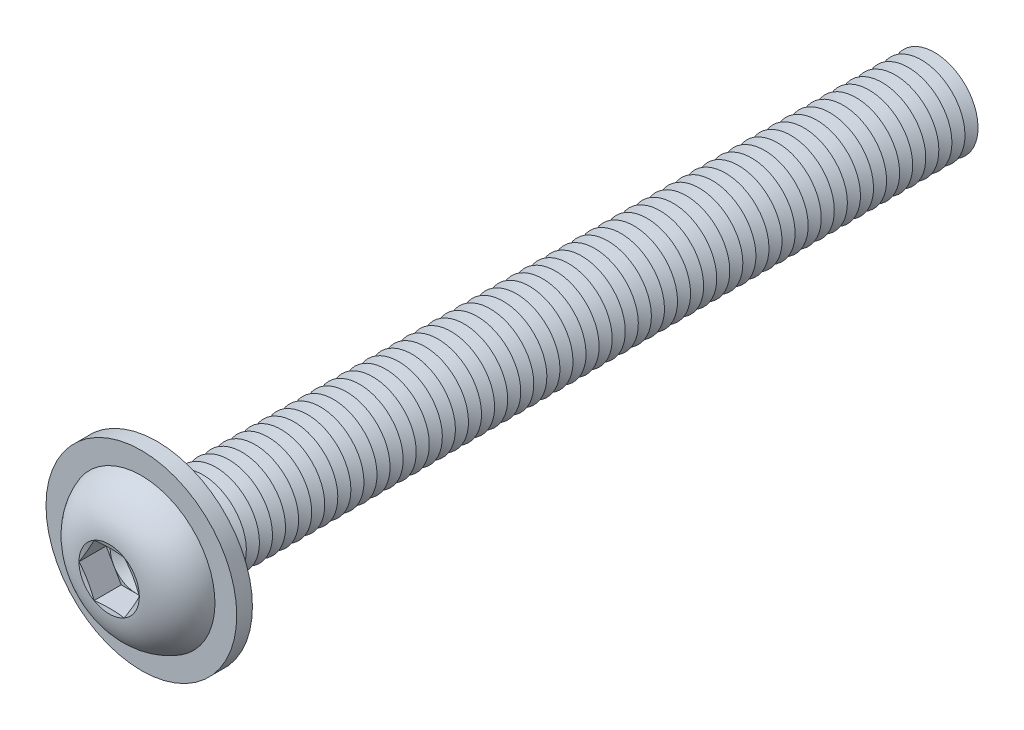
ISO-10303-21;
HEADER;
FILE_DESCRIPTION(('STEP AP214'),'2;1');
FILE_NAME('part.step','',(''),(''),'','','');
FILE_SCHEMA(('AUTOMOTIVE_DESIGN { 1 0 10303 214 1 1 1 1 }'));
ENDSEC;
DATA;
#1=APPLICATION_CONTEXT('core data for automotive mechanical design processes');
#2=APPLICATION_PROTOCOL_DEFINITION('international standard','automotive_design',2000,#1);
#3=PRODUCT_CONTEXT('',#1,'mechanical');
#4=PRODUCT('Part','Part','',(#3));
#5=PRODUCT_RELATED_PRODUCT_CATEGORY('part','',(#4));
#6=PRODUCT_DEFINITION_FORMATION('','',#4);
#7=PRODUCT_DEFINITION_CONTEXT('part definition',#1,'design');
#8=PRODUCT_DEFINITION('design','',#6,#7);
#9=PRODUCT_DEFINITION_SHAPE('','',#8);
#10=(LENGTH_UNIT() NAMED_UNIT(*) SI_UNIT(.MILLI.,.METRE.));
#11=(NAMED_UNIT(*) PLANE_ANGLE_UNIT() SI_UNIT($,.RADIAN.));
#12=(NAMED_UNIT(*) SI_UNIT($,.STERADIAN.) SOLID_ANGLE_UNIT());
#13=UNCERTAINTY_MEASURE_WITH_UNIT(LENGTH_MEASURE(1.E-05),#10,'distance_accuracy_value','');
#14=(GEOMETRIC_REPRESENTATION_CONTEXT(3) GLOBAL_UNCERTAINTY_ASSIGNED_CONTEXT((#13)) GLOBAL_UNIT_ASSIGNED_CONTEXT((#10,
#11,#12)) REPRESENTATION_CONTEXT('',''));
#15=CARTESIAN_POINT('',(0.,0.,0.));
#16=DIRECTION('',(0.,0.,1.));
#17=DIRECTION('',(1.,0.,0.));
#18=AXIS2_PLACEMENT_3D('',#15,#16,#17);
#19=CARTESIAN_POINT('',(0.,0.,-84.75));
#20=DIRECTION('',(0.,0.,1.));
#21=DIRECTION('',(0.,-1.,0.));
#22=AXIS2_PLACEMENT_3D('',#19,#20,#21);
#23=CONICAL_SURFACE('',#22,4.99999999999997,1.0471975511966);
#24=CARTESIAN_POINT('',(0.,0.,-85.5));
#25=DIRECTION('',(0.,0.,1.));
#26=DIRECTION('',(0.,-1.,0.));
#27=AXIS2_PLACEMENT_3D('',#24,#25,#26);
#28=CIRCLE('',#27,3.70096189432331);
#29=CARTESIAN_POINT('',(0.,-3.70096189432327,-85.5));
#30=VERTEX_POINT('',#29);
#31=EDGE_CURVE('E606',#30,#30,#28,.T.);
#32=ORIENTED_EDGE('',*,*,#31,.T.);
#33=EDGE_LOOP('',(#32));
#34=FACE_BOUND('',#33,.T.);
#35=CARTESIAN_POINT('',(0.,0.,-84.75));
#36=DIRECTION('',(0.,0.,1.));
#37=DIRECTION('',(0.,-1.,0.));
#38=AXIS2_PLACEMENT_3D('',#35,#36,#37);
#39=CIRCLE('',#38,4.99999999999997);
#40=CARTESIAN_POINT('',(0.,-4.99999999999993,-84.75));
#41=VERTEX_POINT('',#40);
#42=EDGE_CURVE('E609',#41,#41,#39,.T.);
#43=ORIENTED_EDGE('',*,*,#42,.F.);
#44=EDGE_LOOP('',(#43));
#45=FACE_BOUND('',#44,.T.);
#46=ADVANCED_FACE('F39',(#34,#45),#23,.T.);
#47=CARTESIAN_POINT('',(0.,0.,-85.5));
#48=DIRECTION('',(0.,0.,-1.));
#49=DIRECTION('',(0.,1.,0.));
#50=AXIS2_PLACEMENT_3D('',#47,#48,#49);
#51=CONICAL_SURFACE('',#50,3.70096189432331,1.0471975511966);
#52=CARTESIAN_POINT('',(0.,0.,-86.25));
#53=DIRECTION('',(0.,0.,1.));
#54=DIRECTION('',(0.,-1.,0.));
#55=AXIS2_PLACEMENT_3D('',#52,#53,#54);
#56=CIRCLE('',#55,4.99999999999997);
#57=CARTESIAN_POINT('',(0.,-4.99999999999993,-86.25));
#58=VERTEX_POINT('',#57);
#59=EDGE_CURVE('E602',#58,#58,#56,.T.);
#60=ORIENTED_EDGE('',*,*,#59,.T.);
#61=EDGE_LOOP('',(#60));
#62=FACE_BOUND('',#61,.T.);
#63=ORIENTED_EDGE('',*,*,#31,.F.);
#64=EDGE_LOOP('',(#63));
#65=FACE_BOUND('',#64,.T.);
#66=ADVANCED_FACE('F554',(#62,#65),#51,.T.);
#67=CARTESIAN_POINT('',(0.,4.99999999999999,-90.));
#68=DIRECTION('',(0.,0.,-1.));
#69=DIRECTION('',(0.,1.,0.));
#70=AXIS2_PLACEMENT_3D('',#67,#68,#69);
#71=PLANE('',#70);
#72=CARTESIAN_POINT('',(0.,0.,-90.));
#73=DIRECTION('',(0.,0.,1.));
#74=DIRECTION('',(0.,-1.,0.));
#75=AXIS2_PLACEMENT_3D('',#72,#73,#74);
#76=CIRCLE('',#75,3.70096189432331);
#77=CARTESIAN_POINT('',(0.,-3.70096189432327,-90.));
#78=VERTEX_POINT('',#77);
#79=EDGE_CURVE('E297',#78,#78,#76,.T.);
#80=ORIENTED_EDGE('',*,*,#79,.F.);
#81=EDGE_LOOP('',(#80));
#82=FACE_BOUND('',#81,.T.);
#83=ADVANCED_FACE('F560',(#82),#71,.T.);
#84=CARTESIAN_POINT('',(0.,0.,-89.25));
#85=DIRECTION('',(0.,0.,1.));
#86=DIRECTION('',(0.,-1.,0.));
#87=AXIS2_PLACEMENT_3D('',#84,#85,#86);
#88=CONICAL_SURFACE('',#87,4.99999999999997,1.0471975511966);
#89=ORIENTED_EDGE('',*,*,#79,.T.);
#90=EDGE_LOOP('',(#89));
#91=FACE_BOUND('',#90,.T.);
#92=CARTESIAN_POINT('',(0.,0.,-89.25));
#93=DIRECTION('',(0.,0.,1.));
#94=DIRECTION('',(0.,-1.,0.));
#95=AXIS2_PLACEMENT_3D('',#92,#93,#94);
#96=CIRCLE('',#95,4.99999999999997);
#97=CARTESIAN_POINT('',(0.,-4.99999999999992,-89.25));
#98=VERTEX_POINT('',#97);
#99=EDGE_CURVE('E455',#98,#98,#96,.T.);
#100=ORIENTED_EDGE('',*,*,#99,.F.);
#101=EDGE_LOOP('',(#100));
#102=FACE_BOUND('',#101,.T.);
#103=ADVANCED_FACE('F580',(#91,#102),#88,.T.);
#104=CARTESIAN_POINT('',(0.,0.,-88.5));
#105=DIRECTION('',(0.,0.,-1.));
#106=DIRECTION('',(0.,1.,0.));
#107=AXIS2_PLACEMENT_3D('',#104,#105,#106);
#108=CONICAL_SURFACE('',#107,3.70096189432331,1.0471975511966);
#109=ORIENTED_EDGE('',*,*,#99,.T.);
#110=EDGE_LOOP('',(#109));
#111=FACE_BOUND('',#110,.T.);
#112=CARTESIAN_POINT('',(0.,0.,-88.5));
#113=DIRECTION('',(0.,0.,1.));
#114=DIRECTION('',(0.,-1.,0.));
#115=AXIS2_PLACEMENT_3D('',#112,#113,#114);
#116=CIRCLE('',#115,3.70096189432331);
#117=CARTESIAN_POINT('',(0.,-3.70096189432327,-88.5));
#118=VERTEX_POINT('',#117);
#119=EDGE_CURVE('E360',#118,#118,#116,.T.);
#120=ORIENTED_EDGE('',*,*,#119,.F.);
#121=EDGE_LOOP('',(#120));
#122=FACE_BOUND('',#121,.T.);
#123=ADVANCED_FACE('F577',(#111,#122),#108,.T.);
#124=CARTESIAN_POINT('',(0.,0.,-87.75));
#125=DIRECTION('',(0.,0.,1.));
#126=DIRECTION('',(0.,-1.,0.));
#127=AXIS2_PLACEMENT_3D('',#124,#125,#126);
#128=CONICAL_SURFACE('',#127,4.99999999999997,1.0471975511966);
#129=ORIENTED_EDGE('',*,*,#119,.T.);
#130=EDGE_LOOP('',(#129));
#131=FACE_BOUND('',#130,.T.);
#132=CARTESIAN_POINT('',(0.,0.,-87.75));
#133=DIRECTION('',(0.,0.,1.));
#134=DIRECTION('',(0.,-1.,0.));
#135=AXIS2_PLACEMENT_3D('',#132,#133,#134);
#136=CIRCLE('',#135,4.99999999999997);
#137=CARTESIAN_POINT('',(0.,-4.99999999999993,-87.75));
#138=VERTEX_POINT('',#137);
#139=EDGE_CURVE('E358',#138,#138,#136,.T.);
#140=ORIENTED_EDGE('',*,*,#139,.F.);
#141=EDGE_LOOP('',(#140));
#142=FACE_BOUND('',#141,.T.);
#143=ADVANCED_FACE('F571',(#131,#142),#128,.T.);
#144=CARTESIAN_POINT('',(0.,0.,-87.));
#145=DIRECTION('',(0.,0.,-1.));
#146=DIRECTION('',(0.,1.,0.));
#147=AXIS2_PLACEMENT_3D('',#144,#145,#146);
#148=CONICAL_SURFACE('',#147,3.70096189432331,1.0471975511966);
#149=ORIENTED_EDGE('',*,*,#139,.T.);
#150=EDGE_LOOP('',(#149));
#151=FACE_BOUND('',#150,.T.);
#152=CARTESIAN_POINT('',(0.,0.,-87.));
#153=DIRECTION('',(0.,0.,1.));
#154=DIRECTION('',(0.,-1.,0.));
#155=AXIS2_PLACEMENT_3D('',#152,#153,#154);
#156=CIRCLE('',#155,3.70096189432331);
#157=CARTESIAN_POINT('',(0.,-3.70096189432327,-87.));
#158=VERTEX_POINT('',#157);
#159=EDGE_CURVE('E361',#158,#158,#156,.T.);
#160=ORIENTED_EDGE('',*,*,#159,.F.);
#161=EDGE_LOOP('',(#160));
#162=FACE_BOUND('',#161,.T.);
#163=ADVANCED_FACE('F567',(#151,#162),#148,.T.);
#164=CARTESIAN_POINT('',(0.,0.,-86.25));
#165=DIRECTION('',(0.,0.,1.));
#166=DIRECTION('',(0.,-1.,0.));
#167=AXIS2_PLACEMENT_3D('',#164,#165,#166);
#168=CONICAL_SURFACE('',#167,4.99999999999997,1.0471975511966);
#169=ORIENTED_EDGE('',*,*,#159,.T.);
#170=EDGE_LOOP('',(#169));
#171=FACE_BOUND('',#170,.T.);
#172=ORIENTED_EDGE('',*,*,#59,.F.);
#173=EDGE_LOOP('',(#172));
#174=FACE_BOUND('',#173,.T.);
#175=ADVANCED_FACE('F570',(#171,#174),#168,.T.);
#176=CARTESIAN_POINT('',(0.,0.,-83.25));
#177=DIRECTION('',(0.,0.,1.));
#178=DIRECTION('',(0.,-1.,0.));
#179=AXIS2_PLACEMENT_3D('',#176,#177,#178);
#180=CONICAL_SURFACE('',#179,4.99999999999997,1.0471975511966);
#181=CARTESIAN_POINT('',(0.,0.,-84.));
#182=DIRECTION('',(0.,0.,1.));
#183=DIRECTION('',(0.,-1.,0.));
#184=AXIS2_PLACEMENT_3D('',#181,#182,#183);
#185=CIRCLE('',#184,3.70096189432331);
#186=CARTESIAN_POINT('',(0.,-3.70096189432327,-84.));
#187=VERTEX_POINT('',#186);
#188=EDGE_CURVE('E409',#187,#187,#185,.T.);
#189=ORIENTED_EDGE('',*,*,#188,.T.);
#190=EDGE_LOOP('',(#189));
#191=FACE_BOUND('',#190,.T.);
#192=CARTESIAN_POINT('',(0.,0.,-83.25));
#193=DIRECTION('',(0.,0.,1.));
#194=DIRECTION('',(0.,-1.,0.));
#195=AXIS2_PLACEMENT_3D('',#192,#193,#194);
#196=CIRCLE('',#195,4.99999999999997);
#197=CARTESIAN_POINT('',(0.,-4.99999999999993,-83.25));
#198=VERTEX_POINT('',#197);
#199=EDGE_CURVE('E406',#198,#198,#196,.T.);
#200=ORIENTED_EDGE('',*,*,#199,.F.);
#201=EDGE_LOOP('',(#200));
#202=FACE_BOUND('',#201,.T.);
#203=ADVANCED_FACE('F575',(#191,#202),#180,.T.);
#204=CARTESIAN_POINT('',(0.,0.,-84.));
#205=DIRECTION('',(0.,0.,-1.));
#206=DIRECTION('',(0.,1.,0.));
#207=AXIS2_PLACEMENT_3D('',#204,#205,#206);
#208=CONICAL_SURFACE('',#207,3.70096189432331,1.0471975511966);
#209=ORIENTED_EDGE('',*,*,#42,.T.);
#210=EDGE_LOOP('',(#209));
#211=FACE_BOUND('',#210,.T.);
#212=ORIENTED_EDGE('',*,*,#188,.F.);
#213=EDGE_LOOP('',(#212));
#214=FACE_BOUND('',#213,.T.);
#215=ADVANCED_FACE('F1344',(#211,#214),#208,.T.);
#216=CARTESIAN_POINT('',(0.,0.,-81.75));
#217=DIRECTION('',(0.,0.,1.));
#218=DIRECTION('',(0.,-1.,0.));
#219=AXIS2_PLACEMENT_3D('',#216,#217,#218);
#220=CONICAL_SURFACE('',#219,4.99999999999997,1.0471975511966);
#221=CARTESIAN_POINT('',(0.,0.,-82.5));
#222=DIRECTION('',(0.,0.,1.));
#223=DIRECTION('',(0.,-1.,0.));
#224=AXIS2_PLACEMENT_3D('',#221,#222,#223);
#225=CIRCLE('',#224,3.70096189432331);
#226=CARTESIAN_POINT('',(0.,-3.70096189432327,-82.5));
#227=VERTEX_POINT('',#226);
#228=EDGE_CURVE('E410',#227,#227,#225,.T.);
#229=ORIENTED_EDGE('',*,*,#228,.T.);
#230=EDGE_LOOP('',(#229));
#231=FACE_BOUND('',#230,.T.);
#232=CARTESIAN_POINT('',(0.,0.,-81.75));
#233=DIRECTION('',(0.,0.,1.));
#234=DIRECTION('',(0.,-1.,0.));
#235=AXIS2_PLACEMENT_3D('',#232,#233,#234);
#236=CIRCLE('',#235,4.99999999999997);
#237=CARTESIAN_POINT('',(0.,-4.99999999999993,-81.75));
#238=VERTEX_POINT('',#237);
#239=EDGE_CURVE('E618',#238,#238,#236,.T.);
#240=ORIENTED_EDGE('',*,*,#239,.F.);
#241=EDGE_LOOP('',(#240));
#242=FACE_BOUND('',#241,.T.);
#243=ADVANCED_FACE('F1340',(#231,#242),#220,.T.);
#244=CARTESIAN_POINT('',(0.,0.,-82.5));
#245=DIRECTION('',(0.,0.,-1.));
#246=DIRECTION('',(0.,1.,0.));
#247=AXIS2_PLACEMENT_3D('',#244,#245,#246);
#248=CONICAL_SURFACE('',#247,3.70096189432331,1.0471975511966);
#249=ORIENTED_EDGE('',*,*,#199,.T.);
#250=EDGE_LOOP('',(#249));
#251=FACE_BOUND('',#250,.T.);
#252=ORIENTED_EDGE('',*,*,#228,.F.);
#253=EDGE_LOOP('',(#252));
#254=FACE_BOUND('',#253,.T.);
#255=ADVANCED_FACE('F1336',(#251,#254),#248,.T.);
#256=CARTESIAN_POINT('',(0.,0.,-80.25));
#257=DIRECTION('',(0.,0.,1.));
#258=DIRECTION('',(0.,-1.,0.));
#259=AXIS2_PLACEMENT_3D('',#256,#257,#258);
#260=CONICAL_SURFACE('',#259,4.99999999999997,1.0471975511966);
#261=CARTESIAN_POINT('',(0.,0.,-81.));
#262=DIRECTION('',(0.,0.,1.));
#263=DIRECTION('',(0.,-1.,0.));
#264=AXIS2_PLACEMENT_3D('',#261,#262,#263);
#265=CIRCLE('',#264,3.70096189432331);
#266=CARTESIAN_POINT('',(0.,-3.70096189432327,-81.));
#267=VERTEX_POINT('',#266);
#268=EDGE_CURVE('E451',#267,#267,#265,.T.);
#269=ORIENTED_EDGE('',*,*,#268,.T.);
#270=EDGE_LOOP('',(#269));
#271=FACE_BOUND('',#270,.T.);
#272=CARTESIAN_POINT('',(0.,0.,-80.25));
#273=DIRECTION('',(0.,0.,1.));
#274=DIRECTION('',(0.,-1.,0.));
#275=AXIS2_PLACEMENT_3D('',#272,#273,#274);
#276=CIRCLE('',#275,4.99999999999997);
#277=CARTESIAN_POINT('',(0.,-4.99999999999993,-80.25));
#278=VERTEX_POINT('',#277);
#279=EDGE_CURVE('E355',#278,#278,#276,.T.);
#280=ORIENTED_EDGE('',*,*,#279,.F.);
#281=EDGE_LOOP('',(#280));
#282=FACE_BOUND('',#281,.T.);
#283=ADVANCED_FACE('F1332',(#271,#282),#260,.T.);
#284=CARTESIAN_POINT('',(0.,0.,-81.));
#285=DIRECTION('',(0.,0.,-1.));
#286=DIRECTION('',(0.,1.,0.));
#287=AXIS2_PLACEMENT_3D('',#284,#285,#286);
#288=CONICAL_SURFACE('',#287,3.70096189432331,1.0471975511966);
#289=ORIENTED_EDGE('',*,*,#239,.T.);
#290=EDGE_LOOP('',(#289));
#291=FACE_BOUND('',#290,.T.);
#292=ORIENTED_EDGE('',*,*,#268,.F.);
#293=EDGE_LOOP('',(#292));
#294=FACE_BOUND('',#293,.T.);
#295=ADVANCED_FACE('F1328',(#291,#294),#288,.T.);
#296=CARTESIAN_POINT('',(0.,0.,-78.75));
#297=DIRECTION('',(0.,0.,1.));
#298=DIRECTION('',(0.,-1.,0.));
#299=AXIS2_PLACEMENT_3D('',#296,#297,#298);
#300=CONICAL_SURFACE('',#299,4.99999999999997,1.0471975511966);
#301=CARTESIAN_POINT('',(0.,0.,-79.5));
#302=DIRECTION('',(0.,0.,1.));
#303=DIRECTION('',(0.,-1.,0.));
#304=AXIS2_PLACEMENT_3D('',#301,#302,#303);
#305=CIRCLE('',#304,3.70096189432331);
#306=CARTESIAN_POINT('',(0.,-3.70096189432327,-79.5));
#307=VERTEX_POINT('',#306);
#308=EDGE_CURVE('E352',#307,#307,#305,.T.);
#309=ORIENTED_EDGE('',*,*,#308,.T.);
#310=EDGE_LOOP('',(#309));
#311=FACE_BOUND('',#310,.T.);
#312=CARTESIAN_POINT('',(0.,0.,-78.75));
#313=DIRECTION('',(0.,0.,1.));
#314=DIRECTION('',(0.,-1.,0.));
#315=AXIS2_PLACEMENT_3D('',#312,#313,#314);
#316=CIRCLE('',#315,4.99999999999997);
#317=CARTESIAN_POINT('',(0.,-4.99999999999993,-78.75));
#318=VERTEX_POINT('',#317);
#319=EDGE_CURVE('E356',#318,#318,#316,.T.);
#320=ORIENTED_EDGE('',*,*,#319,.F.);
#321=EDGE_LOOP('',(#320));
#322=FACE_BOUND('',#321,.T.);
#323=ADVANCED_FACE('F1324',(#311,#322),#300,.T.);
#324=CARTESIAN_POINT('',(0.,0.,-79.5));
#325=DIRECTION('',(0.,0.,-1.));
#326=DIRECTION('',(0.,1.,0.));
#327=AXIS2_PLACEMENT_3D('',#324,#325,#326);
#328=CONICAL_SURFACE('',#327,3.70096189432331,1.0471975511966);
#329=ORIENTED_EDGE('',*,*,#279,.T.);
#330=EDGE_LOOP('',(#329));
#331=FACE_BOUND('',#330,.T.);
#332=ORIENTED_EDGE('',*,*,#308,.F.);
#333=EDGE_LOOP('',(#332));
#334=FACE_BOUND('',#333,.T.);
#335=ADVANCED_FACE('F1320',(#331,#334),#328,.T.);
#336=CARTESIAN_POINT('',(0.,0.,-77.25));
#337=DIRECTION('',(0.,0.,1.));
#338=DIRECTION('',(0.,-1.,0.));
#339=AXIS2_PLACEMENT_3D('',#336,#337,#338);
#340=CONICAL_SURFACE('',#339,4.99999999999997,1.0471975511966);
#341=CARTESIAN_POINT('',(0.,0.,-78.));
#342=DIRECTION('',(0.,0.,1.));
#343=DIRECTION('',(0.,-1.,0.));
#344=AXIS2_PLACEMENT_3D('',#341,#342,#343);
#345=CIRCLE('',#344,3.70096189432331);
#346=CARTESIAN_POINT('',(0.,-3.70096189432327,-78.));
#347=VERTEX_POINT('',#346);
#348=EDGE_CURVE('E627',#347,#347,#345,.T.);
#349=ORIENTED_EDGE('',*,*,#348,.T.);
#350=EDGE_LOOP('',(#349));
#351=FACE_BOUND('',#350,.T.);
#352=CARTESIAN_POINT('',(0.,0.,-77.25));
#353=DIRECTION('',(0.,0.,1.));
#354=DIRECTION('',(0.,-1.,0.));
#355=AXIS2_PLACEMENT_3D('',#352,#353,#354);
#356=CIRCLE('',#355,4.99999999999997);
#357=CARTESIAN_POINT('',(0.,-4.99999999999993,-77.25));
#358=VERTEX_POINT('',#357);
#359=EDGE_CURVE('E631',#358,#358,#356,.T.);
#360=ORIENTED_EDGE('',*,*,#359,.F.);
#361=EDGE_LOOP('',(#360));
#362=FACE_BOUND('',#361,.T.);
#363=ADVANCED_FACE('F1316',(#351,#362),#340,.T.);
#364=CARTESIAN_POINT('',(0.,0.,-78.));
#365=DIRECTION('',(0.,0.,-1.));
#366=DIRECTION('',(0.,1.,0.));
#367=AXIS2_PLACEMENT_3D('',#364,#365,#366);
#368=CONICAL_SURFACE('',#367,3.70096189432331,1.0471975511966);
#369=ORIENTED_EDGE('',*,*,#319,.T.);
#370=EDGE_LOOP('',(#369));
#371=FACE_BOUND('',#370,.T.);
#372=ORIENTED_EDGE('',*,*,#348,.F.);
#373=EDGE_LOOP('',(#372));
#374=FACE_BOUND('',#373,.T.);
#375=ADVANCED_FACE('F1312',(#371,#374),#368,.T.);
#376=CARTESIAN_POINT('',(0.,0.,-75.75));
#377=DIRECTION('',(0.,0.,1.));
#378=DIRECTION('',(0.,-1.,0.));
#379=AXIS2_PLACEMENT_3D('',#376,#377,#378);
#380=CONICAL_SURFACE('',#379,4.99999999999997,1.0471975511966);
#381=CARTESIAN_POINT('',(0.,0.,-76.5));
#382=DIRECTION('',(0.,0.,1.));
#383=DIRECTION('',(0.,-1.,0.));
#384=AXIS2_PLACEMENT_3D('',#381,#382,#383);
#385=CIRCLE('',#384,3.70096189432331);
#386=CARTESIAN_POINT('',(0.,-3.70096189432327,-76.5));
#387=VERTEX_POINT('',#386);
#388=EDGE_CURVE('E403',#387,#387,#385,.T.);
#389=ORIENTED_EDGE('',*,*,#388,.T.);
#390=EDGE_LOOP('',(#389));
#391=FACE_BOUND('',#390,.T.);
#392=CARTESIAN_POINT('',(0.,0.,-75.75));
#393=DIRECTION('',(0.,0.,1.));
#394=DIRECTION('',(0.,-1.,0.));
#395=AXIS2_PLACEMENT_3D('',#392,#393,#394);
#396=CIRCLE('',#395,4.99999999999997);
#397=CARTESIAN_POINT('',(0.,-4.99999999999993,-75.75));
#398=VERTEX_POINT('',#397);
#399=EDGE_CURVE('E400',#398,#398,#396,.T.);
#400=ORIENTED_EDGE('',*,*,#399,.F.);
#401=EDGE_LOOP('',(#400));
#402=FACE_BOUND('',#401,.T.);
#403=ADVANCED_FACE('F1308',(#391,#402),#380,.T.);
#404=CARTESIAN_POINT('',(0.,0.,-76.5));
#405=DIRECTION('',(0.,0.,-1.));
#406=DIRECTION('',(0.,1.,0.));
#407=AXIS2_PLACEMENT_3D('',#404,#405,#406);
#408=CONICAL_SURFACE('',#407,3.70096189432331,1.0471975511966);
#409=ORIENTED_EDGE('',*,*,#359,.T.);
#410=EDGE_LOOP('',(#409));
#411=FACE_BOUND('',#410,.T.);
#412=ORIENTED_EDGE('',*,*,#388,.F.);
#413=EDGE_LOOP('',(#412));
#414=FACE_BOUND('',#413,.T.);
#415=ADVANCED_FACE('F1304',(#411,#414),#408,.T.);
#416=CARTESIAN_POINT('',(0.,0.,-74.25));
#417=DIRECTION('',(0.,0.,1.));
#418=DIRECTION('',(0.,-1.,0.));
#419=AXIS2_PLACEMENT_3D('',#416,#417,#418);
#420=CONICAL_SURFACE('',#419,4.99999999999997,1.0471975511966);
#421=CARTESIAN_POINT('',(0.,0.,-75.));
#422=DIRECTION('',(0.,0.,1.));
#423=DIRECTION('',(0.,-1.,0.));
#424=AXIS2_PLACEMENT_3D('',#421,#422,#423);
#425=CIRCLE('',#424,3.70096189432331);
#426=CARTESIAN_POINT('',(0.,-3.70096189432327,-75.));
#427=VERTEX_POINT('',#426);
#428=EDGE_CURVE('E404',#427,#427,#425,.T.);
#429=ORIENTED_EDGE('',*,*,#428,.T.);
#430=EDGE_LOOP('',(#429));
#431=FACE_BOUND('',#430,.T.);
#432=CARTESIAN_POINT('',(0.,0.,-74.25));
#433=DIRECTION('',(0.,0.,1.));
#434=DIRECTION('',(0.,-1.,0.));
#435=AXIS2_PLACEMENT_3D('',#432,#433,#434);
#436=CIRCLE('',#435,4.99999999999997);
#437=CARTESIAN_POINT('',(0.,-4.99999999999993,-74.25));
#438=VERTEX_POINT('',#437);
#439=EDGE_CURVE('E640',#438,#438,#436,.T.);
#440=ORIENTED_EDGE('',*,*,#439,.F.);
#441=EDGE_LOOP('',(#440));
#442=FACE_BOUND('',#441,.T.);
#443=ADVANCED_FACE('F1300',(#431,#442),#420,.T.);
#444=CARTESIAN_POINT('',(0.,0.,-75.));
#445=DIRECTION('',(0.,0.,-1.));
#446=DIRECTION('',(0.,1.,0.));
#447=AXIS2_PLACEMENT_3D('',#444,#445,#446);
#448=CONICAL_SURFACE('',#447,3.70096189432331,1.0471975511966);
#449=ORIENTED_EDGE('',*,*,#399,.T.);
#450=EDGE_LOOP('',(#449));
#451=FACE_BOUND('',#450,.T.);
#452=ORIENTED_EDGE('',*,*,#428,.F.);
#453=EDGE_LOOP('',(#452));
#454=FACE_BOUND('',#453,.T.);
#455=ADVANCED_FACE('F1296',(#451,#454),#448,.T.);
#456=CARTESIAN_POINT('',(0.,0.,-72.75));
#457=DIRECTION('',(0.,0.,1.));
#458=DIRECTION('',(0.,-1.,0.));
#459=AXIS2_PLACEMENT_3D('',#456,#457,#458);
#460=CONICAL_SURFACE('',#459,4.99999999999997,1.0471975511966);
#461=CARTESIAN_POINT('',(0.,0.,-73.5));
#462=DIRECTION('',(0.,0.,1.));
#463=DIRECTION('',(0.,-1.,0.));
#464=AXIS2_PLACEMENT_3D('',#461,#462,#463);
#465=CIRCLE('',#464,3.70096189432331);
#466=CARTESIAN_POINT('',(0.,-3.70096189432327,-73.5));
#467=VERTEX_POINT('',#466);
#468=EDGE_CURVE('E644',#467,#467,#465,.T.);
#469=ORIENTED_EDGE('',*,*,#468,.T.);
#470=EDGE_LOOP('',(#469));
#471=FACE_BOUND('',#470,.T.);
#472=CARTESIAN_POINT('',(0.,0.,-72.75));
#473=DIRECTION('',(0.,0.,1.));
#474=DIRECTION('',(0.,-1.,0.));
#475=AXIS2_PLACEMENT_3D('',#472,#473,#474);
#476=CIRCLE('',#475,4.99999999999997);
#477=CARTESIAN_POINT('',(0.,-4.99999999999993,-72.75));
#478=VERTEX_POINT('',#477);
#479=EDGE_CURVE('E648',#478,#478,#476,.T.);
#480=ORIENTED_EDGE('',*,*,#479,.F.);
#481=EDGE_LOOP('',(#480));
#482=FACE_BOUND('',#481,.T.);
#483=ADVANCED_FACE('F1292',(#471,#482),#460,.T.);
#484=CARTESIAN_POINT('',(0.,0.,-73.5));
#485=DIRECTION('',(0.,0.,-1.));
#486=DIRECTION('',(0.,1.,0.));
#487=AXIS2_PLACEMENT_3D('',#484,#485,#486);
#488=CONICAL_SURFACE('',#487,3.70096189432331,1.0471975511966);
#489=ORIENTED_EDGE('',*,*,#439,.T.);
#490=EDGE_LOOP('',(#489));
#491=FACE_BOUND('',#490,.T.);
#492=ORIENTED_EDGE('',*,*,#468,.F.);
#493=EDGE_LOOP('',(#492));
#494=FACE_BOUND('',#493,.T.);
#495=ADVANCED_FACE('F1288',(#491,#494),#488,.T.);
#496=CARTESIAN_POINT('',(0.,0.,-71.25));
#497=DIRECTION('',(0.,0.,1.));
#498=DIRECTION('',(0.,-1.,0.));
#499=AXIS2_PLACEMENT_3D('',#496,#497,#498);
#500=CONICAL_SURFACE('',#499,4.99999999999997,1.0471975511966);
#501=CARTESIAN_POINT('',(0.,0.,-72.));
#502=DIRECTION('',(0.,0.,1.));
#503=DIRECTION('',(0.,-1.,0.));
#504=AXIS2_PLACEMENT_3D('',#501,#502,#503);
#505=CIRCLE('',#504,3.70096189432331);
#506=CARTESIAN_POINT('',(0.,-3.70096189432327,-72.));
#507=VERTEX_POINT('',#506);
#508=EDGE_CURVE('E324',#507,#507,#505,.T.);
#509=ORIENTED_EDGE('',*,*,#508,.T.);
#510=EDGE_LOOP('',(#509));
#511=FACE_BOUND('',#510,.T.);
#512=CARTESIAN_POINT('',(0.,0.,-71.25));
#513=DIRECTION('',(0.,0.,1.));
#514=DIRECTION('',(0.,-1.,0.));
#515=AXIS2_PLACEMENT_3D('',#512,#513,#514);
#516=CIRCLE('',#515,4.99999999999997);
#517=CARTESIAN_POINT('',(0.,-4.99999999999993,-71.25));
#518=VERTEX_POINT('',#517);
#519=EDGE_CURVE('E528',#518,#518,#516,.T.);
#520=ORIENTED_EDGE('',*,*,#519,.F.);
#521=EDGE_LOOP('',(#520));
#522=FACE_BOUND('',#521,.T.);
#523=ADVANCED_FACE('F1284',(#511,#522),#500,.T.);
#524=CARTESIAN_POINT('',(0.,0.,-72.));
#525=DIRECTION('',(0.,0.,-1.));
#526=DIRECTION('',(0.,1.,0.));
#527=AXIS2_PLACEMENT_3D('',#524,#525,#526);
#528=CONICAL_SURFACE('',#527,3.70096189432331,1.0471975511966);
#529=ORIENTED_EDGE('',*,*,#479,.T.);
#530=EDGE_LOOP('',(#529));
#531=FACE_BOUND('',#530,.T.);
#532=ORIENTED_EDGE('',*,*,#508,.F.);
#533=EDGE_LOOP('',(#532));
#534=FACE_BOUND('',#533,.T.);
#535=ADVANCED_FACE('F1280',(#531,#534),#528,.T.);
#536=CARTESIAN_POINT('',(0.,0.,-69.75));
#537=DIRECTION('',(0.,0.,1.));
#538=DIRECTION('',(0.,-1.,0.));
#539=AXIS2_PLACEMENT_3D('',#536,#537,#538);
#540=CONICAL_SURFACE('',#539,4.99999999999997,1.0471975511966);
#541=CARTESIAN_POINT('',(0.,0.,-70.5));
#542=DIRECTION('',(0.,0.,1.));
#543=DIRECTION('',(0.,-1.,0.));
#544=AXIS2_PLACEMENT_3D('',#541,#542,#543);
#545=CIRCLE('',#544,3.70096189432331);
#546=CARTESIAN_POINT('',(0.,-3.70096189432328,-70.5));
#547=VERTEX_POINT('',#546);
#548=EDGE_CURVE('E526',#547,#547,#545,.T.);
#549=ORIENTED_EDGE('',*,*,#548,.T.);
#550=EDGE_LOOP('',(#549));
#551=FACE_BOUND('',#550,.T.);
#552=CARTESIAN_POINT('',(0.,0.,-69.75));
#553=DIRECTION('',(0.,0.,1.));
#554=DIRECTION('',(0.,-1.,0.));
#555=AXIS2_PLACEMENT_3D('',#552,#553,#554);
#556=CIRCLE('',#555,4.99999999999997);
#557=CARTESIAN_POINT('',(0.,-4.99999999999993,-69.75));
#558=VERTEX_POINT('',#557);
#559=EDGE_CURVE('E349',#558,#558,#556,.T.);
#560=ORIENTED_EDGE('',*,*,#559,.F.);
#561=EDGE_LOOP('',(#560));
#562=FACE_BOUND('',#561,.T.);
#563=ADVANCED_FACE('F1276',(#551,#562),#540,.T.);
#564=CARTESIAN_POINT('',(0.,0.,-70.5));
#565=DIRECTION('',(0.,0.,-1.));
#566=DIRECTION('',(0.,1.,0.));
#567=AXIS2_PLACEMENT_3D('',#564,#565,#566);
#568=CONICAL_SURFACE('',#567,3.70096189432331,1.0471975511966);
#569=ORIENTED_EDGE('',*,*,#519,.T.);
#570=EDGE_LOOP('',(#569));
#571=FACE_BOUND('',#570,.T.);
#572=ORIENTED_EDGE('',*,*,#548,.F.);
#573=EDGE_LOOP('',(#572));
#574=FACE_BOUND('',#573,.T.);
#575=ADVANCED_FACE('F1272',(#571,#574),#568,.T.);
#576=CARTESIAN_POINT('',(0.,0.,-68.25));
#577=DIRECTION('',(0.,0.,1.));
#578=DIRECTION('',(0.,-1.,0.));
#579=AXIS2_PLACEMENT_3D('',#576,#577,#578);
#580=CONICAL_SURFACE('',#579,4.99999999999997,1.0471975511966);
#581=CARTESIAN_POINT('',(0.,0.,-69.));
#582=DIRECTION('',(0.,0.,1.));
#583=DIRECTION('',(0.,-1.,0.));
#584=AXIS2_PLACEMENT_3D('',#581,#582,#583);
#585=CIRCLE('',#584,3.70096189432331);
#586=CARTESIAN_POINT('',(0.,-3.70096189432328,-69.));
#587=VERTEX_POINT('',#586);
#588=EDGE_CURVE('E346',#587,#587,#585,.T.);
#589=ORIENTED_EDGE('',*,*,#588,.T.);
#590=EDGE_LOOP('',(#589));
#591=FACE_BOUND('',#590,.T.);
#592=CARTESIAN_POINT('',(0.,0.,-68.25));
#593=DIRECTION('',(0.,0.,1.));
#594=DIRECTION('',(0.,-1.,0.));
#595=AXIS2_PLACEMENT_3D('',#592,#593,#594);
#596=CIRCLE('',#595,4.99999999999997);
#597=CARTESIAN_POINT('',(0.,-4.99999999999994,-68.25));
#598=VERTEX_POINT('',#597);
#599=EDGE_CURVE('E350',#598,#598,#596,.T.);
#600=ORIENTED_EDGE('',*,*,#599,.F.);
#601=EDGE_LOOP('',(#600));
#602=FACE_BOUND('',#601,.T.);
#603=ADVANCED_FACE('F1268',(#591,#602),#580,.T.);
#604=CARTESIAN_POINT('',(0.,0.,-69.));
#605=DIRECTION('',(0.,0.,-1.));
#606=DIRECTION('',(0.,1.,0.));
#607=AXIS2_PLACEMENT_3D('',#604,#605,#606);
#608=CONICAL_SURFACE('',#607,3.70096189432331,1.0471975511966);
#609=ORIENTED_EDGE('',*,*,#559,.T.);
#610=EDGE_LOOP('',(#609));
#611=FACE_BOUND('',#610,.T.);
#612=ORIENTED_EDGE('',*,*,#588,.F.);
#613=EDGE_LOOP('',(#612));
#614=FACE_BOUND('',#613,.T.);
#615=ADVANCED_FACE('F1264',(#611,#614),#608,.T.);
#616=CARTESIAN_POINT('',(0.,0.,-66.75));
#617=DIRECTION('',(0.,0.,1.));
#618=DIRECTION('',(0.,-1.,0.));
#619=AXIS2_PLACEMENT_3D('',#616,#617,#618);
#620=CONICAL_SURFACE('',#619,4.99999999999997,1.0471975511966);
#621=CARTESIAN_POINT('',(0.,0.,-67.5));
#622=DIRECTION('',(0.,0.,1.));
#623=DIRECTION('',(0.,-1.,0.));
#624=AXIS2_PLACEMENT_3D('',#621,#622,#623);
#625=CIRCLE('',#624,3.70096189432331);
#626=CARTESIAN_POINT('',(0.,-3.70096189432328,-67.5));
#627=VERTEX_POINT('',#626);
#628=EDGE_CURVE('E663',#627,#627,#625,.T.);
#629=ORIENTED_EDGE('',*,*,#628,.T.);
#630=EDGE_LOOP('',(#629));
#631=FACE_BOUND('',#630,.T.);
#632=CARTESIAN_POINT('',(0.,0.,-66.75));
#633=DIRECTION('',(0.,0.,1.));
#634=DIRECTION('',(0.,-1.,0.));
#635=AXIS2_PLACEMENT_3D('',#632,#633,#634);
#636=CIRCLE('',#635,4.99999999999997);
#637=CARTESIAN_POINT('',(0.,-4.99999999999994,-66.75));
#638=VERTEX_POINT('',#637);
#639=EDGE_CURVE('E667',#638,#638,#636,.T.);
#640=ORIENTED_EDGE('',*,*,#639,.F.);
#641=EDGE_LOOP('',(#640));
#642=FACE_BOUND('',#641,.T.);
#643=ADVANCED_FACE('F1260',(#631,#642),#620,.T.);
#644=CARTESIAN_POINT('',(0.,0.,-67.5));
#645=DIRECTION('',(0.,0.,-1.));
#646=DIRECTION('',(0.,1.,0.));
#647=AXIS2_PLACEMENT_3D('',#644,#645,#646);
#648=CONICAL_SURFACE('',#647,3.70096189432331,1.0471975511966);
#649=ORIENTED_EDGE('',*,*,#599,.T.);
#650=EDGE_LOOP('',(#649));
#651=FACE_BOUND('',#650,.T.);
#652=ORIENTED_EDGE('',*,*,#628,.F.);
#653=EDGE_LOOP('',(#652));
#654=FACE_BOUND('',#653,.T.);
#655=ADVANCED_FACE('F1256',(#651,#654),#648,.T.);
#656=CARTESIAN_POINT('',(0.,0.,-65.25));
#657=DIRECTION('',(0.,0.,1.));
#658=DIRECTION('',(0.,-1.,0.));
#659=AXIS2_PLACEMENT_3D('',#656,#657,#658);
#660=CONICAL_SURFACE('',#659,4.99999999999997,1.0471975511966);
#661=CARTESIAN_POINT('',(0.,0.,-66.));
#662=DIRECTION('',(0.,0.,1.));
#663=DIRECTION('',(0.,-1.,0.));
#664=AXIS2_PLACEMENT_3D('',#661,#662,#663);
#665=CIRCLE('',#664,3.70096189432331);
#666=CARTESIAN_POINT('',(0.,-3.70096189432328,-66.));
#667=VERTEX_POINT('',#666);
#668=EDGE_CURVE('E671',#667,#667,#665,.T.);
#669=ORIENTED_EDGE('',*,*,#668,.T.);
#670=EDGE_LOOP('',(#669));
#671=FACE_BOUND('',#670,.T.);
#672=CARTESIAN_POINT('',(0.,0.,-65.25));
#673=DIRECTION('',(0.,0.,1.));
#674=DIRECTION('',(0.,-1.,0.));
#675=AXIS2_PLACEMENT_3D('',#672,#673,#674);
#676=CIRCLE('',#675,4.99999999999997);
#677=CARTESIAN_POINT('',(0.,-4.99999999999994,-65.25));
#678=VERTEX_POINT('',#677);
#679=EDGE_CURVE('E675',#678,#678,#676,.T.);
#680=ORIENTED_EDGE('',*,*,#679,.F.);
#681=EDGE_LOOP('',(#680));
#682=FACE_BOUND('',#681,.T.);
#683=ADVANCED_FACE('F1252',(#671,#682),#660,.T.);
#684=CARTESIAN_POINT('',(0.,0.,-66.));
#685=DIRECTION('',(0.,0.,-1.));
#686=DIRECTION('',(0.,1.,0.));
#687=AXIS2_PLACEMENT_3D('',#684,#685,#686);
#688=CONICAL_SURFACE('',#687,3.70096189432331,1.0471975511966);
#689=ORIENTED_EDGE('',*,*,#639,.T.);
#690=EDGE_LOOP('',(#689));
#691=FACE_BOUND('',#690,.T.);
#692=ORIENTED_EDGE('',*,*,#668,.F.);
#693=EDGE_LOOP('',(#692));
#694=FACE_BOUND('',#693,.T.);
#695=ADVANCED_FACE('F1248',(#691,#694),#688,.T.);
#696=CARTESIAN_POINT('',(0.,0.,-63.75));
#697=DIRECTION('',(0.,0.,1.));
#698=DIRECTION('',(0.,-1.,0.));
#699=AXIS2_PLACEMENT_3D('',#696,#697,#698);
#700=CONICAL_SURFACE('',#699,4.99999999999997,1.0471975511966);
#701=CARTESIAN_POINT('',(0.,0.,-64.5));
#702=DIRECTION('',(0.,0.,1.));
#703=DIRECTION('',(0.,-1.,0.));
#704=AXIS2_PLACEMENT_3D('',#701,#702,#703);
#705=CIRCLE('',#704,3.70096189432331);
#706=CARTESIAN_POINT('',(0.,-3.70096189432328,-64.5));
#707=VERTEX_POINT('',#706);
#708=EDGE_CURVE('E679',#707,#707,#705,.T.);
#709=ORIENTED_EDGE('',*,*,#708,.T.);
#710=EDGE_LOOP('',(#709));
#711=FACE_BOUND('',#710,.T.);
#712=CARTESIAN_POINT('',(0.,0.,-63.75));
#713=DIRECTION('',(0.,0.,1.));
#714=DIRECTION('',(0.,-1.,0.));
#715=AXIS2_PLACEMENT_3D('',#712,#713,#714);
#716=CIRCLE('',#715,4.99999999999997);
#717=CARTESIAN_POINT('',(0.,-4.99999999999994,-63.75));
#718=VERTEX_POINT('',#717);
#719=EDGE_CURVE('E683',#718,#718,#716,.T.);
#720=ORIENTED_EDGE('',*,*,#719,.F.);
#721=EDGE_LOOP('',(#720));
#722=FACE_BOUND('',#721,.T.);
#723=ADVANCED_FACE('F1244',(#711,#722),#700,.T.);
#724=CARTESIAN_POINT('',(0.,0.,-64.5));
#725=DIRECTION('',(0.,0.,-1.));
#726=DIRECTION('',(0.,1.,0.));
#727=AXIS2_PLACEMENT_3D('',#724,#725,#726);
#728=CONICAL_SURFACE('',#727,3.70096189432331,1.0471975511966);
#729=ORIENTED_EDGE('',*,*,#679,.T.);
#730=EDGE_LOOP('',(#729));
#731=FACE_BOUND('',#730,.T.);
#732=ORIENTED_EDGE('',*,*,#708,.F.);
#733=EDGE_LOOP('',(#732));
#734=FACE_BOUND('',#733,.T.);
#735=ADVANCED_FACE('F1240',(#731,#734),#728,.T.);
#736=CARTESIAN_POINT('',(0.,0.,-62.25));
#737=DIRECTION('',(0.,0.,1.));
#738=DIRECTION('',(0.,-1.,0.));
#739=AXIS2_PLACEMENT_3D('',#736,#737,#738);
#740=CONICAL_SURFACE('',#739,4.99999999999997,1.0471975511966);
#741=CARTESIAN_POINT('',(0.,0.,-63.));
#742=DIRECTION('',(0.,0.,1.));
#743=DIRECTION('',(0.,-1.,0.));
#744=AXIS2_PLACEMENT_3D('',#741,#742,#743);
#745=CIRCLE('',#744,3.70096189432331);
#746=CARTESIAN_POINT('',(0.,-3.70096189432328,-63.));
#747=VERTEX_POINT('',#746);
#748=EDGE_CURVE('E687',#747,#747,#745,.T.);
#749=ORIENTED_EDGE('',*,*,#748,.T.);
#750=EDGE_LOOP('',(#749));
#751=FACE_BOUND('',#750,.T.);
#752=CARTESIAN_POINT('',(0.,0.,-62.25));
#753=DIRECTION('',(0.,0.,1.));
#754=DIRECTION('',(0.,-1.,0.));
#755=AXIS2_PLACEMENT_3D('',#752,#753,#754);
#756=CIRCLE('',#755,4.99999999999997);
#757=CARTESIAN_POINT('',(0.,-4.99999999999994,-62.25));
#758=VERTEX_POINT('',#757);
#759=EDGE_CURVE('E691',#758,#758,#756,.T.);
#760=ORIENTED_EDGE('',*,*,#759,.F.);
#761=EDGE_LOOP('',(#760));
#762=FACE_BOUND('',#761,.T.);
#763=ADVANCED_FACE('F1236',(#751,#762),#740,.T.);
#764=CARTESIAN_POINT('',(0.,0.,-63.));
#765=DIRECTION('',(0.,0.,-1.));
#766=DIRECTION('',(0.,1.,0.));
#767=AXIS2_PLACEMENT_3D('',#764,#765,#766);
#768=CONICAL_SURFACE('',#767,3.70096189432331,1.0471975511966);
#769=ORIENTED_EDGE('',*,*,#719,.T.);
#770=EDGE_LOOP('',(#769));
#771=FACE_BOUND('',#770,.T.);
#772=ORIENTED_EDGE('',*,*,#748,.F.);
#773=EDGE_LOOP('',(#772));
#774=FACE_BOUND('',#773,.T.);
#775=ADVANCED_FACE('F1232',(#771,#774),#768,.T.);
#776=CARTESIAN_POINT('',(0.,0.,-60.75));
#777=DIRECTION('',(0.,0.,1.));
#778=DIRECTION('',(0.,-1.,0.));
#779=AXIS2_PLACEMENT_3D('',#776,#777,#778);
#780=CONICAL_SURFACE('',#779,4.99999999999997,1.0471975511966);
#781=CARTESIAN_POINT('',(0.,0.,-61.5));
#782=DIRECTION('',(0.,0.,1.));
#783=DIRECTION('',(0.,-1.,0.));
#784=AXIS2_PLACEMENT_3D('',#781,#782,#783);
#785=CIRCLE('',#784,3.70096189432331);
#786=CARTESIAN_POINT('',(0.,-3.70096189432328,-61.5));
#787=VERTEX_POINT('',#786);
#788=EDGE_CURVE('E695',#787,#787,#785,.T.);
#789=ORIENTED_EDGE('',*,*,#788,.T.);
#790=EDGE_LOOP('',(#789));
#791=FACE_BOUND('',#790,.T.);
#792=CARTESIAN_POINT('',(0.,0.,-60.75));
#793=DIRECTION('',(0.,0.,1.));
#794=DIRECTION('',(0.,-1.,0.));
#795=AXIS2_PLACEMENT_3D('',#792,#793,#794);
#796=CIRCLE('',#795,4.99999999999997);
#797=CARTESIAN_POINT('',(0.,-4.99999999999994,-60.75));
#798=VERTEX_POINT('',#797);
#799=EDGE_CURVE('E698',#798,#798,#796,.T.);
#800=ORIENTED_EDGE('',*,*,#799,.F.);
#801=EDGE_LOOP('',(#800));
#802=FACE_BOUND('',#801,.T.);
#803=ADVANCED_FACE('F1228',(#791,#802),#780,.T.);
#804=CARTESIAN_POINT('',(0.,0.,-61.5));
#805=DIRECTION('',(0.,0.,-1.));
#806=DIRECTION('',(0.,1.,0.));
#807=AXIS2_PLACEMENT_3D('',#804,#805,#806);
#808=CONICAL_SURFACE('',#807,3.70096189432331,1.0471975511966);
#809=ORIENTED_EDGE('',*,*,#759,.T.);
#810=EDGE_LOOP('',(#809));
#811=FACE_BOUND('',#810,.T.);
#812=ORIENTED_EDGE('',*,*,#788,.F.);
#813=EDGE_LOOP('',(#812));
#814=FACE_BOUND('',#813,.T.);
#815=ADVANCED_FACE('F1224',(#811,#814),#808,.T.);
#816=CARTESIAN_POINT('',(0.,0.,-59.25));
#817=DIRECTION('',(0.,0.,1.));
#818=DIRECTION('',(0.,-1.,0.));
#819=AXIS2_PLACEMENT_3D('',#816,#817,#818);
#820=CONICAL_SURFACE('',#819,4.99999999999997,1.0471975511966);
#821=CARTESIAN_POINT('',(0.,0.,-60.));
#822=DIRECTION('',(0.,0.,1.));
#823=DIRECTION('',(0.,-1.,0.));
#824=AXIS2_PLACEMENT_3D('',#821,#822,#823);
#825=CIRCLE('',#824,3.70096189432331);
#826=CARTESIAN_POINT('',(0.,-3.70096189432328,-60.));
#827=VERTEX_POINT('',#826);
#828=EDGE_CURVE('E397',#827,#827,#825,.T.);
#829=ORIENTED_EDGE('',*,*,#828,.T.);
#830=EDGE_LOOP('',(#829));
#831=FACE_BOUND('',#830,.T.);
#832=CARTESIAN_POINT('',(0.,0.,-59.25));
#833=DIRECTION('',(0.,0.,1.));
#834=DIRECTION('',(0.,-1.,0.));
#835=AXIS2_PLACEMENT_3D('',#832,#833,#834);
#836=CIRCLE('',#835,4.99999999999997);
#837=CARTESIAN_POINT('',(0.,-4.99999999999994,-59.25));
#838=VERTEX_POINT('',#837);
#839=EDGE_CURVE('E394',#838,#838,#836,.T.);
#840=ORIENTED_EDGE('',*,*,#839,.F.);
#841=EDGE_LOOP('',(#840));
#842=FACE_BOUND('',#841,.T.);
#843=ADVANCED_FACE('F1220',(#831,#842),#820,.T.);
#844=CARTESIAN_POINT('',(0.,0.,-60.));
#845=DIRECTION('',(0.,0.,-1.));
#846=DIRECTION('',(0.,1.,0.));
#847=AXIS2_PLACEMENT_3D('',#844,#845,#846);
#848=CONICAL_SURFACE('',#847,3.70096189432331,1.0471975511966);
#849=ORIENTED_EDGE('',*,*,#799,.T.);
#850=EDGE_LOOP('',(#849));
#851=FACE_BOUND('',#850,.T.);
#852=ORIENTED_EDGE('',*,*,#828,.F.);
#853=EDGE_LOOP('',(#852));
#854=FACE_BOUND('',#853,.T.);
#855=ADVANCED_FACE('F1216',(#851,#854),#848,.T.);
#856=CARTESIAN_POINT('',(0.,0.,-57.75));
#857=DIRECTION('',(0.,0.,1.));
#858=DIRECTION('',(0.,-1.,0.));
#859=AXIS2_PLACEMENT_3D('',#856,#857,#858);
#860=CONICAL_SURFACE('',#859,4.99999999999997,1.0471975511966);
#861=CARTESIAN_POINT('',(0.,0.,-58.5));
#862=DIRECTION('',(0.,0.,1.));
#863=DIRECTION('',(0.,-1.,0.));
#864=AXIS2_PLACEMENT_3D('',#861,#862,#863);
#865=CIRCLE('',#864,3.70096189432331);
#866=CARTESIAN_POINT('',(0.,-3.70096189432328,-58.5));
#867=VERTEX_POINT('',#866);
#868=EDGE_CURVE('E398',#867,#867,#865,.T.);
#869=ORIENTED_EDGE('',*,*,#868,.T.);
#870=EDGE_LOOP('',(#869));
#871=FACE_BOUND('',#870,.T.);
#872=CARTESIAN_POINT('',(0.,0.,-57.75));
#873=DIRECTION('',(0.,0.,1.));
#874=DIRECTION('',(0.,-1.,0.));
#875=AXIS2_PLACEMENT_3D('',#872,#873,#874);
#876=CIRCLE('',#875,4.99999999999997);
#877=CARTESIAN_POINT('',(0.,-4.99999999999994,-57.75));
#878=VERTEX_POINT('',#877);
#879=EDGE_CURVE('E447',#878,#878,#876,.T.);
#880=ORIENTED_EDGE('',*,*,#879,.F.);
#881=EDGE_LOOP('',(#880));
#882=FACE_BOUND('',#881,.T.);
#883=ADVANCED_FACE('F1212',(#871,#882),#860,.T.);
#884=CARTESIAN_POINT('',(0.,0.,-58.5));
#885=DIRECTION('',(0.,0.,-1.));
#886=DIRECTION('',(0.,1.,0.));
#887=AXIS2_PLACEMENT_3D('',#884,#885,#886);
#888=CONICAL_SURFACE('',#887,3.70096189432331,1.0471975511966);
#889=ORIENTED_EDGE('',*,*,#839,.T.);
#890=EDGE_LOOP('',(#889));
#891=FACE_BOUND('',#890,.T.);
#892=ORIENTED_EDGE('',*,*,#868,.F.);
#893=EDGE_LOOP('',(#892));
#894=FACE_BOUND('',#893,.T.);
#895=ADVANCED_FACE('F1208',(#891,#894),#888,.T.);
#896=CARTESIAN_POINT('',(0.,0.,-56.25));
#897=DIRECTION('',(0.,0.,1.));
#898=DIRECTION('',(0.,-1.,0.));
#899=AXIS2_PLACEMENT_3D('',#896,#897,#898);
#900=CONICAL_SURFACE('',#899,4.99999999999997,1.0471975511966);
#901=CARTESIAN_POINT('',(0.,0.,-57.));
#902=DIRECTION('',(0.,0.,1.));
#903=DIRECTION('',(0.,-1.,0.));
#904=AXIS2_PLACEMENT_3D('',#901,#902,#903);
#905=CIRCLE('',#904,3.70096189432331);
#906=CARTESIAN_POINT('',(0.,-3.70096189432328,-57.));
#907=VERTEX_POINT('',#906);
#908=EDGE_CURVE('E708',#907,#907,#905,.T.);
#909=ORIENTED_EDGE('',*,*,#908,.T.);
#910=EDGE_LOOP('',(#909));
#911=FACE_BOUND('',#910,.T.);
#912=CARTESIAN_POINT('',(0.,0.,-56.25));
#913=DIRECTION('',(0.,0.,1.));
#914=DIRECTION('',(0.,-1.,0.));
#915=AXIS2_PLACEMENT_3D('',#912,#913,#914);
#916=CIRCLE('',#915,4.99999999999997);
#917=CARTESIAN_POINT('',(0.,-4.99999999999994,-56.25));
#918=VERTEX_POINT('',#917);
#919=EDGE_CURVE('E712',#918,#918,#916,.T.);
#920=ORIENTED_EDGE('',*,*,#919,.F.);
#921=EDGE_LOOP('',(#920));
#922=FACE_BOUND('',#921,.T.);
#923=ADVANCED_FACE('F1204',(#911,#922),#900,.T.);
#924=CARTESIAN_POINT('',(0.,0.,-57.));
#925=DIRECTION('',(0.,0.,-1.));
#926=DIRECTION('',(0.,1.,0.));
#927=AXIS2_PLACEMENT_3D('',#924,#925,#926);
#928=CONICAL_SURFACE('',#927,3.70096189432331,1.0471975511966);
#929=ORIENTED_EDGE('',*,*,#879,.T.);
#930=EDGE_LOOP('',(#929));
#931=FACE_BOUND('',#930,.T.);
#932=ORIENTED_EDGE('',*,*,#908,.F.);
#933=EDGE_LOOP('',(#932));
#934=FACE_BOUND('',#933,.T.);
#935=ADVANCED_FACE('F1200',(#931,#934),#928,.T.);
#936=CARTESIAN_POINT('',(0.,0.,-54.75));
#937=DIRECTION('',(0.,0.,1.));
#938=DIRECTION('',(0.,-1.,0.));
#939=AXIS2_PLACEMENT_3D('',#936,#937,#938);
#940=CONICAL_SURFACE('',#939,4.99999999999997,1.0471975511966);
#941=CARTESIAN_POINT('',(0.,0.,-55.5));
#942=DIRECTION('',(0.,0.,1.));
#943=DIRECTION('',(0.,-1.,0.));
#944=AXIS2_PLACEMENT_3D('',#941,#942,#943);
#945=CIRCLE('',#944,3.70096189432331);
#946=CARTESIAN_POINT('',(0.,-3.70096189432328,-55.5));
#947=VERTEX_POINT('',#946);
#948=EDGE_CURVE('E716',#947,#947,#945,.T.);
#949=ORIENTED_EDGE('',*,*,#948,.T.);
#950=EDGE_LOOP('',(#949));
#951=FACE_BOUND('',#950,.T.);
#952=CARTESIAN_POINT('',(0.,0.,-54.75));
#953=DIRECTION('',(0.,0.,1.));
#954=DIRECTION('',(0.,-1.,0.));
#955=AXIS2_PLACEMENT_3D('',#952,#953,#954);
#956=CIRCLE('',#955,4.99999999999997);
#957=CARTESIAN_POINT('',(0.,-4.99999999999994,-54.75));
#958=VERTEX_POINT('',#957);
#959=EDGE_CURVE('E391',#958,#958,#956,.T.);
#960=ORIENTED_EDGE('',*,*,#959,.F.);
#961=EDGE_LOOP('',(#960));
#962=FACE_BOUND('',#961,.T.);
#963=ADVANCED_FACE('F1196',(#951,#962),#940,.T.);
#964=CARTESIAN_POINT('',(0.,0.,-55.5));
#965=DIRECTION('',(0.,0.,-1.));
#966=DIRECTION('',(0.,1.,0.));
#967=AXIS2_PLACEMENT_3D('',#964,#965,#966);
#968=CONICAL_SURFACE('',#967,3.70096189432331,1.0471975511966);
#969=ORIENTED_EDGE('',*,*,#919,.T.);
#970=EDGE_LOOP('',(#969));
#971=FACE_BOUND('',#970,.T.);
#972=ORIENTED_EDGE('',*,*,#948,.F.);
#973=EDGE_LOOP('',(#972));
#974=FACE_BOUND('',#973,.T.);
#975=ADVANCED_FACE('F1192',(#971,#974),#968,.T.);
#976=CARTESIAN_POINT('',(0.,0.,-53.25));
#977=DIRECTION('',(0.,0.,1.));
#978=DIRECTION('',(0.,-1.,0.));
#979=AXIS2_PLACEMENT_3D('',#976,#977,#978);
#980=CONICAL_SURFACE('',#979,4.99999999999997,1.0471975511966);
#981=CARTESIAN_POINT('',(0.,0.,-54.));
#982=DIRECTION('',(0.,0.,1.));
#983=DIRECTION('',(0.,-1.,0.));
#984=AXIS2_PLACEMENT_3D('',#981,#982,#983);
#985=CIRCLE('',#984,3.70096189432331);
#986=CARTESIAN_POINT('',(0.,-3.70096189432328,-54.));
#987=VERTEX_POINT('',#986);
#988=EDGE_CURVE('E388',#987,#987,#985,.T.);
#989=ORIENTED_EDGE('',*,*,#988,.T.);
#990=EDGE_LOOP('',(#989));
#991=FACE_BOUND('',#990,.T.);
#992=CARTESIAN_POINT('',(0.,0.,-53.25));
#993=DIRECTION('',(0.,0.,1.));
#994=DIRECTION('',(0.,-1.,0.));
#995=AXIS2_PLACEMENT_3D('',#992,#993,#994);
#996=CIRCLE('',#995,4.99999999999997);
#997=CARTESIAN_POINT('',(0.,-4.99999999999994,-53.25));
#998=VERTEX_POINT('',#997);
#999=EDGE_CURVE('E392',#998,#998,#996,.T.);
#1000=ORIENTED_EDGE('',*,*,#999,.F.);
#1001=EDGE_LOOP('',(#1000));
#1002=FACE_BOUND('',#1001,.T.);
#1003=ADVANCED_FACE('F1188',(#991,#1002),#980,.T.);
#1004=CARTESIAN_POINT('',(0.,0.,-54.));
#1005=DIRECTION('',(0.,0.,-1.));
#1006=DIRECTION('',(0.,1.,0.));
#1007=AXIS2_PLACEMENT_3D('',#1004,#1005,#1006);
#1008=CONICAL_SURFACE('',#1007,3.70096189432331,1.0471975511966);
#1009=ORIENTED_EDGE('',*,*,#959,.T.);
#1010=EDGE_LOOP('',(#1009));
#1011=FACE_BOUND('',#1010,.T.);
#1012=ORIENTED_EDGE('',*,*,#988,.F.);
#1013=EDGE_LOOP('',(#1012));
#1014=FACE_BOUND('',#1013,.T.);
#1015=ADVANCED_FACE('F1184',(#1011,#1014),#1008,.T.);
#1016=CARTESIAN_POINT('',(0.,0.,-51.75));
#1017=DIRECTION('',(0.,0.,1.));
#1018=DIRECTION('',(0.,-1.,0.));
#1019=AXIS2_PLACEMENT_3D('',#1016,#1017,#1018);
#1020=CONICAL_SURFACE('',#1019,4.99999999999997,1.0471975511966);
#1021=CARTESIAN_POINT('',(0.,0.,-52.5));
#1022=DIRECTION('',(0.,0.,1.));
#1023=DIRECTION('',(0.,-1.,0.));
#1024=AXIS2_PLACEMENT_3D('',#1021,#1022,#1023);
#1025=CIRCLE('',#1024,3.70096189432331);
#1026=CARTESIAN_POINT('',(0.,-3.70096189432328,-52.5));
#1027=VERTEX_POINT('',#1026);
#1028=EDGE_CURVE('E524',#1027,#1027,#1025,.T.);
#1029=ORIENTED_EDGE('',*,*,#1028,.T.);
#1030=EDGE_LOOP('',(#1029));
#1031=FACE_BOUND('',#1030,.T.);
#1032=CARTESIAN_POINT('',(0.,0.,-51.75));
#1033=DIRECTION('',(0.,0.,1.));
#1034=DIRECTION('',(0.,-1.,0.));
#1035=AXIS2_PLACEMENT_3D('',#1032,#1033,#1034);
#1036=CIRCLE('',#1035,4.99999999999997);
#1037=CARTESIAN_POINT('',(0.,-4.99999999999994,-51.75));
#1038=VERTEX_POINT('',#1037);
#1039=EDGE_CURVE('E442',#1038,#1038,#1036,.T.);
#1040=ORIENTED_EDGE('',*,*,#1039,.F.);
#1041=EDGE_LOOP('',(#1040));
#1042=FACE_BOUND('',#1041,.T.);
#1043=ADVANCED_FACE('F1180',(#1031,#1042),#1020,.T.);
#1044=CARTESIAN_POINT('',(0.,0.,-52.5));
#1045=DIRECTION('',(0.,0.,-1.));
#1046=DIRECTION('',(0.,1.,0.));
#1047=AXIS2_PLACEMENT_3D('',#1044,#1045,#1046);
#1048=CONICAL_SURFACE('',#1047,3.70096189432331,1.0471975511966);
#1049=ORIENTED_EDGE('',*,*,#999,.T.);
#1050=EDGE_LOOP('',(#1049));
#1051=FACE_BOUND('',#1050,.T.);
#1052=ORIENTED_EDGE('',*,*,#1028,.F.);
#1053=EDGE_LOOP('',(#1052));
#1054=FACE_BOUND('',#1053,.T.);
#1055=ADVANCED_FACE('F1176',(#1051,#1054),#1048,.T.);
#1056=CARTESIAN_POINT('',(0.,0.,-50.25));
#1057=DIRECTION('',(0.,0.,1.));
#1058=DIRECTION('',(0.,-1.,0.));
#1059=AXIS2_PLACEMENT_3D('',#1056,#1057,#1058);
#1060=CONICAL_SURFACE('',#1059,4.99999999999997,1.0471975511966);
#1061=CARTESIAN_POINT('',(0.,0.,-51.));
#1062=DIRECTION('',(0.,0.,1.));
#1063=DIRECTION('',(0.,-1.,0.));
#1064=AXIS2_PLACEMENT_3D('',#1061,#1062,#1063);
#1065=CIRCLE('',#1064,3.70096189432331);
#1066=CARTESIAN_POINT('',(0.,-3.70096189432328,-51.));
#1067=VERTEX_POINT('',#1066);
#1068=EDGE_CURVE('E439',#1067,#1067,#1065,.T.);
#1069=ORIENTED_EDGE('',*,*,#1068,.T.);
#1070=EDGE_LOOP('',(#1069));
#1071=FACE_BOUND('',#1070,.T.);
#1072=CARTESIAN_POINT('',(0.,0.,-50.25));
#1073=DIRECTION('',(0.,0.,1.));
#1074=DIRECTION('',(0.,-1.,0.));
#1075=AXIS2_PLACEMENT_3D('',#1072,#1073,#1074);
#1076=CIRCLE('',#1075,4.99999999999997);
#1077=CARTESIAN_POINT('',(0.,-4.99999999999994,-50.25));
#1078=VERTEX_POINT('',#1077);
#1079=EDGE_CURVE('E443',#1078,#1078,#1076,.T.);
#1080=ORIENTED_EDGE('',*,*,#1079,.F.);
#1081=EDGE_LOOP('',(#1080));
#1082=FACE_BOUND('',#1081,.T.);
#1083=ADVANCED_FACE('F1172',(#1071,#1082),#1060,.T.);
#1084=CARTESIAN_POINT('',(0.,0.,-51.));
#1085=DIRECTION('',(0.,0.,-1.));
#1086=DIRECTION('',(0.,1.,0.));
#1087=AXIS2_PLACEMENT_3D('',#1084,#1085,#1086);
#1088=CONICAL_SURFACE('',#1087,3.70096189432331,1.0471975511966);
#1089=ORIENTED_EDGE('',*,*,#1039,.T.);
#1090=EDGE_LOOP('',(#1089));
#1091=FACE_BOUND('',#1090,.T.);
#1092=ORIENTED_EDGE('',*,*,#1068,.F.);
#1093=EDGE_LOOP('',(#1092));
#1094=FACE_BOUND('',#1093,.T.);
#1095=ADVANCED_FACE('F1168',(#1091,#1094),#1088,.T.);
#1096=CARTESIAN_POINT('',(0.,0.,-48.75));
#1097=DIRECTION('',(0.,0.,1.));
#1098=DIRECTION('',(0.,-1.,0.));
#1099=AXIS2_PLACEMENT_3D('',#1096,#1097,#1098);
#1100=CONICAL_SURFACE('',#1099,4.99999999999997,1.0471975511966);
#1101=CARTESIAN_POINT('',(0.,0.,-49.5));
#1102=DIRECTION('',(0.,0.,1.));
#1103=DIRECTION('',(0.,-1.,0.));
#1104=AXIS2_PLACEMENT_3D('',#1101,#1102,#1103);
#1105=CIRCLE('',#1104,3.70096189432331);
#1106=CARTESIAN_POINT('',(0.,-3.70096189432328,-49.5));
#1107=VERTEX_POINT('',#1106);
#1108=EDGE_CURVE('E732',#1107,#1107,#1105,.T.);
#1109=ORIENTED_EDGE('',*,*,#1108,.T.);
#1110=EDGE_LOOP('',(#1109));
#1111=FACE_BOUND('',#1110,.T.);
#1112=CARTESIAN_POINT('',(0.,0.,-48.75));
#1113=DIRECTION('',(0.,0.,1.));
#1114=DIRECTION('',(0.,-1.,0.));
#1115=AXIS2_PLACEMENT_3D('',#1112,#1113,#1114);
#1116=CIRCLE('',#1115,4.99999999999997);
#1117=CARTESIAN_POINT('',(0.,-4.99999999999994,-48.75));
#1118=VERTEX_POINT('',#1117);
#1119=EDGE_CURVE('E736',#1118,#1118,#1116,.T.);
#1120=ORIENTED_EDGE('',*,*,#1119,.F.);
#1121=EDGE_LOOP('',(#1120));
#1122=FACE_BOUND('',#1121,.T.);
#1123=ADVANCED_FACE('F1164',(#1111,#1122),#1100,.T.);
#1124=CARTESIAN_POINT('',(0.,0.,-49.5));
#1125=DIRECTION('',(0.,0.,-1.));
#1126=DIRECTION('',(0.,1.,0.));
#1127=AXIS2_PLACEMENT_3D('',#1124,#1125,#1126);
#1128=CONICAL_SURFACE('',#1127,3.70096189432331,1.0471975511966);
#1129=ORIENTED_EDGE('',*,*,#1079,.T.);
#1130=EDGE_LOOP('',(#1129));
#1131=FACE_BOUND('',#1130,.T.);
#1132=ORIENTED_EDGE('',*,*,#1108,.F.);
#1133=EDGE_LOOP('',(#1132));
#1134=FACE_BOUND('',#1133,.T.);
#1135=ADVANCED_FACE('F1160',(#1131,#1134),#1128,.T.);
#1136=CARTESIAN_POINT('',(0.,0.,-47.25));
#1137=DIRECTION('',(0.,0.,1.));
#1138=DIRECTION('',(0.,-1.,0.));
#1139=AXIS2_PLACEMENT_3D('',#1136,#1137,#1138);
#1140=CONICAL_SURFACE('',#1139,4.99999999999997,1.0471975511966);
#1141=CARTESIAN_POINT('',(0.,0.,-48.));
#1142=DIRECTION('',(0.,0.,1.));
#1143=DIRECTION('',(0.,-1.,0.));
#1144=AXIS2_PLACEMENT_3D('',#1141,#1142,#1143);
#1145=CIRCLE('',#1144,3.70096189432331);
#1146=CARTESIAN_POINT('',(0.,-3.70096189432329,-48.));
#1147=VERTEX_POINT('',#1146);
#1148=EDGE_CURVE('E520',#1147,#1147,#1145,.T.);
#1149=ORIENTED_EDGE('',*,*,#1148,.T.);
#1150=EDGE_LOOP('',(#1149));
#1151=FACE_BOUND('',#1150,.T.);
#1152=CARTESIAN_POINT('',(0.,0.,-47.25));
#1153=DIRECTION('',(0.,0.,1.));
#1154=DIRECTION('',(0.,-1.,0.));
#1155=AXIS2_PLACEMENT_3D('',#1152,#1153,#1154);
#1156=CIRCLE('',#1155,4.99999999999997);
#1157=CARTESIAN_POINT('',(0.,-4.99999999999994,-47.25));
#1158=VERTEX_POINT('',#1157);
#1159=EDGE_CURVE('E517',#1158,#1158,#1156,.T.);
#1160=ORIENTED_EDGE('',*,*,#1159,.F.);
#1161=EDGE_LOOP('',(#1160));
#1162=FACE_BOUND('',#1161,.T.);
#1163=ADVANCED_FACE('F1156',(#1151,#1162),#1140,.T.);
#1164=CARTESIAN_POINT('',(0.,0.,-48.));
#1165=DIRECTION('',(0.,0.,-1.));
#1166=DIRECTION('',(0.,1.,0.));
#1167=AXIS2_PLACEMENT_3D('',#1164,#1165,#1166);
#1168=CONICAL_SURFACE('',#1167,3.70096189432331,1.0471975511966);
#1169=ORIENTED_EDGE('',*,*,#1119,.T.);
#1170=EDGE_LOOP('',(#1169));
#1171=FACE_BOUND('',#1170,.T.);
#1172=ORIENTED_EDGE('',*,*,#1148,.F.);
#1173=EDGE_LOOP('',(#1172));
#1174=FACE_BOUND('',#1173,.T.);
#1175=ADVANCED_FACE('F1152',(#1171,#1174),#1168,.T.);
#1176=CARTESIAN_POINT('',(0.,0.,-45.75));
#1177=DIRECTION('',(0.,0.,1.));
#1178=DIRECTION('',(0.,-1.,0.));
#1179=AXIS2_PLACEMENT_3D('',#1176,#1177,#1178);
#1180=CONICAL_SURFACE('',#1179,4.99999999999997,1.0471975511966);
#1181=CARTESIAN_POINT('',(0.,0.,-46.5));
#1182=DIRECTION('',(0.,0.,1.));
#1183=DIRECTION('',(0.,-1.,0.));
#1184=AXIS2_PLACEMENT_3D('',#1181,#1182,#1183);
#1185=CIRCLE('',#1184,3.70096189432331);
#1186=CARTESIAN_POINT('',(0.,-3.70096189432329,-46.5));
#1187=VERTEX_POINT('',#1186);
#1188=EDGE_CURVE('E385',#1187,#1187,#1185,.T.);
#1189=ORIENTED_EDGE('',*,*,#1188,.T.);
#1190=EDGE_LOOP('',(#1189));
#1191=FACE_BOUND('',#1190,.T.);
#1192=CARTESIAN_POINT('',(0.,0.,-45.75));
#1193=DIRECTION('',(0.,0.,1.));
#1194=DIRECTION('',(0.,-1.,0.));
#1195=AXIS2_PLACEMENT_3D('',#1192,#1193,#1194);
#1196=CIRCLE('',#1195,4.99999999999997);
#1197=CARTESIAN_POINT('',(0.,-4.99999999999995,-45.75));
#1198=VERTEX_POINT('',#1197);
#1199=EDGE_CURVE('E382',#1198,#1198,#1196,.T.);
#1200=ORIENTED_EDGE('',*,*,#1199,.F.);
#1201=EDGE_LOOP('',(#1200));
#1202=FACE_BOUND('',#1201,.T.);
#1203=ADVANCED_FACE('F1148',(#1191,#1202),#1180,.T.);
#1204=CARTESIAN_POINT('',(0.,0.,-46.5));
#1205=DIRECTION('',(0.,0.,-1.));
#1206=DIRECTION('',(0.,1.,0.));
#1207=AXIS2_PLACEMENT_3D('',#1204,#1205,#1206);
#1208=CONICAL_SURFACE('',#1207,3.70096189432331,1.0471975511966);
#1209=ORIENTED_EDGE('',*,*,#1159,.T.);
#1210=EDGE_LOOP('',(#1209));
#1211=FACE_BOUND('',#1210,.T.);
#1212=ORIENTED_EDGE('',*,*,#1188,.F.);
#1213=EDGE_LOOP('',(#1212));
#1214=FACE_BOUND('',#1213,.T.);
#1215=ADVANCED_FACE('F1144',(#1211,#1214),#1208,.T.);
#1216=CARTESIAN_POINT('',(0.,0.,-44.25));
#1217=DIRECTION('',(0.,0.,1.));
#1218=DIRECTION('',(0.,-1.,0.));
#1219=AXIS2_PLACEMENT_3D('',#1216,#1217,#1218);
#1220=CONICAL_SURFACE('',#1219,4.99999999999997,1.0471975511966);
#1221=CARTESIAN_POINT('',(0.,0.,-45.));
#1222=DIRECTION('',(0.,0.,1.));
#1223=DIRECTION('',(0.,-1.,0.));
#1224=AXIS2_PLACEMENT_3D('',#1221,#1222,#1223);
#1225=CIRCLE('',#1224,3.70096189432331);
#1226=CARTESIAN_POINT('',(0.,-3.70096189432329,-45.));
#1227=VERTEX_POINT('',#1226);
#1228=EDGE_CURVE('E386',#1227,#1227,#1225,.T.);
#1229=ORIENTED_EDGE('',*,*,#1228,.T.);
#1230=EDGE_LOOP('',(#1229));
#1231=FACE_BOUND('',#1230,.T.);
#1232=CARTESIAN_POINT('',(0.,0.,-44.25));
#1233=DIRECTION('',(0.,0.,1.));
#1234=DIRECTION('',(0.,-1.,0.));
#1235=AXIS2_PLACEMENT_3D('',#1232,#1233,#1234);
#1236=CIRCLE('',#1235,4.99999999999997);
#1237=CARTESIAN_POINT('',(0.,-4.99999999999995,-44.25));
#1238=VERTEX_POINT('',#1237);
#1239=EDGE_CURVE('E436',#1238,#1238,#1236,.T.);
#1240=ORIENTED_EDGE('',*,*,#1239,.F.);
#1241=EDGE_LOOP('',(#1240));
#1242=FACE_BOUND('',#1241,.T.);
#1243=ADVANCED_FACE('F1140',(#1231,#1242),#1220,.T.);
#1244=CARTESIAN_POINT('',(0.,0.,-45.));
#1245=DIRECTION('',(0.,0.,-1.));
#1246=DIRECTION('',(0.,1.,0.));
#1247=AXIS2_PLACEMENT_3D('',#1244,#1245,#1246);
#1248=CONICAL_SURFACE('',#1247,3.70096189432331,1.0471975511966);
#1249=ORIENTED_EDGE('',*,*,#1199,.T.);
#1250=EDGE_LOOP('',(#1249));
#1251=FACE_BOUND('',#1250,.T.);
#1252=ORIENTED_EDGE('',*,*,#1228,.F.);
#1253=EDGE_LOOP('',(#1252));
#1254=FACE_BOUND('',#1253,.T.);
#1255=ADVANCED_FACE('F1136',(#1251,#1254),#1248,.T.);
#1256=CARTESIAN_POINT('',(0.,0.,-42.75));
#1257=DIRECTION('',(0.,0.,1.));
#1258=DIRECTION('',(0.,-1.,0.));
#1259=AXIS2_PLACEMENT_3D('',#1256,#1257,#1258);
#1260=CONICAL_SURFACE('',#1259,4.99999999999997,1.0471975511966);
#1261=CARTESIAN_POINT('',(0.,0.,-43.5));
#1262=DIRECTION('',(0.,0.,1.));
#1263=DIRECTION('',(0.,-1.,0.));
#1264=AXIS2_PLACEMENT_3D('',#1261,#1262,#1263);
#1265=CIRCLE('',#1264,3.70096189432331);
#1266=CARTESIAN_POINT('',(0.,-3.70096189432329,-43.5));
#1267=VERTEX_POINT('',#1266);
#1268=EDGE_CURVE('E433',#1267,#1267,#1265,.T.);
#1269=ORIENTED_EDGE('',*,*,#1268,.T.);
#1270=EDGE_LOOP('',(#1269));
#1271=FACE_BOUND('',#1270,.T.);
#1272=CARTESIAN_POINT('',(0.,0.,-42.75));
#1273=DIRECTION('',(0.,0.,1.));
#1274=DIRECTION('',(0.,-1.,0.));
#1275=AXIS2_PLACEMENT_3D('',#1272,#1273,#1274);
#1276=CIRCLE('',#1275,4.99999999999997);
#1277=CARTESIAN_POINT('',(0.,-4.99999999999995,-42.75));
#1278=VERTEX_POINT('',#1277);
#1279=EDGE_CURVE('E437',#1278,#1278,#1276,.T.);
#1280=ORIENTED_EDGE('',*,*,#1279,.F.);
#1281=EDGE_LOOP('',(#1280));
#1282=FACE_BOUND('',#1281,.T.);
#1283=ADVANCED_FACE('F1132',(#1271,#1282),#1260,.T.);
#1284=CARTESIAN_POINT('',(0.,0.,-43.5));
#1285=DIRECTION('',(0.,0.,-1.));
#1286=DIRECTION('',(0.,1.,0.));
#1287=AXIS2_PLACEMENT_3D('',#1284,#1285,#1286);
#1288=CONICAL_SURFACE('',#1287,3.70096189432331,1.0471975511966);
#1289=ORIENTED_EDGE('',*,*,#1239,.T.);
#1290=EDGE_LOOP('',(#1289));
#1291=FACE_BOUND('',#1290,.T.);
#1292=ORIENTED_EDGE('',*,*,#1268,.F.);
#1293=EDGE_LOOP('',(#1292));
#1294=FACE_BOUND('',#1293,.T.);
#1295=ADVANCED_FACE('F1128',(#1291,#1294),#1288,.T.);
#1296=CARTESIAN_POINT('',(0.,0.,-41.25));
#1297=DIRECTION('',(0.,0.,1.));
#1298=DIRECTION('',(0.,-1.,0.));
#1299=AXIS2_PLACEMENT_3D('',#1296,#1297,#1298);
#1300=CONICAL_SURFACE('',#1299,4.99999999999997,1.0471975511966);
#1301=CARTESIAN_POINT('',(0.,0.,-42.));
#1302=DIRECTION('',(0.,0.,1.));
#1303=DIRECTION('',(0.,-1.,0.));
#1304=AXIS2_PLACEMENT_3D('',#1301,#1302,#1303);
#1305=CIRCLE('',#1304,3.70096189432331);
#1306=CARTESIAN_POINT('',(0.,-3.70096189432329,-42.));
#1307=VERTEX_POINT('',#1306);
#1308=EDGE_CURVE('E755',#1307,#1307,#1305,.T.);
#1309=ORIENTED_EDGE('',*,*,#1308,.T.);
#1310=EDGE_LOOP('',(#1309));
#1311=FACE_BOUND('',#1310,.T.);
#1312=CARTESIAN_POINT('',(0.,0.,-41.25));
#1313=DIRECTION('',(0.,0.,1.));
#1314=DIRECTION('',(0.,-1.,0.));
#1315=AXIS2_PLACEMENT_3D('',#1312,#1313,#1314);
#1316=CIRCLE('',#1315,4.99999999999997);
#1317=CARTESIAN_POINT('',(0.,-4.99999999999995,-41.25));
#1318=VERTEX_POINT('',#1317);
#1319=EDGE_CURVE('E515',#1318,#1318,#1316,.T.);
#1320=ORIENTED_EDGE('',*,*,#1319,.F.);
#1321=EDGE_LOOP('',(#1320));
#1322=FACE_BOUND('',#1321,.T.);
#1323=ADVANCED_FACE('F1124',(#1311,#1322),#1300,.T.);
#1324=CARTESIAN_POINT('',(0.,0.,-42.));
#1325=DIRECTION('',(0.,0.,-1.));
#1326=DIRECTION('',(0.,1.,0.));
#1327=AXIS2_PLACEMENT_3D('',#1324,#1325,#1326);
#1328=CONICAL_SURFACE('',#1327,3.70096189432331,1.0471975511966);
#1329=ORIENTED_EDGE('',*,*,#1279,.T.);
#1330=EDGE_LOOP('',(#1329));
#1331=FACE_BOUND('',#1330,.T.);
#1332=ORIENTED_EDGE('',*,*,#1308,.F.);
#1333=EDGE_LOOP('',(#1332));
#1334=FACE_BOUND('',#1333,.T.);
#1335=ADVANCED_FACE('F1120',(#1331,#1334),#1328,.T.);
#1336=CARTESIAN_POINT('',(0.,0.,-39.75));
#1337=DIRECTION('',(0.,0.,1.));
#1338=DIRECTION('',(0.,-1.,0.));
#1339=AXIS2_PLACEMENT_3D('',#1336,#1337,#1338);
#1340=CONICAL_SURFACE('',#1339,4.99999999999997,1.0471975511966);
#1341=CARTESIAN_POINT('',(0.,0.,-40.5));
#1342=DIRECTION('',(0.,0.,1.));
#1343=DIRECTION('',(0.,-1.,0.));
#1344=AXIS2_PLACEMENT_3D('',#1341,#1342,#1343);
#1345=CIRCLE('',#1344,3.70096189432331);
#1346=CARTESIAN_POINT('',(0.,-3.70096189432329,-40.5));
#1347=VERTEX_POINT('',#1346);
#1348=EDGE_CURVE('E512',#1347,#1347,#1345,.T.);
#1349=ORIENTED_EDGE('',*,*,#1348,.T.);
#1350=EDGE_LOOP('',(#1349));
#1351=FACE_BOUND('',#1350,.T.);
#1352=CARTESIAN_POINT('',(0.,0.,-39.75));
#1353=DIRECTION('',(0.,0.,1.));
#1354=DIRECTION('',(0.,-1.,0.));
#1355=AXIS2_PLACEMENT_3D('',#1352,#1353,#1354);
#1356=CIRCLE('',#1355,4.99999999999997);
#1357=CARTESIAN_POINT('',(0.,-4.99999999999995,-39.75));
#1358=VERTEX_POINT('',#1357);
#1359=EDGE_CURVE('E379',#1358,#1358,#1356,.T.);
#1360=ORIENTED_EDGE('',*,*,#1359,.F.);
#1361=EDGE_LOOP('',(#1360));
#1362=FACE_BOUND('',#1361,.T.);
#1363=ADVANCED_FACE('F1116',(#1351,#1362),#1340,.T.);
#1364=CARTESIAN_POINT('',(0.,0.,-40.5));
#1365=DIRECTION('',(0.,0.,-1.));
#1366=DIRECTION('',(0.,1.,0.));
#1367=AXIS2_PLACEMENT_3D('',#1364,#1365,#1366);
#1368=CONICAL_SURFACE('',#1367,3.70096189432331,1.0471975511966);
#1369=ORIENTED_EDGE('',*,*,#1319,.T.);
#1370=EDGE_LOOP('',(#1369));
#1371=FACE_BOUND('',#1370,.T.);
#1372=ORIENTED_EDGE('',*,*,#1348,.F.);
#1373=EDGE_LOOP('',(#1372));
#1374=FACE_BOUND('',#1373,.T.);
#1375=ADVANCED_FACE('F1112',(#1371,#1374),#1368,.T.);
#1376=CARTESIAN_POINT('',(0.,0.,-38.25));
#1377=DIRECTION('',(0.,0.,1.));
#1378=DIRECTION('',(0.,-1.,0.));
#1379=AXIS2_PLACEMENT_3D('',#1376,#1377,#1378);
#1380=CONICAL_SURFACE('',#1379,4.99999999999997,1.0471975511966);
#1381=CARTESIAN_POINT('',(0.,0.,-39.));
#1382=DIRECTION('',(0.,0.,1.));
#1383=DIRECTION('',(0.,-1.,0.));
#1384=AXIS2_PLACEMENT_3D('',#1381,#1382,#1383);
#1385=CIRCLE('',#1384,3.70096189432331);
#1386=CARTESIAN_POINT('',(0.,-3.70096189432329,-39.));
#1387=VERTEX_POINT('',#1386);
#1388=EDGE_CURVE('E376',#1387,#1387,#1385,.T.);
#1389=ORIENTED_EDGE('',*,*,#1388,.T.);
#1390=EDGE_LOOP('',(#1389));
#1391=FACE_BOUND('',#1390,.T.);
#1392=CARTESIAN_POINT('',(0.,0.,-38.25));
#1393=DIRECTION('',(0.,0.,1.));
#1394=DIRECTION('',(0.,-1.,0.));
#1395=AXIS2_PLACEMENT_3D('',#1392,#1393,#1394);
#1396=CIRCLE('',#1395,4.99999999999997);
#1397=CARTESIAN_POINT('',(0.,-4.99999999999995,-38.25));
#1398=VERTEX_POINT('',#1397);
#1399=EDGE_CURVE('E380',#1398,#1398,#1396,.T.);
#1400=ORIENTED_EDGE('',*,*,#1399,.F.);
#1401=EDGE_LOOP('',(#1400));
#1402=FACE_BOUND('',#1401,.T.);
#1403=ADVANCED_FACE('F1108',(#1391,#1402),#1380,.T.);
#1404=CARTESIAN_POINT('',(0.,0.,-39.));
#1405=DIRECTION('',(0.,0.,-1.));
#1406=DIRECTION('',(0.,1.,0.));
#1407=AXIS2_PLACEMENT_3D('',#1404,#1405,#1406);
#1408=CONICAL_SURFACE('',#1407,3.70096189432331,1.0471975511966);
#1409=ORIENTED_EDGE('',*,*,#1359,.T.);
#1410=EDGE_LOOP('',(#1409));
#1411=FACE_BOUND('',#1410,.T.);
#1412=ORIENTED_EDGE('',*,*,#1388,.F.);
#1413=EDGE_LOOP('',(#1412));
#1414=FACE_BOUND('',#1413,.T.);
#1415=ADVANCED_FACE('F1104',(#1411,#1414),#1408,.T.);
#1416=CARTESIAN_POINT('',(0.,0.,-36.75));
#1417=DIRECTION('',(0.,0.,1.));
#1418=DIRECTION('',(0.,-1.,0.));
#1419=AXIS2_PLACEMENT_3D('',#1416,#1417,#1418);
#1420=CONICAL_SURFACE('',#1419,4.99999999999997,1.0471975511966);
#1421=CARTESIAN_POINT('',(0.,0.,-37.5));
#1422=DIRECTION('',(0.,0.,1.));
#1423=DIRECTION('',(0.,-1.,0.));
#1424=AXIS2_PLACEMENT_3D('',#1421,#1422,#1423);
#1425=CIRCLE('',#1424,3.70096189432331);
#1426=CARTESIAN_POINT('',(0.,-3.70096189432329,-37.5));
#1427=VERTEX_POINT('',#1426);
#1428=EDGE_CURVE('E767',#1427,#1427,#1425,.T.);
#1429=ORIENTED_EDGE('',*,*,#1428,.T.);
#1430=EDGE_LOOP('',(#1429));
#1431=FACE_BOUND('',#1430,.T.);
#1432=CARTESIAN_POINT('',(0.,0.,-36.75));
#1433=DIRECTION('',(0.,0.,1.));
#1434=DIRECTION('',(0.,-1.,0.));
#1435=AXIS2_PLACEMENT_3D('',#1432,#1433,#1434);
#1436=CIRCLE('',#1435,4.99999999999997);
#1437=CARTESIAN_POINT('',(0.,-4.99999999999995,-36.75));
#1438=VERTEX_POINT('',#1437);
#1439=EDGE_CURVE('E771',#1438,#1438,#1436,.T.);
#1440=ORIENTED_EDGE('',*,*,#1439,.F.);
#1441=EDGE_LOOP('',(#1440));
#1442=FACE_BOUND('',#1441,.T.);
#1443=ADVANCED_FACE('F1100',(#1431,#1442),#1420,.T.);
#1444=CARTESIAN_POINT('',(0.,0.,-37.5));
#1445=DIRECTION('',(0.,0.,-1.));
#1446=DIRECTION('',(0.,1.,0.));
#1447=AXIS2_PLACEMENT_3D('',#1444,#1445,#1446);
#1448=CONICAL_SURFACE('',#1447,3.70096189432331,1.0471975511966);
#1449=ORIENTED_EDGE('',*,*,#1399,.T.);
#1450=EDGE_LOOP('',(#1449));
#1451=FACE_BOUND('',#1450,.T.);
#1452=ORIENTED_EDGE('',*,*,#1428,.F.);
#1453=EDGE_LOOP('',(#1452));
#1454=FACE_BOUND('',#1453,.T.);
#1455=ADVANCED_FACE('F1096',(#1451,#1454),#1448,.T.);
#1456=CARTESIAN_POINT('',(0.,0.,-35.25));
#1457=DIRECTION('',(0.,0.,1.));
#1458=DIRECTION('',(0.,-1.,0.));
#1459=AXIS2_PLACEMENT_3D('',#1456,#1457,#1458);
#1460=CONICAL_SURFACE('',#1459,4.99999999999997,1.0471975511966);
#1461=CARTESIAN_POINT('',(0.,0.,-36.));
#1462=DIRECTION('',(0.,0.,1.));
#1463=DIRECTION('',(0.,-1.,0.));
#1464=AXIS2_PLACEMENT_3D('',#1461,#1462,#1463);
#1465=CIRCLE('',#1464,3.70096189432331);
#1466=CARTESIAN_POINT('',(0.,-3.70096189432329,-36.));
#1467=VERTEX_POINT('',#1466);
#1468=EDGE_CURVE('E775',#1467,#1467,#1465,.T.);
#1469=ORIENTED_EDGE('',*,*,#1468,.T.);
#1470=EDGE_LOOP('',(#1469));
#1471=FACE_BOUND('',#1470,.T.);
#1472=CARTESIAN_POINT('',(0.,0.,-35.25));
#1473=DIRECTION('',(0.,0.,1.));
#1474=DIRECTION('',(0.,-1.,0.));
#1475=AXIS2_PLACEMENT_3D('',#1472,#1473,#1474);
#1476=CIRCLE('',#1475,4.99999999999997);
#1477=CARTESIAN_POINT('',(0.,-4.99999999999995,-35.25));
#1478=VERTEX_POINT('',#1477);
#1479=EDGE_CURVE('E343',#1478,#1478,#1476,.T.);
#1480=ORIENTED_EDGE('',*,*,#1479,.F.);
#1481=EDGE_LOOP('',(#1480));
#1482=FACE_BOUND('',#1481,.T.);
#1483=ADVANCED_FACE('F1092',(#1471,#1482),#1460,.T.);
#1484=CARTESIAN_POINT('',(0.,0.,-36.));
#1485=DIRECTION('',(0.,0.,-1.));
#1486=DIRECTION('',(0.,1.,0.));
#1487=AXIS2_PLACEMENT_3D('',#1484,#1485,#1486);
#1488=CONICAL_SURFACE('',#1487,3.70096189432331,1.0471975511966);
#1489=ORIENTED_EDGE('',*,*,#1439,.T.);
#1490=EDGE_LOOP('',(#1489));
#1491=FACE_BOUND('',#1490,.T.);
#1492=ORIENTED_EDGE('',*,*,#1468,.F.);
#1493=EDGE_LOOP('',(#1492));
#1494=FACE_BOUND('',#1493,.T.);
#1495=ADVANCED_FACE('F1088',(#1491,#1494),#1488,.T.);
#1496=CARTESIAN_POINT('',(0.,0.,-33.75));
#1497=DIRECTION('',(0.,0.,1.));
#1498=DIRECTION('',(0.,-1.,0.));
#1499=AXIS2_PLACEMENT_3D('',#1496,#1497,#1498);
#1500=CONICAL_SURFACE('',#1499,4.99999999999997,1.0471975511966);
#1501=CARTESIAN_POINT('',(0.,0.,-34.5));
#1502=DIRECTION('',(0.,0.,1.));
#1503=DIRECTION('',(0.,-1.,0.));
#1504=AXIS2_PLACEMENT_3D('',#1501,#1502,#1503);
#1505=CIRCLE('',#1504,3.70096189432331);
#1506=CARTESIAN_POINT('',(0.,-3.70096189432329,-34.5));
#1507=VERTEX_POINT('',#1506);
#1508=EDGE_CURVE('E340',#1507,#1507,#1505,.T.);
#1509=ORIENTED_EDGE('',*,*,#1508,.T.);
#1510=EDGE_LOOP('',(#1509));
#1511=FACE_BOUND('',#1510,.T.);
#1512=CARTESIAN_POINT('',(0.,0.,-33.75));
#1513=DIRECTION('',(0.,0.,1.));
#1514=DIRECTION('',(0.,-1.,0.));
#1515=AXIS2_PLACEMENT_3D('',#1512,#1513,#1514);
#1516=CIRCLE('',#1515,4.99999999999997);
#1517=CARTESIAN_POINT('',(0.,-4.99999999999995,-33.75));
#1518=VERTEX_POINT('',#1517);
#1519=EDGE_CURVE('E344',#1518,#1518,#1516,.T.);
#1520=ORIENTED_EDGE('',*,*,#1519,.F.);
#1521=EDGE_LOOP('',(#1520));
#1522=FACE_BOUND('',#1521,.T.);
#1523=ADVANCED_FACE('F1084',(#1511,#1522),#1500,.T.);
#1524=CARTESIAN_POINT('',(0.,0.,-34.5));
#1525=DIRECTION('',(0.,0.,-1.));
#1526=DIRECTION('',(0.,1.,0.));
#1527=AXIS2_PLACEMENT_3D('',#1524,#1525,#1526);
#1528=CONICAL_SURFACE('',#1527,3.70096189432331,1.0471975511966);
#1529=ORIENTED_EDGE('',*,*,#1479,.T.);
#1530=EDGE_LOOP('',(#1529));
#1531=FACE_BOUND('',#1530,.T.);
#1532=ORIENTED_EDGE('',*,*,#1508,.F.);
#1533=EDGE_LOOP('',(#1532));
#1534=FACE_BOUND('',#1533,.T.);
#1535=ADVANCED_FACE('F1080',(#1531,#1534),#1528,.T.);
#1536=CARTESIAN_POINT('',(0.,0.,-32.25));
#1537=DIRECTION('',(0.,0.,1.));
#1538=DIRECTION('',(0.,-1.,0.));
#1539=AXIS2_PLACEMENT_3D('',#1536,#1537,#1538);
#1540=CONICAL_SURFACE('',#1539,4.99999999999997,1.0471975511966);
#1541=CARTESIAN_POINT('',(0.,0.,-33.));
#1542=DIRECTION('',(0.,0.,1.));
#1543=DIRECTION('',(0.,-1.,0.));
#1544=AXIS2_PLACEMENT_3D('',#1541,#1542,#1543);
#1545=CIRCLE('',#1544,3.70096189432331);
#1546=CARTESIAN_POINT('',(0.,-3.70096189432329,-33.));
#1547=VERTEX_POINT('',#1546);
#1548=EDGE_CURVE('E430',#1547,#1547,#1545,.T.);
#1549=ORIENTED_EDGE('',*,*,#1548,.T.);
#1550=EDGE_LOOP('',(#1549));
#1551=FACE_BOUND('',#1550,.T.);
#1552=CARTESIAN_POINT('',(0.,0.,-32.25));
#1553=DIRECTION('',(0.,0.,1.));
#1554=DIRECTION('',(0.,-1.,0.));
#1555=AXIS2_PLACEMENT_3D('',#1552,#1553,#1554);
#1556=CIRCLE('',#1555,4.99999999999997);
#1557=CARTESIAN_POINT('',(0.,-4.99999999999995,-32.25));
#1558=VERTEX_POINT('',#1557);
#1559=EDGE_CURVE('E427',#1558,#1558,#1556,.T.);
#1560=ORIENTED_EDGE('',*,*,#1559,.F.);
#1561=EDGE_LOOP('',(#1560));
#1562=FACE_BOUND('',#1561,.T.);
#1563=ADVANCED_FACE('F1076',(#1551,#1562),#1540,.T.);
#1564=CARTESIAN_POINT('',(0.,0.,-33.));
#1565=DIRECTION('',(0.,0.,-1.));
#1566=DIRECTION('',(0.,1.,0.));
#1567=AXIS2_PLACEMENT_3D('',#1564,#1565,#1566);
#1568=CONICAL_SURFACE('',#1567,3.70096189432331,1.0471975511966);
#1569=ORIENTED_EDGE('',*,*,#1519,.T.);
#1570=EDGE_LOOP('',(#1569));
#1571=FACE_BOUND('',#1570,.T.);
#1572=ORIENTED_EDGE('',*,*,#1548,.F.);
#1573=EDGE_LOOP('',(#1572));
#1574=FACE_BOUND('',#1573,.T.);
#1575=ADVANCED_FACE('F1072',(#1571,#1574),#1568,.T.);
#1576=CARTESIAN_POINT('',(0.,0.,-30.75));
#1577=DIRECTION('',(0.,0.,1.));
#1578=DIRECTION('',(0.,-1.,0.));
#1579=AXIS2_PLACEMENT_3D('',#1576,#1577,#1578);
#1580=CONICAL_SURFACE('',#1579,4.99999999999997,1.0471975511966);
#1581=CARTESIAN_POINT('',(0.,0.,-31.5));
#1582=DIRECTION('',(0.,0.,1.));
#1583=DIRECTION('',(0.,-1.,0.));
#1584=AXIS2_PLACEMENT_3D('',#1581,#1582,#1583);
#1585=CIRCLE('',#1584,3.70096189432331);
#1586=CARTESIAN_POINT('',(0.,-3.70096189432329,-31.5));
#1587=VERTEX_POINT('',#1586);
#1588=EDGE_CURVE('E431',#1587,#1587,#1585,.T.);
#1589=ORIENTED_EDGE('',*,*,#1588,.T.);
#1590=EDGE_LOOP('',(#1589));
#1591=FACE_BOUND('',#1590,.T.);
#1592=CARTESIAN_POINT('',(0.,0.,-30.75));
#1593=DIRECTION('',(0.,0.,1.));
#1594=DIRECTION('',(0.,-1.,0.));
#1595=AXIS2_PLACEMENT_3D('',#1592,#1593,#1594);
#1596=CIRCLE('',#1595,4.99999999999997);
#1597=CARTESIAN_POINT('',(0.,-4.99999999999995,-30.75));
#1598=VERTEX_POINT('',#1597);
#1599=EDGE_CURVE('E791',#1598,#1598,#1596,.T.);
#1600=ORIENTED_EDGE('',*,*,#1599,.F.);
#1601=EDGE_LOOP('',(#1600));
#1602=FACE_BOUND('',#1601,.T.);
#1603=ADVANCED_FACE('F1068',(#1591,#1602),#1580,.T.);
#1604=CARTESIAN_POINT('',(0.,0.,-31.5));
#1605=DIRECTION('',(0.,0.,-1.));
#1606=DIRECTION('',(0.,1.,0.));
#1607=AXIS2_PLACEMENT_3D('',#1604,#1605,#1606);
#1608=CONICAL_SURFACE('',#1607,3.70096189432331,1.0471975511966);
#1609=ORIENTED_EDGE('',*,*,#1559,.T.);
#1610=EDGE_LOOP('',(#1609));
#1611=FACE_BOUND('',#1610,.T.);
#1612=ORIENTED_EDGE('',*,*,#1588,.F.);
#1613=EDGE_LOOP('',(#1612));
#1614=FACE_BOUND('',#1613,.T.);
#1615=ADVANCED_FACE('F1064',(#1611,#1614),#1608,.T.);
#1616=CARTESIAN_POINT('',(0.,0.,-29.25));
#1617=DIRECTION('',(0.,0.,1.));
#1618=DIRECTION('',(0.,-1.,0.));
#1619=AXIS2_PLACEMENT_3D('',#1616,#1617,#1618);
#1620=CONICAL_SURFACE('',#1619,4.99999999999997,1.0471975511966);
#1621=CARTESIAN_POINT('',(0.,0.,-30.));
#1622=DIRECTION('',(0.,0.,1.));
#1623=DIRECTION('',(0.,-1.,0.));
#1624=AXIS2_PLACEMENT_3D('',#1621,#1622,#1623);
#1625=CIRCLE('',#1624,3.70096189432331);
#1626=CARTESIAN_POINT('',(0.,-3.70096189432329,-30.));
#1627=VERTEX_POINT('',#1626);
#1628=EDGE_CURVE('E795',#1627,#1627,#1625,.T.);
#1629=ORIENTED_EDGE('',*,*,#1628,.T.);
#1630=EDGE_LOOP('',(#1629));
#1631=FACE_BOUND('',#1630,.T.);
#1632=CARTESIAN_POINT('',(0.,0.,-29.25));
#1633=DIRECTION('',(0.,0.,1.));
#1634=DIRECTION('',(0.,-1.,0.));
#1635=AXIS2_PLACEMENT_3D('',#1632,#1633,#1634);
#1636=CIRCLE('',#1635,4.99999999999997);
#1637=CARTESIAN_POINT('',(0.,-4.99999999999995,-29.25));
#1638=VERTEX_POINT('',#1637);
#1639=EDGE_CURVE('E799',#1638,#1638,#1636,.T.);
#1640=ORIENTED_EDGE('',*,*,#1639,.F.);
#1641=EDGE_LOOP('',(#1640));
#1642=FACE_BOUND('',#1641,.T.);
#1643=ADVANCED_FACE('F1060',(#1631,#1642),#1620,.T.);
#1644=CARTESIAN_POINT('',(0.,0.,-30.));
#1645=DIRECTION('',(0.,0.,-1.));
#1646=DIRECTION('',(0.,1.,0.));
#1647=AXIS2_PLACEMENT_3D('',#1644,#1645,#1646);
#1648=CONICAL_SURFACE('',#1647,3.70096189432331,1.0471975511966);
#1649=ORIENTED_EDGE('',*,*,#1599,.T.);
#1650=EDGE_LOOP('',(#1649));
#1651=FACE_BOUND('',#1650,.T.);
#1652=ORIENTED_EDGE('',*,*,#1628,.F.);
#1653=EDGE_LOOP('',(#1652));
#1654=FACE_BOUND('',#1653,.T.);
#1655=ADVANCED_FACE('F1056',(#1651,#1654),#1648,.T.);
#1656=CARTESIAN_POINT('',(0.,0.,-27.75));
#1657=DIRECTION('',(0.,0.,1.));
#1658=DIRECTION('',(0.,-1.,0.));
#1659=AXIS2_PLACEMENT_3D('',#1656,#1657,#1658);
#1660=CONICAL_SURFACE('',#1659,4.99999999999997,1.0471975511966);
#1661=CARTESIAN_POINT('',(0.,0.,-28.5));
#1662=DIRECTION('',(0.,0.,1.));
#1663=DIRECTION('',(0.,-1.,0.));
#1664=AXIS2_PLACEMENT_3D('',#1661,#1662,#1663);
#1665=CIRCLE('',#1664,3.70096189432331);
#1666=CARTESIAN_POINT('',(0.,-3.70096189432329,-28.5));
#1667=VERTEX_POINT('',#1666);
#1668=EDGE_CURVE('E803',#1667,#1667,#1665,.T.);
#1669=ORIENTED_EDGE('',*,*,#1668,.T.);
#1670=EDGE_LOOP('',(#1669));
#1671=FACE_BOUND('',#1670,.T.);
#1672=CARTESIAN_POINT('',(0.,0.,-27.75));
#1673=DIRECTION('',(0.,0.,1.));
#1674=DIRECTION('',(0.,-1.,0.));
#1675=AXIS2_PLACEMENT_3D('',#1672,#1673,#1674);
#1676=CIRCLE('',#1675,4.99999999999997);
#1677=CARTESIAN_POINT('',(0.,-4.99999999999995,-27.75));
#1678=VERTEX_POINT('',#1677);
#1679=EDGE_CURVE('E337',#1678,#1678,#1676,.T.);
#1680=ORIENTED_EDGE('',*,*,#1679,.F.);
#1681=EDGE_LOOP('',(#1680));
#1682=FACE_BOUND('',#1681,.T.);
#1683=ADVANCED_FACE('F1052',(#1671,#1682),#1660,.T.);
#1684=CARTESIAN_POINT('',(0.,0.,-28.5));
#1685=DIRECTION('',(0.,0.,-1.));
#1686=DIRECTION('',(0.,1.,0.));
#1687=AXIS2_PLACEMENT_3D('',#1684,#1685,#1686);
#1688=CONICAL_SURFACE('',#1687,3.70096189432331,1.0471975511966);
#1689=ORIENTED_EDGE('',*,*,#1639,.T.);
#1690=EDGE_LOOP('',(#1689));
#1691=FACE_BOUND('',#1690,.T.);
#1692=ORIENTED_EDGE('',*,*,#1668,.F.);
#1693=EDGE_LOOP('',(#1692));
#1694=FACE_BOUND('',#1693,.T.);
#1695=ADVANCED_FACE('F1048',(#1691,#1694),#1688,.T.);
#1696=CARTESIAN_POINT('',(0.,0.,-26.25));
#1697=DIRECTION('',(0.,0.,1.));
#1698=DIRECTION('',(0.,-1.,0.));
#1699=AXIS2_PLACEMENT_3D('',#1696,#1697,#1698);
#1700=CONICAL_SURFACE('',#1699,4.99999999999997,1.0471975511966);
#1701=CARTESIAN_POINT('',(0.,0.,-27.));
#1702=DIRECTION('',(0.,0.,1.));
#1703=DIRECTION('',(0.,-1.,0.));
#1704=AXIS2_PLACEMENT_3D('',#1701,#1702,#1703);
#1705=CIRCLE('',#1704,3.70096189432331);
#1706=CARTESIAN_POINT('',(0.,-3.70096189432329,-27.));
#1707=VERTEX_POINT('',#1706);
#1708=EDGE_CURVE('E334',#1707,#1707,#1705,.T.);
#1709=ORIENTED_EDGE('',*,*,#1708,.T.);
#1710=EDGE_LOOP('',(#1709));
#1711=FACE_BOUND('',#1710,.T.);
#1712=CARTESIAN_POINT('',(0.,0.,-26.25));
#1713=DIRECTION('',(0.,0.,1.));
#1714=DIRECTION('',(0.,-1.,0.));
#1715=AXIS2_PLACEMENT_3D('',#1712,#1713,#1714);
#1716=CIRCLE('',#1715,4.99999999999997);
#1717=CARTESIAN_POINT('',(0.,-4.99999999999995,-26.25));
#1718=VERTEX_POINT('',#1717);
#1719=EDGE_CURVE('E338',#1718,#1718,#1716,.T.);
#1720=ORIENTED_EDGE('',*,*,#1719,.F.);
#1721=EDGE_LOOP('',(#1720));
#1722=FACE_BOUND('',#1721,.T.);
#1723=ADVANCED_FACE('F1044',(#1711,#1722),#1700,.T.);
#1724=CARTESIAN_POINT('',(0.,0.,-27.));
#1725=DIRECTION('',(0.,0.,-1.));
#1726=DIRECTION('',(0.,1.,0.));
#1727=AXIS2_PLACEMENT_3D('',#1724,#1725,#1726);
#1728=CONICAL_SURFACE('',#1727,3.70096189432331,1.0471975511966);
#1729=ORIENTED_EDGE('',*,*,#1679,.T.);
#1730=EDGE_LOOP('',(#1729));
#1731=FACE_BOUND('',#1730,.T.);
#1732=ORIENTED_EDGE('',*,*,#1708,.F.);
#1733=EDGE_LOOP('',(#1732));
#1734=FACE_BOUND('',#1733,.T.);
#1735=ADVANCED_FACE('F1040',(#1731,#1734),#1728,.T.);
#1736=CARTESIAN_POINT('',(0.,0.,-24.75));
#1737=DIRECTION('',(0.,0.,1.));
#1738=DIRECTION('',(0.,-1.,0.));
#1739=AXIS2_PLACEMENT_3D('',#1736,#1737,#1738);
#1740=CONICAL_SURFACE('',#1739,4.99999999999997,1.0471975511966);
#1741=CARTESIAN_POINT('',(0.,0.,-25.5));
#1742=DIRECTION('',(0.,0.,1.));
#1743=DIRECTION('',(0.,-1.,0.));
#1744=AXIS2_PLACEMENT_3D('',#1741,#1742,#1743);
#1745=CIRCLE('',#1744,3.70096189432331);
#1746=CARTESIAN_POINT('',(0.,-3.7009618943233,-25.5));
#1747=VERTEX_POINT('',#1746);
#1748=EDGE_CURVE('E424',#1747,#1747,#1745,.T.);
#1749=ORIENTED_EDGE('',*,*,#1748,.T.);
#1750=EDGE_LOOP('',(#1749));
#1751=FACE_BOUND('',#1750,.T.);
#1752=CARTESIAN_POINT('',(0.,0.,-24.75));
#1753=DIRECTION('',(0.,0.,1.));
#1754=DIRECTION('',(0.,-1.,0.));
#1755=AXIS2_PLACEMENT_3D('',#1752,#1753,#1754);
#1756=CIRCLE('',#1755,4.99999999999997);
#1757=CARTESIAN_POINT('',(0.,-4.99999999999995,-24.75));
#1758=VERTEX_POINT('',#1757);
#1759=EDGE_CURVE('E421',#1758,#1758,#1756,.T.);
#1760=ORIENTED_EDGE('',*,*,#1759,.F.);
#1761=EDGE_LOOP('',(#1760));
#1762=FACE_BOUND('',#1761,.T.);
#1763=ADVANCED_FACE('F1036',(#1751,#1762),#1740,.T.);
#1764=CARTESIAN_POINT('',(0.,0.,-25.5));
#1765=DIRECTION('',(0.,0.,-1.));
#1766=DIRECTION('',(0.,1.,0.));
#1767=AXIS2_PLACEMENT_3D('',#1764,#1765,#1766);
#1768=CONICAL_SURFACE('',#1767,3.70096189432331,1.0471975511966);
#1769=ORIENTED_EDGE('',*,*,#1719,.T.);
#1770=EDGE_LOOP('',(#1769));
#1771=FACE_BOUND('',#1770,.T.);
#1772=ORIENTED_EDGE('',*,*,#1748,.F.);
#1773=EDGE_LOOP('',(#1772));
#1774=FACE_BOUND('',#1773,.T.);
#1775=ADVANCED_FACE('F1032',(#1771,#1774),#1768,.T.);
#1776=CARTESIAN_POINT('',(0.,0.,-23.25));
#1777=DIRECTION('',(0.,0.,1.));
#1778=DIRECTION('',(0.,-1.,0.));
#1779=AXIS2_PLACEMENT_3D('',#1776,#1777,#1778);
#1780=CONICAL_SURFACE('',#1779,4.99999999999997,1.0471975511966);
#1781=CARTESIAN_POINT('',(0.,0.,-24.));
#1782=DIRECTION('',(0.,0.,1.));
#1783=DIRECTION('',(0.,-1.,0.));
#1784=AXIS2_PLACEMENT_3D('',#1781,#1782,#1783);
#1785=CIRCLE('',#1784,3.70096189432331);
#1786=CARTESIAN_POINT('',(0.,-3.7009618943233,-24.));
#1787=VERTEX_POINT('',#1786);
#1788=EDGE_CURVE('E425',#1787,#1787,#1785,.T.);
#1789=ORIENTED_EDGE('',*,*,#1788,.T.);
#1790=EDGE_LOOP('',(#1789));
#1791=FACE_BOUND('',#1790,.T.);
#1792=CARTESIAN_POINT('',(0.,0.,-23.25));
#1793=DIRECTION('',(0.,0.,1.));
#1794=DIRECTION('',(0.,-1.,0.));
#1795=AXIS2_PLACEMENT_3D('',#1792,#1793,#1794);
#1796=CIRCLE('',#1795,4.99999999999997);
#1797=CARTESIAN_POINT('',(0.,-4.99999999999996,-23.25));
#1798=VERTEX_POINT('',#1797);
#1799=EDGE_CURVE('E816',#1798,#1798,#1796,.T.);
#1800=ORIENTED_EDGE('',*,*,#1799,.F.);
#1801=EDGE_LOOP('',(#1800));
#1802=FACE_BOUND('',#1801,.T.);
#1803=ADVANCED_FACE('F1028',(#1791,#1802),#1780,.T.);
#1804=CARTESIAN_POINT('',(0.,0.,-24.));
#1805=DIRECTION('',(0.,0.,-1.));
#1806=DIRECTION('',(0.,1.,0.));
#1807=AXIS2_PLACEMENT_3D('',#1804,#1805,#1806);
#1808=CONICAL_SURFACE('',#1807,3.70096189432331,1.0471975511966);
#1809=ORIENTED_EDGE('',*,*,#1759,.T.);
#1810=EDGE_LOOP('',(#1809));
#1811=FACE_BOUND('',#1810,.T.);
#1812=ORIENTED_EDGE('',*,*,#1788,.F.);
#1813=EDGE_LOOP('',(#1812));
#1814=FACE_BOUND('',#1813,.T.);
#1815=ADVANCED_FACE('F1024',(#1811,#1814),#1808,.T.);
#1816=CARTESIAN_POINT('',(0.,0.,-21.75));
#1817=DIRECTION('',(0.,0.,1.));
#1818=DIRECTION('',(0.,-1.,0.));
#1819=AXIS2_PLACEMENT_3D('',#1816,#1817,#1818);
#1820=CONICAL_SURFACE('',#1819,4.99999999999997,1.0471975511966);
#1821=CARTESIAN_POINT('',(0.,0.,-22.5));
#1822=DIRECTION('',(0.,0.,1.));
#1823=DIRECTION('',(0.,-1.,0.));
#1824=AXIS2_PLACEMENT_3D('',#1821,#1822,#1823);
#1825=CIRCLE('',#1824,3.70096189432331);
#1826=CARTESIAN_POINT('',(0.,-3.7009618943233,-22.5));
#1827=VERTEX_POINT('',#1826);
#1828=EDGE_CURVE('E820',#1827,#1827,#1825,.T.);
#1829=ORIENTED_EDGE('',*,*,#1828,.T.);
#1830=EDGE_LOOP('',(#1829));
#1831=FACE_BOUND('',#1830,.T.);
#1832=CARTESIAN_POINT('',(0.,0.,-21.75));
#1833=DIRECTION('',(0.,0.,1.));
#1834=DIRECTION('',(0.,-1.,0.));
#1835=AXIS2_PLACEMENT_3D('',#1832,#1833,#1834);
#1836=CIRCLE('',#1835,4.99999999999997);
#1837=CARTESIAN_POINT('',(0.,-4.99999999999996,-21.75));
#1838=VERTEX_POINT('',#1837);
#1839=EDGE_CURVE('E824',#1838,#1838,#1836,.T.);
#1840=ORIENTED_EDGE('',*,*,#1839,.F.);
#1841=EDGE_LOOP('',(#1840));
#1842=FACE_BOUND('',#1841,.T.);
#1843=ADVANCED_FACE('F1020',(#1831,#1842),#1820,.T.);
#1844=CARTESIAN_POINT('',(0.,0.,-22.5));
#1845=DIRECTION('',(0.,0.,-1.));
#1846=DIRECTION('',(0.,1.,0.));
#1847=AXIS2_PLACEMENT_3D('',#1844,#1845,#1846);
#1848=CONICAL_SURFACE('',#1847,3.70096189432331,1.0471975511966);
#1849=ORIENTED_EDGE('',*,*,#1799,.T.);
#1850=EDGE_LOOP('',(#1849));
#1851=FACE_BOUND('',#1850,.T.);
#1852=ORIENTED_EDGE('',*,*,#1828,.F.);
#1853=EDGE_LOOP('',(#1852));
#1854=FACE_BOUND('',#1853,.T.);
#1855=ADVANCED_FACE('F1016',(#1851,#1854),#1848,.T.);
#1856=CARTESIAN_POINT('',(0.,0.,-20.25));
#1857=DIRECTION('',(0.,0.,1.));
#1858=DIRECTION('',(0.,-1.,0.));
#1859=AXIS2_PLACEMENT_3D('',#1856,#1857,#1858);
#1860=CONICAL_SURFACE('',#1859,4.99999999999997,1.0471975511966);
#1861=CARTESIAN_POINT('',(0.,0.,-21.));
#1862=DIRECTION('',(0.,0.,1.));
#1863=DIRECTION('',(0.,-1.,0.));
#1864=AXIS2_PLACEMENT_3D('',#1861,#1862,#1863);
#1865=CIRCLE('',#1864,3.70096189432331);
#1866=CARTESIAN_POINT('',(0.,-3.7009618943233,-21.));
#1867=VERTEX_POINT('',#1866);
#1868=EDGE_CURVE('E828',#1867,#1867,#1865,.T.);
#1869=ORIENTED_EDGE('',*,*,#1868,.T.);
#1870=EDGE_LOOP('',(#1869));
#1871=FACE_BOUND('',#1870,.T.);
#1872=CARTESIAN_POINT('',(0.,0.,-20.25));
#1873=DIRECTION('',(0.,0.,1.));
#1874=DIRECTION('',(0.,-1.,0.));
#1875=AXIS2_PLACEMENT_3D('',#1872,#1873,#1874);
#1876=CIRCLE('',#1875,4.99999999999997);
#1877=CARTESIAN_POINT('',(0.,-4.99999999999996,-20.25));
#1878=VERTEX_POINT('',#1877);
#1879=EDGE_CURVE('E832',#1878,#1878,#1876,.T.);
#1880=ORIENTED_EDGE('',*,*,#1879,.F.);
#1881=EDGE_LOOP('',(#1880));
#1882=FACE_BOUND('',#1881,.T.);
#1883=ADVANCED_FACE('F1012',(#1871,#1882),#1860,.T.);
#1884=CARTESIAN_POINT('',(0.,0.,-21.));
#1885=DIRECTION('',(0.,0.,-1.));
#1886=DIRECTION('',(0.,1.,0.));
#1887=AXIS2_PLACEMENT_3D('',#1884,#1885,#1886);
#1888=CONICAL_SURFACE('',#1887,3.70096189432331,1.0471975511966);
#1889=ORIENTED_EDGE('',*,*,#1839,.T.);
#1890=EDGE_LOOP('',(#1889));
#1891=FACE_BOUND('',#1890,.T.);
#1892=ORIENTED_EDGE('',*,*,#1868,.F.);
#1893=EDGE_LOOP('',(#1892));
#1894=FACE_BOUND('',#1893,.T.);
#1895=ADVANCED_FACE('F1008',(#1891,#1894),#1888,.T.);
#1896=CARTESIAN_POINT('',(0.,0.,-18.75));
#1897=DIRECTION('',(0.,0.,1.));
#1898=DIRECTION('',(0.,-1.,0.));
#1899=AXIS2_PLACEMENT_3D('',#1896,#1897,#1898);
#1900=CONICAL_SURFACE('',#1899,4.99999999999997,1.0471975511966);
#1901=CARTESIAN_POINT('',(0.,0.,-19.5));
#1902=DIRECTION('',(0.,0.,1.));
#1903=DIRECTION('',(0.,-1.,0.));
#1904=AXIS2_PLACEMENT_3D('',#1901,#1902,#1903);
#1905=CIRCLE('',#1904,3.70096189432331);
#1906=CARTESIAN_POINT('',(0.,-3.7009618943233,-19.5));
#1907=VERTEX_POINT('',#1906);
#1908=EDGE_CURVE('E836',#1907,#1907,#1905,.T.);
#1909=ORIENTED_EDGE('',*,*,#1908,.T.);
#1910=EDGE_LOOP('',(#1909));
#1911=FACE_BOUND('',#1910,.T.);
#1912=CARTESIAN_POINT('',(0.,0.,-18.75));
#1913=DIRECTION('',(0.,0.,1.));
#1914=DIRECTION('',(0.,-1.,0.));
#1915=AXIS2_PLACEMENT_3D('',#1912,#1913,#1914);
#1916=CIRCLE('',#1915,4.99999999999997);
#1917=CARTESIAN_POINT('',(0.,-4.99999999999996,-18.75));
#1918=VERTEX_POINT('',#1917);
#1919=EDGE_CURVE('E506',#1918,#1918,#1916,.T.);
#1920=ORIENTED_EDGE('',*,*,#1919,.F.);
#1921=EDGE_LOOP('',(#1920));
#1922=FACE_BOUND('',#1921,.T.);
#1923=ADVANCED_FACE('F1004',(#1911,#1922),#1900,.T.);
#1924=CARTESIAN_POINT('',(0.,0.,-19.5));
#1925=DIRECTION('',(0.,0.,-1.));
#1926=DIRECTION('',(0.,1.,0.));
#1927=AXIS2_PLACEMENT_3D('',#1924,#1925,#1926);
#1928=CONICAL_SURFACE('',#1927,3.70096189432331,1.0471975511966);
#1929=ORIENTED_EDGE('',*,*,#1879,.T.);
#1930=EDGE_LOOP('',(#1929));
#1931=FACE_BOUND('',#1930,.T.);
#1932=ORIENTED_EDGE('',*,*,#1908,.F.);
#1933=EDGE_LOOP('',(#1932));
#1934=FACE_BOUND('',#1933,.T.);
#1935=ADVANCED_FACE('F1000',(#1931,#1934),#1928,.T.);
#1936=CARTESIAN_POINT('',(0.,0.,-17.25));
#1937=DIRECTION('',(0.,0.,1.));
#1938=DIRECTION('',(0.,-1.,0.));
#1939=AXIS2_PLACEMENT_3D('',#1936,#1937,#1938);
#1940=CONICAL_SURFACE('',#1939,4.99999999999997,1.0471975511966);
#1941=CARTESIAN_POINT('',(0.,0.,-18.));
#1942=DIRECTION('',(0.,0.,1.));
#1943=DIRECTION('',(0.,-1.,0.));
#1944=AXIS2_PLACEMENT_3D('',#1941,#1942,#1943);
#1945=CIRCLE('',#1944,3.70096189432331);
#1946=CARTESIAN_POINT('',(0.,-3.7009618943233,-18.));
#1947=VERTEX_POINT('',#1946);
#1948=EDGE_CURVE('E503',#1947,#1947,#1945,.T.);
#1949=ORIENTED_EDGE('',*,*,#1948,.T.);
#1950=EDGE_LOOP('',(#1949));
#1951=FACE_BOUND('',#1950,.T.);
#1952=CARTESIAN_POINT('',(0.,0.,-17.25));
#1953=DIRECTION('',(0.,0.,1.));
#1954=DIRECTION('',(0.,-1.,0.));
#1955=AXIS2_PLACEMENT_3D('',#1952,#1953,#1954);
#1956=CIRCLE('',#1955,4.99999999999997);
#1957=CARTESIAN_POINT('',(0.,-4.99999999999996,-17.25));
#1958=VERTEX_POINT('',#1957);
#1959=EDGE_CURVE('E507',#1958,#1958,#1956,.T.);
#1960=ORIENTED_EDGE('',*,*,#1959,.F.);
#1961=EDGE_LOOP('',(#1960));
#1962=FACE_BOUND('',#1961,.T.);
#1963=ADVANCED_FACE('F996',(#1951,#1962),#1940,.T.);
#1964=CARTESIAN_POINT('',(0.,0.,-18.));
#1965=DIRECTION('',(0.,0.,-1.));
#1966=DIRECTION('',(0.,1.,0.));
#1967=AXIS2_PLACEMENT_3D('',#1964,#1965,#1966);
#1968=CONICAL_SURFACE('',#1967,3.70096189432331,1.0471975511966);
#1969=ORIENTED_EDGE('',*,*,#1919,.T.);
#1970=EDGE_LOOP('',(#1969));
#1971=FACE_BOUND('',#1970,.T.);
#1972=ORIENTED_EDGE('',*,*,#1948,.F.);
#1973=EDGE_LOOP('',(#1972));
#1974=FACE_BOUND('',#1973,.T.);
#1975=ADVANCED_FACE('F992',(#1971,#1974),#1968,.T.);
#1976=CARTESIAN_POINT('',(0.,0.,-15.75));
#1977=DIRECTION('',(0.,0.,1.));
#1978=DIRECTION('',(0.,-1.,0.));
#1979=AXIS2_PLACEMENT_3D('',#1976,#1977,#1978);
#1980=CONICAL_SURFACE('',#1979,4.99999999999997,1.0471975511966);
#1981=CARTESIAN_POINT('',(0.,0.,-16.5));
#1982=DIRECTION('',(0.,0.,1.));
#1983=DIRECTION('',(0.,-1.,0.));
#1984=AXIS2_PLACEMENT_3D('',#1981,#1982,#1983);
#1985=CIRCLE('',#1984,3.70096189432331);
#1986=CARTESIAN_POINT('',(0.,-3.7009618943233,-16.5));
#1987=VERTEX_POINT('',#1986);
#1988=EDGE_CURVE('E846',#1987,#1987,#1985,.T.);
#1989=ORIENTED_EDGE('',*,*,#1988,.T.);
#1990=EDGE_LOOP('',(#1989));
#1991=FACE_BOUND('',#1990,.T.);
#1992=CARTESIAN_POINT('',(0.,0.,-15.75));
#1993=DIRECTION('',(0.,0.,1.));
#1994=DIRECTION('',(0.,-1.,0.));
#1995=AXIS2_PLACEMENT_3D('',#1992,#1993,#1994);
#1996=CIRCLE('',#1995,4.99999999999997);
#1997=CARTESIAN_POINT('',(0.,-4.99999999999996,-15.75));
#1998=VERTEX_POINT('',#1997);
#1999=EDGE_CURVE('E849',#1998,#1998,#1996,.T.);
#2000=ORIENTED_EDGE('',*,*,#1999,.F.);
#2001=EDGE_LOOP('',(#2000));
#2002=FACE_BOUND('',#2001,.T.);
#2003=ADVANCED_FACE('F988',(#1991,#2002),#1980,.T.);
#2004=CARTESIAN_POINT('',(0.,0.,-16.5));
#2005=DIRECTION('',(0.,0.,-1.));
#2006=DIRECTION('',(0.,1.,0.));
#2007=AXIS2_PLACEMENT_3D('',#2004,#2005,#2006);
#2008=CONICAL_SURFACE('',#2007,3.70096189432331,1.0471975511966);
#2009=ORIENTED_EDGE('',*,*,#1959,.T.);
#2010=EDGE_LOOP('',(#2009));
#2011=FACE_BOUND('',#2010,.T.);
#2012=ORIENTED_EDGE('',*,*,#1988,.F.);
#2013=EDGE_LOOP('',(#2012));
#2014=FACE_BOUND('',#2013,.T.);
#2015=ADVANCED_FACE('F984',(#2011,#2014),#2008,.T.);
#2016=CARTESIAN_POINT('',(0.,0.,-14.25));
#2017=DIRECTION('',(0.,0.,1.));
#2018=DIRECTION('',(0.,-1.,0.));
#2019=AXIS2_PLACEMENT_3D('',#2016,#2017,#2018);
#2020=CONICAL_SURFACE('',#2019,4.99999999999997,1.0471975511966);
#2021=CARTESIAN_POINT('',(0.,0.,-15.));
#2022=DIRECTION('',(0.,0.,1.));
#2023=DIRECTION('',(0.,-1.,0.));
#2024=AXIS2_PLACEMENT_3D('',#2021,#2022,#2023);
#2025=CIRCLE('',#2024,3.70096189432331);
#2026=CARTESIAN_POINT('',(0.,-3.7009618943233,-15.));
#2027=VERTEX_POINT('',#2026);
#2028=EDGE_CURVE('E853',#2027,#2027,#2025,.T.);
#2029=ORIENTED_EDGE('',*,*,#2028,.T.);
#2030=EDGE_LOOP('',(#2029));
#2031=FACE_BOUND('',#2030,.T.);
#2032=CARTESIAN_POINT('',(0.,0.,-14.25));
#2033=DIRECTION('',(0.,0.,1.));
#2034=DIRECTION('',(0.,-1.,0.));
#2035=AXIS2_PLACEMENT_3D('',#2032,#2033,#2034);
#2036=CIRCLE('',#2035,4.99999999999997);
#2037=CARTESIAN_POINT('',(0.,-4.99999999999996,-14.25));
#2038=VERTEX_POINT('',#2037);
#2039=EDGE_CURVE('E857',#2038,#2038,#2036,.T.);
#2040=ORIENTED_EDGE('',*,*,#2039,.F.);
#2041=EDGE_LOOP('',(#2040));
#2042=FACE_BOUND('',#2041,.T.);
#2043=ADVANCED_FACE('F980',(#2031,#2042),#2020,.T.);
#2044=CARTESIAN_POINT('',(0.,0.,-15.));
#2045=DIRECTION('',(0.,0.,-1.));
#2046=DIRECTION('',(0.,1.,0.));
#2047=AXIS2_PLACEMENT_3D('',#2044,#2045,#2046);
#2048=CONICAL_SURFACE('',#2047,3.70096189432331,1.0471975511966);
#2049=ORIENTED_EDGE('',*,*,#1999,.T.);
#2050=EDGE_LOOP('',(#2049));
#2051=FACE_BOUND('',#2050,.T.);
#2052=ORIENTED_EDGE('',*,*,#2028,.F.);
#2053=EDGE_LOOP('',(#2052));
#2054=FACE_BOUND('',#2053,.T.);
#2055=ADVANCED_FACE('F976',(#2051,#2054),#2048,.T.);
#2056=CARTESIAN_POINT('',(0.,0.,-12.75));
#2057=DIRECTION('',(0.,0.,1.));
#2058=DIRECTION('',(0.,-1.,0.));
#2059=AXIS2_PLACEMENT_3D('',#2056,#2057,#2058);
#2060=CONICAL_SURFACE('',#2059,4.99999999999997,1.0471975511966);
#2061=CARTESIAN_POINT('',(0.,0.,-13.5));
#2062=DIRECTION('',(0.,0.,1.));
#2063=DIRECTION('',(0.,-1.,0.));
#2064=AXIS2_PLACEMENT_3D('',#2061,#2062,#2063);
#2065=CIRCLE('',#2064,3.70096189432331);
#2066=CARTESIAN_POINT('',(0.,-3.7009618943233,-13.5));
#2067=VERTEX_POINT('',#2066);
#2068=EDGE_CURVE('E861',#2067,#2067,#2065,.T.);
#2069=ORIENTED_EDGE('',*,*,#2068,.T.);
#2070=EDGE_LOOP('',(#2069));
#2071=FACE_BOUND('',#2070,.T.);
#2072=CARTESIAN_POINT('',(0.,0.,-12.75));
#2073=DIRECTION('',(0.,0.,1.));
#2074=DIRECTION('',(0.,-1.,0.));
#2075=AXIS2_PLACEMENT_3D('',#2072,#2073,#2074);
#2076=CIRCLE('',#2075,4.99999999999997);
#2077=CARTESIAN_POINT('',(0.,-4.99999999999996,-12.75));
#2078=VERTEX_POINT('',#2077);
#2079=EDGE_CURVE('E419',#2078,#2078,#2076,.T.);
#2080=ORIENTED_EDGE('',*,*,#2079,.F.);
#2081=EDGE_LOOP('',(#2080));
#2082=FACE_BOUND('',#2081,.T.);
#2083=ADVANCED_FACE('F972',(#2071,#2082),#2060,.T.);
#2084=CARTESIAN_POINT('',(0.,0.,-13.5));
#2085=DIRECTION('',(0.,0.,-1.));
#2086=DIRECTION('',(0.,1.,0.));
#2087=AXIS2_PLACEMENT_3D('',#2084,#2085,#2086);
#2088=CONICAL_SURFACE('',#2087,3.70096189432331,1.0471975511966);
#2089=ORIENTED_EDGE('',*,*,#2039,.T.);
#2090=EDGE_LOOP('',(#2089));
#2091=FACE_BOUND('',#2090,.T.);
#2092=ORIENTED_EDGE('',*,*,#2068,.F.);
#2093=EDGE_LOOP('',(#2092));
#2094=FACE_BOUND('',#2093,.T.);
#2095=ADVANCED_FACE('F968',(#2091,#2094),#2088,.T.);
#2096=CARTESIAN_POINT('',(0.,0.,-11.25));
#2097=DIRECTION('',(0.,0.,1.));
#2098=DIRECTION('',(0.,-1.,0.));
#2099=AXIS2_PLACEMENT_3D('',#2096,#2097,#2098);
#2100=CONICAL_SURFACE('',#2099,4.99999999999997,1.0471975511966);
#2101=CARTESIAN_POINT('',(0.,0.,-12.));
#2102=DIRECTION('',(0.,0.,1.));
#2103=DIRECTION('',(0.,-1.,0.));
#2104=AXIS2_PLACEMENT_3D('',#2101,#2102,#2103);
#2105=CIRCLE('',#2104,3.70096189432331);
#2106=CARTESIAN_POINT('',(0.,-3.7009618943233,-12.));
#2107=VERTEX_POINT('',#2106);
#2108=EDGE_CURVE('E415',#2107,#2107,#2105,.T.);
#2109=ORIENTED_EDGE('',*,*,#2108,.T.);
#2110=EDGE_LOOP('',(#2109));
#2111=FACE_BOUND('',#2110,.T.);
#2112=CARTESIAN_POINT('',(0.,0.,-11.25));
#2113=DIRECTION('',(0.,0.,1.));
#2114=DIRECTION('',(0.,-1.,0.));
#2115=AXIS2_PLACEMENT_3D('',#2112,#2113,#2114);
#2116=CIRCLE('',#2115,4.99999999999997);
#2117=CARTESIAN_POINT('',(0.,-4.99999999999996,-11.25));
#2118=VERTEX_POINT('',#2117);
#2119=EDGE_CURVE('E373',#2118,#2118,#2116,.T.);
#2120=ORIENTED_EDGE('',*,*,#2119,.F.);
#2121=EDGE_LOOP('',(#2120));
#2122=FACE_BOUND('',#2121,.T.);
#2123=ADVANCED_FACE('F964',(#2111,#2122),#2100,.T.);
#2124=CARTESIAN_POINT('',(0.,0.,-12.));
#2125=DIRECTION('',(0.,0.,-1.));
#2126=DIRECTION('',(0.,1.,0.));
#2127=AXIS2_PLACEMENT_3D('',#2124,#2125,#2126);
#2128=CONICAL_SURFACE('',#2127,3.70096189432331,1.0471975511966);
#2129=ORIENTED_EDGE('',*,*,#2079,.T.);
#2130=EDGE_LOOP('',(#2129));
#2131=FACE_BOUND('',#2130,.T.);
#2132=ORIENTED_EDGE('',*,*,#2108,.F.);
#2133=EDGE_LOOP('',(#2132));
#2134=FACE_BOUND('',#2133,.T.);
#2135=ADVANCED_FACE('F960',(#2131,#2134),#2128,.T.);
#2136=CARTESIAN_POINT('',(0.,0.,-9.74999999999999));
#2137=DIRECTION('',(0.,0.,1.));
#2138=DIRECTION('',(0.,-1.,0.));
#2139=AXIS2_PLACEMENT_3D('',#2136,#2137,#2138);
#2140=CONICAL_SURFACE('',#2139,4.99999999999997,1.0471975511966);
#2141=CARTESIAN_POINT('',(0.,0.,-10.5));
#2142=DIRECTION('',(0.,0.,1.));
#2143=DIRECTION('',(0.,-1.,0.));
#2144=AXIS2_PLACEMENT_3D('',#2141,#2142,#2143);
#2145=CIRCLE('',#2144,3.70096189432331);
#2146=CARTESIAN_POINT('',(0.,-3.7009618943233,-10.5));
#2147=VERTEX_POINT('',#2146);
#2148=EDGE_CURVE('E370',#2147,#2147,#2145,.T.);
#2149=ORIENTED_EDGE('',*,*,#2148,.T.);
#2150=EDGE_LOOP('',(#2149));
#2151=FACE_BOUND('',#2150,.T.);
#2152=CARTESIAN_POINT('',(0.,0.,-9.74999999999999));
#2153=DIRECTION('',(0.,0.,1.));
#2154=DIRECTION('',(0.,-1.,0.));
#2155=AXIS2_PLACEMENT_3D('',#2152,#2153,#2154);
#2156=CIRCLE('',#2155,4.99999999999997);
#2157=CARTESIAN_POINT('',(0.,-4.99999999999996,-9.75));
#2158=VERTEX_POINT('',#2157);
#2159=EDGE_CURVE('E374',#2158,#2158,#2156,.T.);
#2160=ORIENTED_EDGE('',*,*,#2159,.F.);
#2161=EDGE_LOOP('',(#2160));
#2162=FACE_BOUND('',#2161,.T.);
#2163=ADVANCED_FACE('F956',(#2151,#2162),#2140,.T.);
#2164=CARTESIAN_POINT('',(0.,0.,-10.5));
#2165=DIRECTION('',(0.,0.,-1.));
#2166=DIRECTION('',(0.,1.,0.));
#2167=AXIS2_PLACEMENT_3D('',#2164,#2165,#2166);
#2168=CONICAL_SURFACE('',#2167,3.70096189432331,1.0471975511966);
#2169=ORIENTED_EDGE('',*,*,#2119,.T.);
#2170=EDGE_LOOP('',(#2169));
#2171=FACE_BOUND('',#2170,.T.);
#2172=ORIENTED_EDGE('',*,*,#2148,.F.);
#2173=EDGE_LOOP('',(#2172));
#2174=FACE_BOUND('',#2173,.T.);
#2175=ADVANCED_FACE('F952',(#2171,#2174),#2168,.T.);
#2176=CARTESIAN_POINT('',(0.,0.,-8.24999999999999));
#2177=DIRECTION('',(0.,0.,1.));
#2178=DIRECTION('',(0.,-1.,0.));
#2179=AXIS2_PLACEMENT_3D('',#2176,#2177,#2178);
#2180=CONICAL_SURFACE('',#2179,4.99999999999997,1.0471975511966);
#2181=CARTESIAN_POINT('',(0.,0.,-8.99999999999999));
#2182=DIRECTION('',(0.,0.,1.));
#2183=DIRECTION('',(0.,-1.,0.));
#2184=AXIS2_PLACEMENT_3D('',#2181,#2182,#2183);
#2185=CIRCLE('',#2184,3.70096189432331);
#2186=CARTESIAN_POINT('',(0.,-3.7009618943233,-9.));
#2187=VERTEX_POINT('',#2186);
#2188=EDGE_CURVE('E871',#2187,#2187,#2185,.T.);
#2189=ORIENTED_EDGE('',*,*,#2188,.T.);
#2190=EDGE_LOOP('',(#2189));
#2191=FACE_BOUND('',#2190,.T.);
#2192=CARTESIAN_POINT('',(0.,0.,-8.24999999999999));
#2193=DIRECTION('',(0.,0.,1.));
#2194=DIRECTION('',(0.,-1.,0.));
#2195=AXIS2_PLACEMENT_3D('',#2192,#2193,#2194);
#2196=CIRCLE('',#2195,4.99999999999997);
#2197=CARTESIAN_POINT('',(0.,-4.99999999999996,-8.24999999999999));
#2198=VERTEX_POINT('',#2197);
#2199=EDGE_CURVE('E367',#2198,#2198,#2196,.T.);
#2200=ORIENTED_EDGE('',*,*,#2199,.F.);
#2201=EDGE_LOOP('',(#2200));
#2202=FACE_BOUND('',#2201,.T.);
#2203=ADVANCED_FACE('F948',(#2191,#2202),#2180,.T.);
#2204=CARTESIAN_POINT('',(0.,0.,-8.99999999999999));
#2205=DIRECTION('',(0.,0.,-1.));
#2206=DIRECTION('',(0.,1.,0.));
#2207=AXIS2_PLACEMENT_3D('',#2204,#2205,#2206);
#2208=CONICAL_SURFACE('',#2207,3.70096189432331,1.0471975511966);
#2209=ORIENTED_EDGE('',*,*,#2159,.T.);
#2210=EDGE_LOOP('',(#2209));
#2211=FACE_BOUND('',#2210,.T.);
#2212=ORIENTED_EDGE('',*,*,#2188,.F.);
#2213=EDGE_LOOP('',(#2212));
#2214=FACE_BOUND('',#2213,.T.);
#2215=ADVANCED_FACE('F944',(#2211,#2214),#2208,.T.);
#2216=CARTESIAN_POINT('',(0.,0.,-6.74999999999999));
#2217=DIRECTION('',(0.,0.,1.));
#2218=DIRECTION('',(0.,-1.,0.));
#2219=AXIS2_PLACEMENT_3D('',#2216,#2217,#2218);
#2220=CONICAL_SURFACE('',#2219,4.99999999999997,1.0471975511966);
#2221=CARTESIAN_POINT('',(0.,0.,-7.49999999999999));
#2222=DIRECTION('',(0.,0.,1.));
#2223=DIRECTION('',(0.,-1.,0.));
#2224=AXIS2_PLACEMENT_3D('',#2221,#2222,#2223);
#2225=CIRCLE('',#2224,3.70096189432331);
#2226=CARTESIAN_POINT('',(0.,-3.7009618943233,-7.49999999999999));
#2227=VERTEX_POINT('',#2226);
#2228=EDGE_CURVE('E364',#2227,#2227,#2225,.T.);
#2229=ORIENTED_EDGE('',*,*,#2228,.T.);
#2230=EDGE_LOOP('',(#2229));
#2231=FACE_BOUND('',#2230,.T.);
#2232=CARTESIAN_POINT('',(0.,0.,-6.74999999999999));
#2233=DIRECTION('',(0.,0.,1.));
#2234=DIRECTION('',(0.,-1.,0.));
#2235=AXIS2_PLACEMENT_3D('',#2232,#2233,#2234);
#2236=CIRCLE('',#2235,4.99999999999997);
#2237=CARTESIAN_POINT('',(0.,-4.99999999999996,-6.74999999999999));
#2238=VERTEX_POINT('',#2237);
#2239=EDGE_CURVE('E368',#2238,#2238,#2236,.T.);
#2240=ORIENTED_EDGE('',*,*,#2239,.F.);
#2241=EDGE_LOOP('',(#2240));
#2242=FACE_BOUND('',#2241,.T.);
#2243=ADVANCED_FACE('F940',(#2231,#2242),#2220,.T.);
#2244=CARTESIAN_POINT('',(0.,0.,-7.49999999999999));
#2245=DIRECTION('',(0.,0.,-1.));
#2246=DIRECTION('',(0.,1.,0.));
#2247=AXIS2_PLACEMENT_3D('',#2244,#2245,#2246);
#2248=CONICAL_SURFACE('',#2247,3.70096189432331,1.0471975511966);
#2249=ORIENTED_EDGE('',*,*,#2199,.T.);
#2250=EDGE_LOOP('',(#2249));
#2251=FACE_BOUND('',#2250,.T.);
#2252=ORIENTED_EDGE('',*,*,#2228,.F.);
#2253=EDGE_LOOP('',(#2252));
#2254=FACE_BOUND('',#2253,.T.);
#2255=ADVANCED_FACE('F936',(#2251,#2254),#2248,.T.);
#2256=CARTESIAN_POINT('',(0.,0.,-5.24999999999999));
#2257=DIRECTION('',(0.,0.,1.));
#2258=DIRECTION('',(0.,-1.,0.));
#2259=AXIS2_PLACEMENT_3D('',#2256,#2257,#2258);
#2260=CONICAL_SURFACE('',#2259,4.99999999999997,1.0471975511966);
#2261=CARTESIAN_POINT('',(0.,0.,-5.99999999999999));
#2262=DIRECTION('',(0.,0.,1.));
#2263=DIRECTION('',(0.,-1.,0.));
#2264=AXIS2_PLACEMENT_3D('',#2261,#2262,#2263);
#2265=CIRCLE('',#2264,3.70096189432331);
#2266=CARTESIAN_POINT('',(0.,-3.70096189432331,-5.99999999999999));
#2267=VERTEX_POINT('',#2266);
#2268=EDGE_CURVE('E881',#2267,#2267,#2265,.T.);
#2269=ORIENTED_EDGE('',*,*,#2268,.T.);
#2270=EDGE_LOOP('',(#2269));
#2271=FACE_BOUND('',#2270,.T.);
#2272=CARTESIAN_POINT('',(0.,0.,-5.24999999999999));
#2273=DIRECTION('',(0.,0.,1.));
#2274=DIRECTION('',(0.,-1.,0.));
#2275=AXIS2_PLACEMENT_3D('',#2272,#2273,#2274);
#2276=CIRCLE('',#2275,4.99999999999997);
#2277=CARTESIAN_POINT('',(0.,-4.99999999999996,-5.24999999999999));
#2278=VERTEX_POINT('',#2277);
#2279=EDGE_CURVE('E885',#2278,#2278,#2276,.T.);
#2280=ORIENTED_EDGE('',*,*,#2279,.F.);
#2281=EDGE_LOOP('',(#2280));
#2282=FACE_BOUND('',#2281,.T.);
#2283=ADVANCED_FACE('F932',(#2271,#2282),#2260,.T.);
#2284=CARTESIAN_POINT('',(0.,0.,-5.99999999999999));
#2285=DIRECTION('',(0.,0.,-1.));
#2286=DIRECTION('',(0.,1.,0.));
#2287=AXIS2_PLACEMENT_3D('',#2284,#2285,#2286);
#2288=CONICAL_SURFACE('',#2287,3.70096189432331,1.0471975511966);
#2289=ORIENTED_EDGE('',*,*,#2239,.T.);
#2290=EDGE_LOOP('',(#2289));
#2291=FACE_BOUND('',#2290,.T.);
#2292=ORIENTED_EDGE('',*,*,#2268,.F.);
#2293=EDGE_LOOP('',(#2292));
#2294=FACE_BOUND('',#2293,.T.);
#2295=ADVANCED_FACE('F928',(#2291,#2294),#2288,.T.);
#2296=CARTESIAN_POINT('',(0.,0.,-3.74999999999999));
#2297=DIRECTION('',(0.,0.,1.));
#2298=DIRECTION('',(0.,-1.,0.));
#2299=AXIS2_PLACEMENT_3D('',#2296,#2297,#2298);
#2300=CONICAL_SURFACE('',#2299,4.99999999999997,1.0471975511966);
#2301=CARTESIAN_POINT('',(0.,0.,-4.49999999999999));
#2302=DIRECTION('',(0.,0.,1.));
#2303=DIRECTION('',(0.,-1.,0.));
#2304=AXIS2_PLACEMENT_3D('',#2301,#2302,#2303);
#2305=CIRCLE('',#2304,3.70096189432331);
#2306=CARTESIAN_POINT('',(0.,-3.70096189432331,-4.49999999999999));
#2307=VERTEX_POINT('',#2306);
#2308=EDGE_CURVE('E888',#2307,#2307,#2305,.T.);
#2309=ORIENTED_EDGE('',*,*,#2308,.T.);
#2310=EDGE_LOOP('',(#2309));
#2311=FACE_BOUND('',#2310,.T.);
#2312=CARTESIAN_POINT('',(0.,0.,-3.74999999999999));
#2313=DIRECTION('',(0.,0.,1.));
#2314=DIRECTION('',(0.,-1.,0.));
#2315=AXIS2_PLACEMENT_3D('',#2312,#2313,#2314);
#2316=CIRCLE('',#2315,4.99999999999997);
#2317=CARTESIAN_POINT('',(0.,-4.99999999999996,-3.74999999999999));
#2318=VERTEX_POINT('',#2317);
#2319=EDGE_CURVE('E501',#2318,#2318,#2316,.T.);
#2320=ORIENTED_EDGE('',*,*,#2319,.F.);
#2321=EDGE_LOOP('',(#2320));
#2322=FACE_BOUND('',#2321,.T.);
#2323=ADVANCED_FACE('F924',(#2311,#2322),#2300,.T.);
#2324=CARTESIAN_POINT('',(0.,0.,-4.49999999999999));
#2325=DIRECTION('',(0.,0.,-1.));
#2326=DIRECTION('',(0.,1.,0.));
#2327=AXIS2_PLACEMENT_3D('',#2324,#2325,#2326);
#2328=CONICAL_SURFACE('',#2327,3.70096189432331,1.0471975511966);
#2329=ORIENTED_EDGE('',*,*,#2279,.T.);
#2330=EDGE_LOOP('',(#2329));
#2331=FACE_BOUND('',#2330,.T.);
#2332=ORIENTED_EDGE('',*,*,#2308,.F.);
#2333=EDGE_LOOP('',(#2332));
#2334=FACE_BOUND('',#2333,.T.);
#2335=ADVANCED_FACE('F920',(#2331,#2334),#2328,.T.);
#2336=CARTESIAN_POINT('',(0.,0.,-2.24999999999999));
#2337=DIRECTION('',(0.,0.,1.));
#2338=DIRECTION('',(0.,-1.,0.));
#2339=AXIS2_PLACEMENT_3D('',#2336,#2337,#2338);
#2340=CONICAL_SURFACE('',#2339,4.99999999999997,1.0471975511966);
#2341=CARTESIAN_POINT('',(0.,0.,-2.99999999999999));
#2342=DIRECTION('',(0.,0.,1.));
#2343=DIRECTION('',(0.,-1.,0.));
#2344=AXIS2_PLACEMENT_3D('',#2341,#2342,#2343);
#2345=CIRCLE('',#2344,3.70096189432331);
#2346=CARTESIAN_POINT('',(0.,-3.70096189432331,-2.99999999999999));
#2347=VERTEX_POINT('',#2346);
#2348=EDGE_CURVE('E331',#2347,#2347,#2345,.T.);
#2349=ORIENTED_EDGE('',*,*,#2348,.T.);
#2350=EDGE_LOOP('',(#2349));
#2351=FACE_BOUND('',#2350,.T.);
#2352=CARTESIAN_POINT('',(0.,0.,-2.25));
#2353=DIRECTION('',(0.,0.,1.));
#2354=DIRECTION('',(0.,-1.,0.));
#2355=AXIS2_PLACEMENT_3D('',#2352,#2353,#2354);
#2356=CIRCLE('',#2355,4.99999999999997);
#2357=CARTESIAN_POINT('',(0.,-4.99999999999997,-2.25));
#2358=VERTEX_POINT('',#2357);
#2359=EDGE_CURVE('E332',#2358,#2358,#2356,.T.);
#2360=ORIENTED_EDGE('',*,*,#2359,.F.);
#2361=EDGE_LOOP('',(#2360));
#2362=FACE_BOUND('',#2361,.T.);
#2363=ADVANCED_FACE('F914',(#2351,#2362),#2340,.T.);
#2364=CARTESIAN_POINT('',(0.,0.,-2.99999999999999));
#2365=DIRECTION('',(0.,0.,-1.));
#2366=DIRECTION('',(0.,1.,0.));
#2367=AXIS2_PLACEMENT_3D('',#2364,#2365,#2366);
#2368=CONICAL_SURFACE('',#2367,3.70096189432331,1.0471975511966);
#2369=ORIENTED_EDGE('',*,*,#2319,.T.);
#2370=EDGE_LOOP('',(#2369));
#2371=FACE_BOUND('',#2370,.T.);
#2372=ORIENTED_EDGE('',*,*,#2348,.F.);
#2373=EDGE_LOOP('',(#2372));
#2374=FACE_BOUND('',#2373,.T.);
#2375=ADVANCED_FACE('F910',(#2371,#2374),#2368,.T.);
#2376=CARTESIAN_POINT('',(0.,0.,-0.750000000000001));
#2377=DIRECTION('',(0.,0.,1.));
#2378=DIRECTION('',(0.,-1.,0.));
#2379=AXIS2_PLACEMENT_3D('',#2376,#2377,#2378);
#2380=CONICAL_SURFACE('',#2379,4.99999999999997,1.0471975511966);
#2381=CARTESIAN_POINT('',(0.,0.,-1.5));
#2382=DIRECTION('',(0.,0.,1.));
#2383=DIRECTION('',(0.,-1.,0.));
#2384=AXIS2_PLACEMENT_3D('',#2381,#2382,#2383);
#2385=CIRCLE('',#2384,3.70096189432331);
#2386=CARTESIAN_POINT('',(0.,-3.70096189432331,-1.5));
#2387=VERTEX_POINT('',#2386);
#2388=EDGE_CURVE('E226',#2387,#2387,#2385,.T.);
#2389=ORIENTED_EDGE('',*,*,#2388,.T.);
#2390=EDGE_LOOP('',(#2389));
#2391=FACE_BOUND('',#2390,.T.);
#2392=CARTESIAN_POINT('',(0.,0.,-0.750000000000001));
#2393=DIRECTION('',(0.,0.,1.));
#2394=DIRECTION('',(0.,-1.,0.));
#2395=AXIS2_PLACEMENT_3D('',#2392,#2393,#2394);
#2396=CIRCLE('',#2395,4.99999999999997);
#2397=CARTESIAN_POINT('',(0.,-4.99999999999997,-0.750000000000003));
#2398=VERTEX_POINT('',#2397);
#2399=EDGE_CURVE('E328',#2398,#2398,#2396,.T.);
#2400=ORIENTED_EDGE('',*,*,#2399,.F.);
#2401=EDGE_LOOP('',(#2400));
#2402=FACE_BOUND('',#2401,.T.);
#2403=ADVANCED_FACE('F901',(#2391,#2402),#2380,.T.);
#2404=CARTESIAN_POINT('',(0.,0.,-1.5));
#2405=DIRECTION('',(0.,0.,-1.));
#2406=DIRECTION('',(0.,1.,0.));
#2407=AXIS2_PLACEMENT_3D('',#2404,#2405,#2406);
#2408=CONICAL_SURFACE('',#2407,3.70096189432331,1.0471975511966);
#2409=ORIENTED_EDGE('',*,*,#2359,.T.);
#2410=EDGE_LOOP('',(#2409));
#2411=FACE_BOUND('',#2410,.T.);
#2412=ORIENTED_EDGE('',*,*,#2388,.F.);
#2413=EDGE_LOOP('',(#2412));
#2414=FACE_BOUND('',#2413,.T.);
#2415=ADVANCED_FACE('F210',(#2411,#2414),#2408,.T.);
#2416=CARTESIAN_POINT('',(0.,5.,0.));
#2417=DIRECTION('',(0.,0.,-1.));
#2418=DIRECTION('',(0.,1.,0.));
#2419=AXIS2_PLACEMENT_3D('',#2416,#2417,#2418);
#2420=PLANE('',#2419);
#2421=CARTESIAN_POINT('',(0.,0.,0.));
#2422=DIRECTION('',(0.,0.,-1.));
#2423=DIRECTION('',(0.,1.,0.));
#2424=AXIS2_PLACEMENT_3D('',#2421,#2422,#2423);
#2425=CIRCLE('',#2424,5.74999999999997);
#2426=CARTESIAN_POINT('',(0.,5.74999999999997,0.));
#2427=VERTEX_POINT('',#2426);
#2428=EDGE_CURVE('E280',#2427,#2427,#2425,.F.);
#2429=ORIENTED_EDGE('',*,*,#2428,.T.);
#2430=EDGE_LOOP('',(#2429));
#2431=FACE_BOUND('',#2430,.T.);
#2432=CARTESIAN_POINT('',(0.,0.,0.));
#2433=DIRECTION('',(0.,0.,-1.));
#2434=DIRECTION('',(0.,1.,0.));
#2435=AXIS2_PLACEMENT_3D('',#2432,#2433,#2434);
#2436=CIRCLE('',#2435,10.95);
#2437=CARTESIAN_POINT('',(0.,10.95,0.));
#2438=VERTEX_POINT('',#2437);
#2439=EDGE_CURVE('E530',#2438,#2438,#2436,.T.);
#2440=ORIENTED_EDGE('',*,*,#2439,.T.);
#2441=EDGE_LOOP('',(#2440));
#2442=FACE_BOUND('',#2441,.T.);
#2443=ADVANCED_FACE('F905',(#2431,#2442),#2420,.T.);
#2444=CARTESIAN_POINT('',(0.,0.,-0.750000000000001));
#2445=DIRECTION('',(0.,0.,-1.));
#2446=DIRECTION('',(0.,1.,0.));
#2447=AXIS2_PLACEMENT_3D('',#2444,#2445,#2446);
#2448=TOROIDAL_SURFACE('',#2447,5.74999999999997,0.75);
#2449=ORIENTED_EDGE('',*,*,#2428,.F.);
#2450=EDGE_LOOP('',(#2449));
#2451=FACE_BOUND('',#2450,.T.);
#2452=ORIENTED_EDGE('',*,*,#2399,.T.);
#2453=EDGE_LOOP('',(#2452));
#2454=FACE_BOUND('',#2453,.T.);
#2455=ADVANCED_FACE('F41',(#2451,#2454),#2448,.F.);
#2456=CARTESIAN_POINT('',(0.,0.,1.8));
#2457=DIRECTION('',(0.,0.,-1.));
#2458=DIRECTION('',(0.,1.,0.));
#2459=AXIS2_PLACEMENT_3D('',#2456,#2457,#2458);
#2460=CYLINDRICAL_SURFACE('',#2459,10.95);
#2461=CARTESIAN_POINT('',(0.,0.,1.8));
#2462=DIRECTION('',(0.,0.,-1.));
#2463=DIRECTION('',(0.,1.,0.));
#2464=AXIS2_PLACEMENT_3D('',#2461,#2462,#2463);
#2465=CIRCLE('',#2464,10.95);
#2466=CARTESIAN_POINT('',(0.,10.95,1.8));
#2467=VERTEX_POINT('',#2466);
#2468=EDGE_CURVE('E532',#2467,#2467,#2465,.T.);
#2469=ORIENTED_EDGE('',*,*,#2468,.T.);
#2470=EDGE_LOOP('',(#2469));
#2471=FACE_BOUND('',#2470,.T.);
#2472=ORIENTED_EDGE('',*,*,#2439,.F.);
#2473=EDGE_LOOP('',(#2472));
#2474=FACE_BOUND('',#2473,.T.);
#2475=ADVANCED_FACE('F547',(#2471,#2474),#2460,.T.);
#2476=CARTESIAN_POINT('',(0.,0.,1.8));
#2477=DIRECTION('',(0.,0.,-1.));
#2478=DIRECTION('',(0.,1.,0.));
#2479=AXIS2_PLACEMENT_3D('',#2476,#2477,#2478);
#2480=PLANE('',#2479);
#2481=CARTESIAN_POINT('',(0.,0.,1.8));
#2482=DIRECTION('',(0.,0.,-1.));
#2483=DIRECTION('',(0.,1.,0.));
#2484=AXIS2_PLACEMENT_3D('',#2481,#2482,#2483);
#2485=CIRCLE('',#2484,8.4473670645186);
#2486=CARTESIAN_POINT('',(0.,8.4473670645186,1.8));
#2487=VERTEX_POINT('',#2486);
#2488=EDGE_CURVE('E43',#2487,#2487,#2485,.F.);
#2489=ORIENTED_EDGE('',*,*,#2488,.F.);
#2490=EDGE_LOOP('',(#2489));
#2491=FACE_BOUND('',#2490,.T.);
#2492=ORIENTED_EDGE('',*,*,#2468,.F.);
#2493=EDGE_LOOP('',(#2492));
#2494=FACE_BOUND('',#2493,.T.);
#2495=ADVANCED_FACE('F117',(#2491,#2494),#2480,.F.);
#2496=CARTESIAN_POINT('',(0.,0.,2.38));
#2497=DIRECTION('',(0.,0.,1.));
#2498=DIRECTION('',(1.,0.,0.));
#2499=AXIS2_PLACEMENT_3D('',#2496,#2497,#2498);
#2500=CONICAL_SURFACE('',#2499,2.99999860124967,1.0471975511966);
#2501=CARTESIAN_POINT('',(0.,0.,0.647950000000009));
#2502=VERTEX_POINT('',#2501);
#2503=VERTEX_LOOP('',#2502);
#2504=FACE_BOUND('',#2503,.T.);
#2505=CARTESIAN_POINT('',(0.,0.,2.38));
#2506=DIRECTION('',(0.,0.,1.));
#2507=DIRECTION('',(1.,0.,0.));
#2508=AXIS2_PLACEMENT_3D('',#2505,#2506,#2507);
#2509=CIRCLE('',#2508,2.99999860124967);
#2510=CARTESIAN_POINT('',(2.598075,1.49999930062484,2.38));
#2511=VERTEX_POINT('',#2510);
#2512=CARTESIAN_POINT('',(0.,2.99999860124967,2.38));
#2513=VERTEX_POINT('',#2512);
#2514=EDGE_CURVE('E120',#2511,#2513,#2509,.T.);
#2515=ORIENTED_EDGE('',*,*,#2514,.T.);
#2516=CARTESIAN_POINT('',(0.,0.,2.38));
#2517=DIRECTION('',(0.,0.,1.));
#2518=DIRECTION('',(1.,0.,0.));
#2519=AXIS2_PLACEMENT_3D('',#2516,#2517,#2518);
#2520=CIRCLE('',#2519,2.99999860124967);
#2521=CARTESIAN_POINT('',(-2.598075,1.49999930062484,2.38));
#2522=VERTEX_POINT('',#2521);
#2523=EDGE_CURVE('E11',#2513,#2522,#2520,.T.);
#2524=ORIENTED_EDGE('',*,*,#2523,.T.);
#2525=CARTESIAN_POINT('',(-2.598075,-1.49999930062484,2.38));
#2526=VERTEX_POINT('',#2525);
#2527=EDGE_CURVE('E49',#2522,#2526,#2520,.T.);
#2528=ORIENTED_EDGE('',*,*,#2527,.T.);
#2529=CARTESIAN_POINT('',(0.,-2.99999860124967,2.38));
#2530=VERTEX_POINT('',#2529);
#2531=EDGE_CURVE('E283',#2526,#2530,#2520,.T.);
#2532=ORIENTED_EDGE('',*,*,#2531,.T.);
#2533=CARTESIAN_POINT('',(2.598075,-1.49999930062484,2.38));
#2534=VERTEX_POINT('',#2533);
#2535=EDGE_CURVE('E57',#2530,#2534,#2520,.T.);
#2536=ORIENTED_EDGE('',*,*,#2535,.T.);
#2537=EDGE_CURVE('E50',#2534,#2511,#2520,.T.);
#2538=ORIENTED_EDGE('',*,*,#2537,.T.);
#2539=EDGE_LOOP('',(#2515,#2524,#2528,#2532,#2536,#2538));
#2540=FACE_BOUND('',#2539,.T.);
#2541=ADVANCED_FACE('F114',(#2504,#2540),#2500,.F.);
#2542=CARTESIAN_POINT('',(0.,0.,2.38));
#2543=DIRECTION('',(0.,0.,1.));
#2544=DIRECTION('',(1.,0.,0.));
#2545=AXIS2_PLACEMENT_3D('',#2542,#2543,#2544);
#2546=PLANE('',#2545);
#2547=ORIENTED_EDGE('',*,*,#2523,.F.);
#2548=DIRECTION('',(-1.,0.,0.));
#2549=VECTOR('',#2548,1.);
#2550=CARTESIAN_POINT('',(1.73205,2.99999860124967,2.38));
#2551=LINE('',#2550,#2549);
#2552=CARTESIAN_POINT('',(-1.73205,2.99999860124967,2.38));
#2553=VERTEX_POINT('',#2552);
#2554=EDGE_CURVE('E132',#2513,#2553,#2551,.T.);
#2555=ORIENTED_EDGE('',*,*,#2554,.T.);
#2556=DIRECTION('',(-0.5,-0.866025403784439,0.));
#2557=VECTOR('',#2556,1.);
#2558=CARTESIAN_POINT('',(-1.73205,2.99999860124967,2.38));
#2559=LINE('',#2558,#2557);
#2560=EDGE_CURVE('E135',#2553,#2522,#2559,.T.);
#2561=ORIENTED_EDGE('',*,*,#2560,.T.);
#2562=EDGE_LOOP('',(#2547,#2555,#2561));
#2563=FACE_BOUND('',#2562,.T.);
#2564=ADVANCED_FACE('F116',(#2563),#2546,.T.);
#2565=ORIENTED_EDGE('',*,*,#2527,.F.);
#2566=CARTESIAN_POINT('',(-3.4641,0.,2.38));
#2567=VERTEX_POINT('',#2566);
#2568=EDGE_CURVE('E145',#2522,#2567,#2559,.T.);
#2569=ORIENTED_EDGE('',*,*,#2568,.T.);
#2570=DIRECTION('',(0.5,-0.866025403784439,0.));
#2571=VECTOR('',#2570,1.);
#2572=CARTESIAN_POINT('',(-3.4641,0.,2.38));
#2573=LINE('',#2572,#2571);
#2574=EDGE_CURVE('E154',#2567,#2526,#2573,.T.);
#2575=ORIENTED_EDGE('',*,*,#2574,.T.);
#2576=EDGE_LOOP('',(#2565,#2569,#2575));
#2577=FACE_BOUND('',#2576,.T.);
#2578=ADVANCED_FACE('F1942',(#2577),#2546,.T.);
#2579=ORIENTED_EDGE('',*,*,#2531,.F.);
#2580=CARTESIAN_POINT('',(-1.73205,-2.99999860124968,2.38));
#2581=VERTEX_POINT('',#2580);
#2582=EDGE_CURVE('E153',#2526,#2581,#2573,.T.);
#2583=ORIENTED_EDGE('',*,*,#2582,.T.);
#2584=DIRECTION('',(1.,0.,0.));
#2585=VECTOR('',#2584,1.);
#2586=CARTESIAN_POINT('',(-1.73205,-2.99999860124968,2.38));
#2587=LINE('',#2586,#2585);
#2588=EDGE_CURVE('E159',#2581,#2530,#2587,.T.);
#2589=ORIENTED_EDGE('',*,*,#2588,.T.);
#2590=EDGE_LOOP('',(#2579,#2583,#2589));
#2591=FACE_BOUND('',#2590,.T.);
#2592=ADVANCED_FACE('F1950',(#2591),#2546,.T.);
#2593=ORIENTED_EDGE('',*,*,#2535,.F.);
#2594=CARTESIAN_POINT('',(1.73205,-2.99999860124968,2.38));
#2595=VERTEX_POINT('',#2594);
#2596=EDGE_CURVE('E158',#2530,#2595,#2587,.T.);
#2597=ORIENTED_EDGE('',*,*,#2596,.T.);
#2598=DIRECTION('',(0.5,0.866025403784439,0.));
#2599=VECTOR('',#2598,1.);
#2600=CARTESIAN_POINT('',(1.73205,-2.99999860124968,2.38));
#2601=LINE('',#2600,#2599);
#2602=EDGE_CURVE('E164',#2595,#2534,#2601,.T.);
#2603=ORIENTED_EDGE('',*,*,#2602,.T.);
#2604=EDGE_LOOP('',(#2593,#2597,#2603));
#2605=FACE_BOUND('',#2604,.T.);
#2606=ADVANCED_FACE('F1958',(#2605),#2546,.T.);
#2607=ORIENTED_EDGE('',*,*,#2537,.F.);
#2608=CARTESIAN_POINT('',(3.4641,0.,2.38));
#2609=VERTEX_POINT('',#2608);
#2610=EDGE_CURVE('E163',#2534,#2609,#2601,.T.);
#2611=ORIENTED_EDGE('',*,*,#2610,.T.);
#2612=DIRECTION('',(-0.5,0.866025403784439,0.));
#2613=VECTOR('',#2612,1.);
#2614=CARTESIAN_POINT('',(3.4641,0.,2.38));
#2615=LINE('',#2614,#2613);
#2616=EDGE_CURVE('E141',#2609,#2511,#2615,.T.);
#2617=ORIENTED_EDGE('',*,*,#2616,.T.);
#2618=EDGE_LOOP('',(#2607,#2611,#2617));
#2619=FACE_BOUND('',#2618,.T.);
#2620=ADVANCED_FACE('F1966',(#2619),#2546,.T.);
#2621=ORIENTED_EDGE('',*,*,#2514,.F.);
#2622=CARTESIAN_POINT('',(1.73205,2.99999860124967,2.38));
#2623=VERTEX_POINT('',#2622);
#2624=EDGE_CURVE('E127',#2511,#2623,#2615,.T.);
#2625=ORIENTED_EDGE('',*,*,#2624,.T.);
#2626=EDGE_CURVE('E137',#2623,#2513,#2551,.T.);
#2627=ORIENTED_EDGE('',*,*,#2626,.T.);
#2628=EDGE_LOOP('',(#2621,#2625,#2627));
#2629=FACE_BOUND('',#2628,.T.);
#2630=ADVANCED_FACE('F143',(#2629),#2546,.T.);
#2631=CARTESIAN_POINT('',(1.73205,2.99999860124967,2.38));
#2632=DIRECTION('',(0.,1.,0.));
#2633=DIRECTION('',(-1.,0.,0.));
#2634=AXIS2_PLACEMENT_3D('',#2631,#2632,#2633);
#2635=PLANE('',#2634);
#2636=CARTESIAN_POINT('',(5.2273006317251,2.99999860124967,6.18672552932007));
#2637=CARTESIAN_POINT('',(5.10075887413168,2.99999860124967,6.15732018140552));
#2638=CARTESIAN_POINT('',(4.97415993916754,2.99999860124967,6.12816064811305));
#2639=CARTESIAN_POINT('',(4.72082394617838,2.99999860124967,6.07043857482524));
#2640=CARTESIAN_POINT('',(4.59408688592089,2.99999860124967,6.04187604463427));
#2641=CARTESIAN_POINT('',(4.21358997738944,2.99999860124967,5.95723252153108));
#2642=CARTESIAN_POINT('',(3.95959339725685,2.99999860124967,5.9022070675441));
#2643=CARTESIAN_POINT('',(3.44835573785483,2.99999860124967,5.79574115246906));
#2644=CARTESIAN_POINT('',(3.19110656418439,2.99999860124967,5.74433913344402));
#2645=CARTESIAN_POINT('',(2.67540790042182,2.99999860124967,5.64772994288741));
#2646=CARTESIAN_POINT('',(2.41695830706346,2.99999860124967,5.60252331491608));
#2647=CARTESIAN_POINT('',(1.9055512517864,2.99999860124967,5.52251897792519));
#2648=CARTESIAN_POINT('',(1.65263426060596,2.99999860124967,5.48747285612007));
#2649=CARTESIAN_POINT('',(1.27220564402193,2.99999860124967,5.4443960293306));
#2650=CARTESIAN_POINT('',(1.1452320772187,2.99999860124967,5.43161987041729));
#2651=CARTESIAN_POINT('',(0.890973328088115,2.99999860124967,5.40972605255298));
#2652=CARTESIAN_POINT('',(0.763688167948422,2.99999860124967,5.40060814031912));
#2653=CARTESIAN_POINT('',(0.509442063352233,2.99999860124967,5.38647457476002));
#2654=CARTESIAN_POINT('',(0.382482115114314,2.99999860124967,5.38144125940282));
#2655=CARTESIAN_POINT('',(0.128463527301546,2.99999860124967,5.37566637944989));
#2656=CARTESIAN_POINT('',(0.00140488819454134,2.99999860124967,5.37492479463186));
#2657=CARTESIAN_POINT('',(-0.252672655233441,2.99999860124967,5.37777315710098));
#2658=CARTESIAN_POINT('',(-0.379691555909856,2.99999860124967,5.38136342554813));
#2659=CARTESIAN_POINT('',(-0.633540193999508,2.99999860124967,5.39268816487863));
#2660=CARTESIAN_POINT('',(-0.760369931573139,2.99999860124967,5.40042263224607));
#2661=CARTESIAN_POINT('',(-1.06836981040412,2.99999860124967,5.42382465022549));
#2662=CARTESIAN_POINT('',(-1.24938929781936,2.99999860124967,5.44147485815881));
#2663=CARTESIAN_POINT('',(-1.61066786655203,2.99999860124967,5.48312309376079));
#2664=CARTESIAN_POINT('',(-1.7909269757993,2.99999860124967,5.50712088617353));
#2665=CARTESIAN_POINT('',(-2.15127612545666,2.99999860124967,5.56013471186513));
#2666=CARTESIAN_POINT('',(-2.33136383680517,2.99999860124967,5.58916634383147));
#2667=CARTESIAN_POINT('',(-2.690892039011,2.99999860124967,5.65100028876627));
#2668=CARTESIAN_POINT('',(-2.87033249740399,2.99999860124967,5.68380278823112));
#2669=CARTESIAN_POINT('',(-3.23235399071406,2.99999860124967,5.75295369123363));
#2670=CARTESIAN_POINT('',(-3.4149236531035,2.99999860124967,5.78936117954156));
#2671=CARTESIAN_POINT('',(-3.77960351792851,2.99999860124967,5.86440648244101));
#2672=CARTESIAN_POINT('',(-3.96171371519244,2.99999860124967,5.90304432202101));
#2673=CARTESIAN_POINT('',(-4.32457472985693,2.99999860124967,5.98179660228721));
#2674=CARTESIAN_POINT('',(-4.5053275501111,2.99999860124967,6.02190185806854));
#2675=CARTESIAN_POINT('',(-4.86652484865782,2.99999860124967,6.10342152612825));
#2676=CARTESIAN_POINT('',(-5.04696934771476,2.99999860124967,6.14483584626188));
#2677=CARTESIAN_POINT('',(-5.2273006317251,2.99999860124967,6.18672552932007));
#2678=B_SPLINE_CURVE_WITH_KNOTS('',3,(#2636,#2637,#2638,#2639,#2640,#2641,#2642,#2643,#2644,
#2645,#2646,#2647,#2648,#2649,#2650,#2651,#2652,#2653,#2654,#2655,#2656,#2657,#2658,#2659,#2660,
#2661,#2662,#2663,#2664,#2665,#2666,#2667,#2668,#2669,#2670,#2671,#2672,#2673,#2674,#2675,#2676,
#2677),.UNSPECIFIED.,.F.,.F.,(4,2,2,2,2,2,2,2,2,2,2,2,2,2,2,2,2,2,2,2,4),(0.,0.389739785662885,
0.779485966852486,1.5591292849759,2.34608117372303,3.13310206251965,3.8988410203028,
4.28164148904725,4.66441544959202,5.04552531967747,5.42663339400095,5.80776972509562,
6.18890573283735,6.73438998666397,7.27985402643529,7.8270395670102,8.37425218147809,
8.93272720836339,9.49120849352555,10.0466490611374,10.6020506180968),.UNSPECIFIED.);
#2679=CARTESIAN_POINT('',(1.73204999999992,2.99999860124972,5.50000000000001));
#2680=VERTEX_POINT('',#2679);
#2681=CARTESIAN_POINT('',(-1.73205,2.99999860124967,5.5));
#2682=VERTEX_POINT('',#2681);
#2683=EDGE_CURVE('E172',#2680,#2682,#2678,.T.);
#2684=ORIENTED_EDGE('',*,*,#2683,.T.);
#2685=DIRECTION('',(0.,0.,1.));
#2686=VECTOR('',#2685,1.);
#2687=CARTESIAN_POINT('',(-1.73205,2.99999860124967,2.38));
#2688=LINE('',#2687,#2686);
#2689=EDGE_CURVE('E139',#2553,#2682,#2688,.T.);
#2690=ORIENTED_EDGE('',*,*,#2689,.F.);
#2691=ORIENTED_EDGE('',*,*,#2554,.F.);
#2692=ORIENTED_EDGE('',*,*,#2626,.F.);
#2693=DIRECTION('',(0.,0.,1.));
#2694=VECTOR('',#2693,1.);
#2695=CARTESIAN_POINT('',(1.73205,2.99999860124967,2.38));
#2696=LINE('',#2695,#2694);
#2697=EDGE_CURVE('E65',#2623,#2680,#2696,.T.);
#2698=ORIENTED_EDGE('',*,*,#2697,.T.);
#2699=EDGE_LOOP('',(#2684,#2690,#2691,#2692,#2698));
#2700=FACE_BOUND('',#2699,.T.);
#2701=ADVANCED_FACE('F136',(#2700),#2635,.F.);
#2702=CARTESIAN_POINT('',(-1.73205,2.99999860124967,2.38));
#2703=DIRECTION('',(-0.866025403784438,0.5,0.));
#2704=DIRECTION('',(-0.5,-0.866025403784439,0.));
#2705=AXIS2_PLACEMENT_3D('',#2702,#2703,#2704);
#2706=PLANE('',#2705);
#2707=CARTESIAN_POINT('',(-1.73193452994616,3.00019860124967,5.50003094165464));
#2708=CARTESIAN_POINT('',(-1.8038717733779,2.87559964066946,5.48074619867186));
#2709=CARTESIAN_POINT('',(-1.87593945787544,2.75077474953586,5.46323875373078));
#2710=CARTESIAN_POINT('',(-2.02032937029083,2.500684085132,5.43247971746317));
#2711=CARTESIAN_POINT('',(-2.09265168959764,2.37541815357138,5.41922985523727));
#2712=CARTESIAN_POINT('',(-2.23711232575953,2.12520499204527,5.39775958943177));
#2713=CARTESIAN_POINT('',(-2.30924966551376,2.00025945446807,5.38951357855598));
#2714=CARTESIAN_POINT('',(-2.45361635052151,1.75020902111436,5.37845651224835));
#2715=CARTESIAN_POINT('',(-2.52584567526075,1.6251041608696,5.3756444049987));
#2716=CARTESIAN_POINT('',(-2.67030432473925,1.37489444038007,5.3756444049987));
#2717=CARTESIAN_POINT('',(-2.74253364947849,1.2497895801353,5.37845651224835));
#2718=CARTESIAN_POINT('',(-2.88690033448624,0.999739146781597,5.38951357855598));
#2719=CARTESIAN_POINT('',(-2.95903767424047,0.874793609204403,5.39775958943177));
#2720=CARTESIAN_POINT('',(-3.10349831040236,0.624580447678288,5.41922985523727));
#2721=CARTESIAN_POINT('',(-3.17582062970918,0.499314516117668,5.43247971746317));
#2722=CARTESIAN_POINT('',(-3.32021054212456,0.249223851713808,5.46323875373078));
#2723=CARTESIAN_POINT('',(-3.39227822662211,0.124398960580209,5.48074619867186));
#2724=CARTESIAN_POINT('',(-3.46421547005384,-0.000200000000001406,5.50003094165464));
#2725=B_SPLINE_CURVE_WITH_KNOTS('',3,(#2707,#2708,#2709,#2710,#2711,#2712,#2713,#2714,#2715,
#2716,#2717,#2718,#2719,#2720,#2721,#2722,#2723,#2724),.UNSPECIFIED.,.F.,.F.,(4,2,2,2,2,2,2,2,
4),(0.,0.435506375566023,0.871189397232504,1.3046235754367,1.7379738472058,2.1713241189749,
2.6047582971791,3.04044131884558,3.4759476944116),.UNSPECIFIED.);
#2726=CARTESIAN_POINT('',(-3.4641,0.,5.5));
#2727=VERTEX_POINT('',#2726);
#2728=EDGE_CURVE('E234',#2682,#2727,#2725,.T.);
#2729=ORIENTED_EDGE('',*,*,#2728,.T.);
#2730=DIRECTION('',(0.,0.,1.));
#2731=VECTOR('',#2730,1.);
#2732=CARTESIAN_POINT('',(-3.4641,0.,2.38));
#2733=LINE('',#2732,#2731);
#2734=EDGE_CURVE('E174',#2567,#2727,#2733,.T.);
#2735=ORIENTED_EDGE('',*,*,#2734,.F.);
#2736=ORIENTED_EDGE('',*,*,#2568,.F.);
#2737=ORIENTED_EDGE('',*,*,#2560,.F.);
#2738=ORIENTED_EDGE('',*,*,#2689,.T.);
#2739=EDGE_LOOP('',(#2729,#2735,#2736,#2737,#2738));
#2740=FACE_BOUND('',#2739,.T.);
#2741=ADVANCED_FACE('F201',(#2740),#2706,.F.);
#2742=CARTESIAN_POINT('',(-3.4641,0.,2.38));
#2743=DIRECTION('',(-0.866025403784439,-0.5,0.));
#2744=DIRECTION('',(0.5,-0.866025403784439,0.));
#2745=AXIS2_PLACEMENT_3D('',#2742,#2743,#2744);
#2746=PLANE('',#2745);
#2747=CARTESIAN_POINT('',(-3.46421547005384,0.000199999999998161,5.50003094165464));
#2748=CARTESIAN_POINT('',(-3.39227822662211,-0.124398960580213,5.48074619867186));
#2749=CARTESIAN_POINT('',(-3.32021054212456,-0.249223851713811,5.46323875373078));
#2750=CARTESIAN_POINT('',(-3.17582062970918,-0.499314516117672,5.43247971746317));
#2751=CARTESIAN_POINT('',(-3.10349831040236,-0.624580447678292,5.41922985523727));
#2752=CARTESIAN_POINT('',(-2.95903767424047,-0.874793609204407,5.39775958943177));
#2753=CARTESIAN_POINT('',(-2.88690033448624,-0.999739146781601,5.38951357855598));
#2754=CARTESIAN_POINT('',(-2.74253364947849,-1.24978958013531,5.37845651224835));
#2755=CARTESIAN_POINT('',(-2.67030432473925,-1.37489444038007,5.3756444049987));
#2756=CARTESIAN_POINT('',(-2.52584567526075,-1.62510416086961,5.3756444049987));
#2757=CARTESIAN_POINT('',(-2.45361635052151,-1.75020902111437,5.37845651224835));
#2758=CARTESIAN_POINT('',(-2.30924966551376,-2.00025945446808,5.38951357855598));
#2759=CARTESIAN_POINT('',(-2.23711232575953,-2.12520499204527,5.39775958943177));
#2760=CARTESIAN_POINT('',(-2.09265168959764,-2.37541815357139,5.41922985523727));
#2761=CARTESIAN_POINT('',(-2.02032937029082,-2.50068408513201,5.43247971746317));
#2762=CARTESIAN_POINT('',(-1.87593945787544,-2.75077474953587,5.46323875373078));
#2763=CARTESIAN_POINT('',(-1.80387177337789,-2.87559964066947,5.48074619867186));
#2764=CARTESIAN_POINT('',(-1.73193452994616,-3.00019860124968,5.50003094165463));
#2765=B_SPLINE_CURVE_WITH_KNOTS('',3,(#2747,#2748,#2749,#2750,#2751,#2752,#2753,#2754,#2755,
#2756,#2757,#2758,#2759,#2760,#2761,#2762,#2763,#2764),.UNSPECIFIED.,.F.,.F.,(4,2,2,2,2,2,2,2,
4),(0.,0.435506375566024,0.871189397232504,1.3046235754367,1.7379738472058,2.1713241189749,
2.6047582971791,3.04044131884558,3.4759476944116),.UNSPECIFIED.);
#2766=CARTESIAN_POINT('',(-1.73205,-2.99999860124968,5.5));
#2767=VERTEX_POINT('',#2766);
#2768=EDGE_CURVE('E237',#2727,#2767,#2765,.T.);
#2769=ORIENTED_EDGE('',*,*,#2768,.T.);
#2770=DIRECTION('',(0.,0.,1.));
#2771=VECTOR('',#2770,1.);
#2772=CARTESIAN_POINT('',(-1.73205,-2.99999860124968,2.38));
#2773=LINE('',#2772,#2771);
#2774=EDGE_CURVE('E177',#2581,#2767,#2773,.T.);
#2775=ORIENTED_EDGE('',*,*,#2774,.F.);
#2776=ORIENTED_EDGE('',*,*,#2582,.F.);
#2777=ORIENTED_EDGE('',*,*,#2574,.F.);
#2778=ORIENTED_EDGE('',*,*,#2734,.T.);
#2779=EDGE_LOOP('',(#2769,#2775,#2776,#2777,#2778));
#2780=FACE_BOUND('',#2779,.T.);
#2781=ADVANCED_FACE('F255',(#2780),#2746,.F.);
#2782=CARTESIAN_POINT('',(-1.73205,-2.99999860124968,2.38));
#2783=DIRECTION('',(0.,-1.,0.));
#2784=DIRECTION('',(0.,0.,-1.));
#2785=AXIS2_PLACEMENT_3D('',#2782,#2783,#2784);
#2786=PLANE('',#2785);
#2787=CARTESIAN_POINT('',(-5.2273006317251,-2.99999860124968,6.18672552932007));
#2788=CARTESIAN_POINT('',(-5.10075887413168,-2.99999860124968,6.15732018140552));
#2789=CARTESIAN_POINT('',(-4.97415993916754,-2.99999860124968,6.12816064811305));
#2790=CARTESIAN_POINT('',(-4.72082394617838,-2.99999860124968,6.07043857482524));
#2791=CARTESIAN_POINT('',(-4.59408688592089,-2.99999860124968,6.04187604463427));
#2792=CARTESIAN_POINT('',(-4.21358997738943,-2.99999860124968,5.95723252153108));
#2793=CARTESIAN_POINT('',(-3.95959339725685,-2.99999860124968,5.90220706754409));
#2794=CARTESIAN_POINT('',(-3.44835573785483,-2.99999860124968,5.79574115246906));
#2795=CARTESIAN_POINT('',(-3.19110656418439,-2.99999860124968,5.74433913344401));
#2796=CARTESIAN_POINT('',(-2.67540790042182,-2.99999860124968,5.6477299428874));
#2797=CARTESIAN_POINT('',(-2.41695830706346,-2.99999860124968,5.60252331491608));
#2798=CARTESIAN_POINT('',(-1.9055512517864,-2.99999860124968,5.52251897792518));
#2799=CARTESIAN_POINT('',(-1.65263426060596,-2.99999860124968,5.48747285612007));
#2800=CARTESIAN_POINT('',(-1.27220564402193,-2.99999860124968,5.44439602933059));
#2801=CARTESIAN_POINT('',(-1.1452320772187,-2.99999860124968,5.43161987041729));
#2802=CARTESIAN_POINT('',(-0.890973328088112,-2.99999860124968,5.40972605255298));
#2803=CARTESIAN_POINT('',(-0.76368816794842,-2.99999860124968,5.40060814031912));
#2804=CARTESIAN_POINT('',(-0.509442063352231,-2.99999860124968,5.38647457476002));
#2805=CARTESIAN_POINT('',(-0.382482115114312,-2.99999860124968,5.38144125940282));
#2806=CARTESIAN_POINT('',(-0.128463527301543,-2.99999860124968,5.37566637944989));
#2807=CARTESIAN_POINT('',(-0.00140488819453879,-2.99999860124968,5.37492479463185));
#2808=CARTESIAN_POINT('',(0.252672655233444,-2.99999860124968,5.37777315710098));
#2809=CARTESIAN_POINT('',(0.379691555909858,-2.99999860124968,5.38136342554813));
#2810=CARTESIAN_POINT('',(0.633540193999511,-2.99999860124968,5.39268816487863));
#2811=CARTESIAN_POINT('',(0.760369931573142,-2.99999860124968,5.40042263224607));
#2812=CARTESIAN_POINT('',(1.06836981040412,-2.99999860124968,5.42382465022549));
#2813=CARTESIAN_POINT('',(1.24938929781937,-2.99999860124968,5.44147485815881));
#2814=CARTESIAN_POINT('',(1.61066786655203,-2.99999860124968,5.48312309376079));
#2815=CARTESIAN_POINT('',(1.7909269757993,-2.99999860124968,5.50712088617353));
#2816=CARTESIAN_POINT('',(2.15127612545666,-2.99999860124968,5.56013471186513));
#2817=CARTESIAN_POINT('',(2.33136383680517,-2.99999860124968,5.58916634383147));
#2818=CARTESIAN_POINT('',(2.690892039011,-2.99999860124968,5.65100028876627));
#2819=CARTESIAN_POINT('',(2.87033249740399,-2.99999860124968,5.68380278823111));
#2820=CARTESIAN_POINT('',(3.23235399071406,-2.99999860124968,5.75295369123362));
#2821=CARTESIAN_POINT('',(3.4149236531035,-2.99999860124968,5.78936117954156));
#2822=CARTESIAN_POINT('',(3.77960351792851,-2.99999860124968,5.86440648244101));
#2823=CARTESIAN_POINT('',(3.96171371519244,-2.99999860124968,5.90304432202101));
#2824=CARTESIAN_POINT('',(4.32457472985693,-2.99999860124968,5.9817966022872));
#2825=CARTESIAN_POINT('',(4.5053275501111,-2.99999860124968,6.02190185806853));
#2826=CARTESIAN_POINT('',(4.86652484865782,-2.99999860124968,6.10342152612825));
#2827=CARTESIAN_POINT('',(5.04696934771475,-2.99999860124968,6.14483584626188));
#2828=CARTESIAN_POINT('',(5.2273006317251,-2.99999860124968,6.18672552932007));
#2829=B_SPLINE_CURVE_WITH_KNOTS('',3,(#2787,#2788,#2789,#2790,#2791,#2792,#2793,#2794,#2795,
#2796,#2797,#2798,#2799,#2800,#2801,#2802,#2803,#2804,#2805,#2806,#2807,#2808,#2809,#2810,#2811,
#2812,#2813,#2814,#2815,#2816,#2817,#2818,#2819,#2820,#2821,#2822,#2823,#2824,#2825,#2826,#2827,
#2828),.UNSPECIFIED.,.F.,.F.,(4,2,2,2,2,2,2,2,2,2,2,2,2,2,2,2,2,2,2,2,4),(0.,0.389739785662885,
0.779485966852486,1.5591292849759,2.34608117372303,3.13310206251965,3.8988410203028,
4.28164148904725,4.66441544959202,5.04552531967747,5.42663339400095,5.80776972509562,
6.18890573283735,6.73438998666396,7.27985402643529,7.8270395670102,8.37425218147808,
8.93272720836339,9.49120849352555,10.0466490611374,10.6020506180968),.UNSPECIFIED.);
#2830=CARTESIAN_POINT('',(1.73205,-2.99999860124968,5.5));
#2831=VERTEX_POINT('',#2830);
#2832=EDGE_CURVE('E242',#2767,#2831,#2829,.T.);
#2833=ORIENTED_EDGE('',*,*,#2832,.T.);
#2834=DIRECTION('',(0.,0.,1.));
#2835=VECTOR('',#2834,1.);
#2836=CARTESIAN_POINT('',(1.73205,-2.99999860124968,2.38));
#2837=LINE('',#2836,#2835);
#2838=EDGE_CURVE('E173',#2595,#2831,#2837,.T.);
#2839=ORIENTED_EDGE('',*,*,#2838,.F.);
#2840=ORIENTED_EDGE('',*,*,#2596,.F.);
#2841=ORIENTED_EDGE('',*,*,#2588,.F.);
#2842=ORIENTED_EDGE('',*,*,#2774,.T.);
#2843=EDGE_LOOP('',(#2833,#2839,#2840,#2841,#2842));
#2844=FACE_BOUND('',#2843,.T.);
#2845=ADVANCED_FACE('F252',(#2844),#2786,.F.);
#2846=CARTESIAN_POINT('',(1.73205,-2.99999860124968,2.38));
#2847=DIRECTION('',(0.866025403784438,-0.5,0.));
#2848=DIRECTION('',(0.5,0.866025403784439,0.));
#2849=AXIS2_PLACEMENT_3D('',#2846,#2847,#2848);
#2850=PLANE('',#2849);
#2851=CARTESIAN_POINT('',(1.73193452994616,-3.00019860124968,5.50003094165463));
#2852=CARTESIAN_POINT('',(1.80387177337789,-2.87559964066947,5.48074619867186));
#2853=CARTESIAN_POINT('',(1.87593945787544,-2.75077474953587,5.46323875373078));
#2854=CARTESIAN_POINT('',(2.02032937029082,-2.50068408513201,5.43247971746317));
#2855=CARTESIAN_POINT('',(2.09265168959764,-2.37541815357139,5.41922985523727));
#2856=CARTESIAN_POINT('',(2.23711232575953,-2.12520499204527,5.39775958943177));
#2857=CARTESIAN_POINT('',(2.30924966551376,-2.00025945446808,5.38951357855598));
#2858=CARTESIAN_POINT('',(2.45361635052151,-1.75020902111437,5.37845651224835));
#2859=CARTESIAN_POINT('',(2.52584567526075,-1.6251041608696,5.3756444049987));
#2860=CARTESIAN_POINT('',(2.67030432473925,-1.37489444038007,5.3756444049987));
#2861=CARTESIAN_POINT('',(2.74253364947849,-1.24978958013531,5.37845651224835));
#2862=CARTESIAN_POINT('',(2.88690033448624,-0.9997391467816,5.38951357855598));
#2863=CARTESIAN_POINT('',(2.95903767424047,-0.874793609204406,5.39775958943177));
#2864=CARTESIAN_POINT('',(3.10349831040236,-0.624580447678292,5.41922985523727));
#2865=CARTESIAN_POINT('',(3.17582062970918,-0.499314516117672,5.43247971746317));
#2866=CARTESIAN_POINT('',(3.32021054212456,-0.249223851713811,5.46323875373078));
#2867=CARTESIAN_POINT('',(3.39227822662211,-0.124398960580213,5.48074619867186));
#2868=CARTESIAN_POINT('',(3.46421547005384,0.000199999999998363,5.50003094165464));
#2869=B_SPLINE_CURVE_WITH_KNOTS('',3,(#2851,#2852,#2853,#2854,#2855,#2856,#2857,#2858,#2859,
#2860,#2861,#2862,#2863,#2864,#2865,#2866,#2867,#2868),.UNSPECIFIED.,.F.,.F.,(4,2,2,2,2,2,2,2,
4),(0.,0.435506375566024,0.871189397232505,1.3046235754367,1.7379738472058,2.1713241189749,
2.6047582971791,3.04044131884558,3.4759476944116),.UNSPECIFIED.);
#2870=CARTESIAN_POINT('',(3.4641,0.,5.5));
#2871=VERTEX_POINT('',#2870);
#2872=EDGE_CURVE('E232',#2831,#2871,#2869,.T.);
#2873=ORIENTED_EDGE('',*,*,#2872,.T.);
#2874=DIRECTION('',(0.,0.,1.));
#2875=VECTOR('',#2874,1.);
#2876=CARTESIAN_POINT('',(3.4641,0.,2.38));
#2877=LINE('',#2876,#2875);
#2878=EDGE_CURVE('E168',#2609,#2871,#2877,.T.);
#2879=ORIENTED_EDGE('',*,*,#2878,.F.);
#2880=ORIENTED_EDGE('',*,*,#2610,.F.);
#2881=ORIENTED_EDGE('',*,*,#2602,.F.);
#2882=ORIENTED_EDGE('',*,*,#2838,.T.);
#2883=EDGE_LOOP('',(#2873,#2879,#2880,#2881,#2882));
#2884=FACE_BOUND('',#2883,.T.);
#2885=ADVANCED_FACE('F208',(#2884),#2850,.F.);
#2886=CARTESIAN_POINT('',(3.4641,0.,2.38));
#2887=DIRECTION('',(0.866025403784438,0.5,0.));
#2888=DIRECTION('',(-0.5,0.866025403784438,0.));
#2889=AXIS2_PLACEMENT_3D('',#2886,#2887,#2888);
#2890=PLANE('',#2889);
#2891=CARTESIAN_POINT('',(3.46421547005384,-0.000200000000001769,5.50003094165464));
#2892=CARTESIAN_POINT('',(3.39227822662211,0.124398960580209,5.48074619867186));
#2893=CARTESIAN_POINT('',(3.32021054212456,0.249223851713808,5.46323875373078));
#2894=CARTESIAN_POINT('',(3.17582062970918,0.499314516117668,5.43247971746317));
#2895=CARTESIAN_POINT('',(3.10349831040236,0.624580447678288,5.41922985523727));
#2896=CARTESIAN_POINT('',(2.95903767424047,0.874793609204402,5.39775958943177));
#2897=CARTESIAN_POINT('',(2.88690033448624,0.999739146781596,5.38951357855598));
#2898=CARTESIAN_POINT('',(2.74253364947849,1.2497895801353,5.37845651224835));
#2899=CARTESIAN_POINT('',(2.67030432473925,1.37489444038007,5.3756444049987));
#2900=CARTESIAN_POINT('',(2.52584567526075,1.6251041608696,5.3756444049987));
#2901=CARTESIAN_POINT('',(2.45361635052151,1.75020902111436,5.37845651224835));
#2902=CARTESIAN_POINT('',(2.30924966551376,2.00025945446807,5.38951357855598));
#2903=CARTESIAN_POINT('',(2.23711232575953,2.12520499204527,5.39775958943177));
#2904=CARTESIAN_POINT('',(2.09265168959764,2.37541815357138,5.41922985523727));
#2905=CARTESIAN_POINT('',(2.02032937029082,2.500684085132,5.43247971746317));
#2906=CARTESIAN_POINT('',(1.87593945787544,2.75077474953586,5.46323875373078));
#2907=CARTESIAN_POINT('',(1.80387177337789,2.87559964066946,5.48074619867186));
#2908=CARTESIAN_POINT('',(1.73193452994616,3.00019860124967,5.50003094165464));
#2909=B_SPLINE_CURVE_WITH_KNOTS('',3,(#2891,#2892,#2893,#2894,#2895,#2896,#2897,#2898,#2899,
#2900,#2901,#2902,#2903,#2904,#2905,#2906,#2907,#2908),.UNSPECIFIED.,.F.,.F.,(4,2,2,2,2,2,2,2,
4),(0.,0.435506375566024,0.871189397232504,1.3046235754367,1.7379738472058,2.1713241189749,
2.6047582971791,3.04044131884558,3.4759476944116),.UNSPECIFIED.);
#2910=EDGE_CURVE('E229',#2871,#2680,#2909,.T.);
#2911=ORIENTED_EDGE('',*,*,#2910,.T.);
#2912=ORIENTED_EDGE('',*,*,#2697,.F.);
#2913=ORIENTED_EDGE('',*,*,#2624,.F.);
#2914=ORIENTED_EDGE('',*,*,#2616,.F.);
#2915=ORIENTED_EDGE('',*,*,#2878,.T.);
#2916=EDGE_LOOP('',(#2911,#2912,#2913,#2914,#2915));
#2917=FACE_BOUND('',#2916,.T.);
#2918=ADVANCED_FACE('F204',(#2917),#2890,.F.);
#2919=CARTESIAN_POINT('',(0.,0.,5.50000000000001));
#2920=DIRECTION('',(0.,0.,1.));
#2921=DIRECTION('',(0.,-1.,0.));
#2922=AXIS2_PLACEMENT_3D('',#2919,#2920,#2921);
#2923=CONICAL_SURFACE('',#2922,3.4641,1.30899693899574);
#2924=ORIENTED_EDGE('',*,*,#2683,.F.);
#2925=CARTESIAN_POINT('',(0.,0.,5.50000000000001));
#2926=DIRECTION('',(0.,0.,-1.));
#2927=DIRECTION('',(0.,1.,0.));
#2928=AXIS2_PLACEMENT_3D('',#2925,#2926,#2927);
#2929=CIRCLE('',#2928,3.4641);
#2930=EDGE_CURVE('E316',#2682,#2680,#2929,.T.);
#2931=ORIENTED_EDGE('',*,*,#2930,.F.);
#2932=EDGE_LOOP('',(#2924,#2931));
#2933=FACE_BOUND('',#2932,.T.);
#2934=ADVANCED_FACE('F194',(#2933),#2923,.F.);
#2935=ORIENTED_EDGE('',*,*,#2728,.F.);
#2936=EDGE_CURVE('E313',#2727,#2682,#2929,.T.);
#2937=ORIENTED_EDGE('',*,*,#2936,.F.);
#2938=EDGE_LOOP('',(#2935,#2937));
#2939=FACE_BOUND('',#2938,.T.);
#2940=ADVANCED_FACE('F489',(#2939),#2923,.F.);
#2941=ORIENTED_EDGE('',*,*,#2768,.F.);
#2942=EDGE_CURVE('E311',#2767,#2727,#2929,.T.);
#2943=ORIENTED_EDGE('',*,*,#2942,.F.);
#2944=EDGE_LOOP('',(#2941,#2943));
#2945=FACE_BOUND('',#2944,.T.);
#2946=ADVANCED_FACE('F483',(#2945),#2923,.F.);
#2947=ORIENTED_EDGE('',*,*,#2832,.F.);
#2948=EDGE_CURVE('E309',#2831,#2767,#2929,.T.);
#2949=ORIENTED_EDGE('',*,*,#2948,.F.);
#2950=EDGE_LOOP('',(#2947,#2949));
#2951=FACE_BOUND('',#2950,.T.);
#2952=ADVANCED_FACE('F479',(#2951),#2923,.F.);
#2953=ORIENTED_EDGE('',*,*,#2872,.F.);
#2954=EDGE_CURVE('E294',#2871,#2831,#2929,.T.);
#2955=ORIENTED_EDGE('',*,*,#2954,.F.);
#2956=EDGE_LOOP('',(#2953,#2955));
#2957=FACE_BOUND('',#2956,.T.);
#2958=ADVANCED_FACE('F474',(#2957),#2923,.F.);
#2959=ORIENTED_EDGE('',*,*,#2910,.F.);
#2960=EDGE_CURVE('E286',#2680,#2871,#2929,.T.);
#2961=ORIENTED_EDGE('',*,*,#2960,.F.);
#2962=EDGE_LOOP('',(#2959,#2961));
#2963=FACE_BOUND('',#2962,.T.);
#2964=ADVANCED_FACE('F495',(#2963),#2923,.F.);
#2965=CARTESIAN_POINT('',(0.,0.,0.));
#2966=DIRECTION('',(0.,0.,-1.));
#2967=DIRECTION('',(0.,1.,0.));
#2968=AXIS2_PLACEMENT_3D('',#2965,#2966,#2967);
#2969=DEGENERATE_TOROIDAL_SURFACE('',#2968,3.24566404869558,5.50433595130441,.T.);
#2970=ORIENTED_EDGE('',*,*,#2960,.T.);
#2971=ORIENTED_EDGE('',*,*,#2954,.T.);
#2972=ORIENTED_EDGE('',*,*,#2948,.T.);
#2973=ORIENTED_EDGE('',*,*,#2942,.T.);
#2974=ORIENTED_EDGE('',*,*,#2936,.T.);
#2975=ORIENTED_EDGE('',*,*,#2930,.T.);
#2976=EDGE_LOOP('',(#2970,#2971,#2972,#2973,#2974,#2975));
#2977=FACE_BOUND('',#2976,.T.);
#2978=ORIENTED_EDGE('',*,*,#2488,.T.);
#2979=EDGE_LOOP('',(#2978));
#2980=FACE_BOUND('',#2979,.T.);
#2981=ADVANCED_FACE('F469',(#2977,#2980),#2969,.T.);
#2982=CLOSED_SHELL('',(#46,#66,#83,#103,#123,#143,#163,#175,#203,#215,#243,#255,#283,#295,#323,
#335,#363,#375,#403,#415,#443,#455,#483,#495,#523,#535,#563,#575,#603,#615,#643,#655,#683,#695,
#723,#735,#763,#775,#803,#815,#843,#855,#883,#895,#923,#935,#963,#975,#1003,#1015,#1043,#1055,
#1083,#1095,#1123,#1135,#1163,#1175,#1203,#1215,#1243,#1255,#1283,#1295,#1323,#1335,#1363,#1375,
#1403,#1415,#1443,#1455,#1483,#1495,#1523,#1535,#1563,#1575,#1603,#1615,#1643,#1655,#1683,#1695,
#1723,#1735,#1763,#1775,#1803,#1815,#1843,#1855,#1883,#1895,#1923,#1935,#1963,#1975,#2003,#2015,
#2043,#2055,#2083,#2095,#2123,#2135,#2163,#2175,#2203,#2215,#2243,#2255,#2283,#2295,#2323,#2335,
#2363,#2375,#2403,#2415,#2443,#2455,#2475,#2495,#2541,#2564,#2578,#2592,#2606,#2620,#2630,#2701,
#2741,#2781,#2845,#2885,#2918,#2934,#2940,#2946,#2952,#2958,#2964,#2981));
#2983=MANIFOLD_SOLID_BREP('B2',#2982);
#2984=ADVANCED_BREP_SHAPE_REPRESENTATION('',(#18,#2983),#14);
#2985=SHAPE_DEFINITION_REPRESENTATION(#9,#2984);
ENDSEC;
END-ISO-10303-21;
